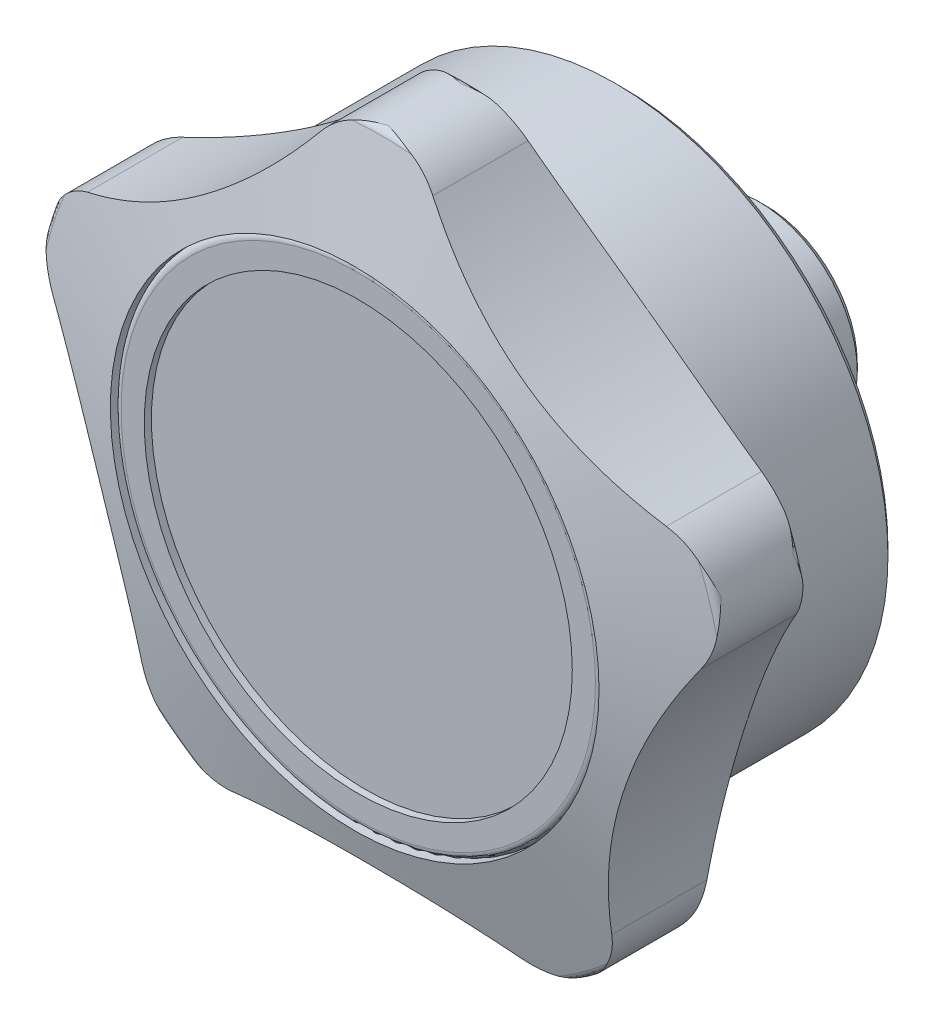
ISO-10303-21;
HEADER;
FILE_DESCRIPTION(('STEP AP214'),'2;1');
FILE_NAME('part.step','',(''),(''),'','','');
FILE_SCHEMA(('AUTOMOTIVE_DESIGN { 1 0 10303 214 1 1 1 1 }'));
ENDSEC;
DATA;
#1=APPLICATION_CONTEXT('core data for automotive mechanical design processes');
#2=APPLICATION_PROTOCOL_DEFINITION('international standard','automotive_design',2000,#1);
#3=PRODUCT_CONTEXT('',#1,'mechanical');
#4=PRODUCT('Part','Part','',(#3));
#5=PRODUCT_RELATED_PRODUCT_CATEGORY('part','',(#4));
#6=PRODUCT_DEFINITION_FORMATION('','',#4);
#7=PRODUCT_DEFINITION_CONTEXT('part definition',#1,'design');
#8=PRODUCT_DEFINITION('design','',#6,#7);
#9=PRODUCT_DEFINITION_SHAPE('','',#8);
#10=(LENGTH_UNIT() NAMED_UNIT(*) SI_UNIT(.MILLI.,.METRE.));
#11=(NAMED_UNIT(*) PLANE_ANGLE_UNIT() SI_UNIT($,.RADIAN.));
#12=(NAMED_UNIT(*) SI_UNIT($,.STERADIAN.) SOLID_ANGLE_UNIT());
#13=UNCERTAINTY_MEASURE_WITH_UNIT(LENGTH_MEASURE(1.E-05),#10,'distance_accuracy_value','');
#14=(GEOMETRIC_REPRESENTATION_CONTEXT(3) GLOBAL_UNCERTAINTY_ASSIGNED_CONTEXT((#13)) GLOBAL_UNIT_ASSIGNED_CONTEXT((#10,
#11,#12)) REPRESENTATION_CONTEXT('',''));
#15=CARTESIAN_POINT('',(0.,0.,0.));
#16=DIRECTION('',(0.,0.,1.));
#17=DIRECTION('',(1.,0.,0.));
#18=AXIS2_PLACEMENT_3D('',#15,#16,#17);
#19=CARTESIAN_POINT('',(0.,0.,56.5000000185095));
#20=DIRECTION('',(0.,0.,1.));
#21=DIRECTION('',(1.,0.,0.));
#22=AXIS2_PLACEMENT_3D('',#19,#20,#21);
#23=TOROIDAL_SURFACE('',#22,33.2501924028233,1.);
#24=CARTESIAN_POINT('',(0.,0.,56.5196155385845));
#25=DIRECTION('',(0.,0.,1.));
#26=DIRECTION('',(1.,0.,0.));
#27=AXIS2_PLACEMENT_3D('',#24,#25,#26);
#28=CIRCLE('',#27,34.25);
#29=CARTESIAN_POINT('',(34.25,0.,56.5196155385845));
#30=VERTEX_POINT('',#29);
#31=EDGE_CURVE('E25',#30,#30,#28,.T.);
#32=ORIENTED_EDGE('',*,*,#31,.T.);
#33=EDGE_LOOP('',(#32));
#34=FACE_BOUND('',#33,.T.);
#35=CARTESIAN_POINT('',(0.,0.,57.5));
#36=DIRECTION('',(0.,0.,1.));
#37=DIRECTION('',(1.,0.,0.));
#38=AXIS2_PLACEMENT_3D('',#35,#36,#37);
#39=CIRCLE('',#38,33.25);
#40=CARTESIAN_POINT('',(33.25,0.,57.5));
#41=VERTEX_POINT('',#40);
#42=EDGE_CURVE('E945',#41,#41,#39,.T.);
#43=ORIENTED_EDGE('',*,*,#42,.F.);
#44=EDGE_LOOP('',(#43));
#45=FACE_BOUND('',#44,.T.);
#46=ADVANCED_FACE('F15',(#34,#45),#23,.T.);
#47=CARTESIAN_POINT('',(0.,-33.25,57.5));
#48=DIRECTION('',(0.,0.,-1.));
#49=DIRECTION('',(-1.,0.,0.));
#50=AXIS2_PLACEMENT_3D('',#47,#48,#49);
#51=PLANE('',#50);
#52=CARTESIAN_POINT('',(0.,0.,57.5));
#53=DIRECTION('',(0.,0.,1.));
#54=DIRECTION('',(1.,0.,0.));
#55=AXIS2_PLACEMENT_3D('',#52,#53,#54);
#56=CIRCLE('',#55,30.);
#57=CARTESIAN_POINT('',(30.,0.,57.5));
#58=VERTEX_POINT('',#57);
#59=EDGE_CURVE('E938',#58,#58,#56,.T.);
#60=ORIENTED_EDGE('',*,*,#59,.F.);
#61=EDGE_LOOP('',(#60));
#62=FACE_BOUND('',#61,.T.);
#63=ORIENTED_EDGE('',*,*,#42,.T.);
#64=EDGE_LOOP('',(#63));
#65=FACE_BOUND('',#64,.T.);
#66=ADVANCED_FACE('F866',(#62,#65),#51,.F.);
#67=CARTESIAN_POINT('',(0.,0.,56.5));
#68=DIRECTION('',(0.,0.,1.));
#69=DIRECTION('',(1.,0.,0.));
#70=AXIS2_PLACEMENT_3D('',#67,#68,#69);
#71=CYLINDRICAL_SURFACE('',#70,30.);
#72=CARTESIAN_POINT('',(0.,0.,56.5));
#73=DIRECTION('',(0.,0.,1.));
#74=DIRECTION('',(1.,0.,0.));
#75=AXIS2_PLACEMENT_3D('',#72,#73,#74);
#76=CIRCLE('',#75,30.);
#77=CARTESIAN_POINT('',(30.,0.,56.5));
#78=VERTEX_POINT('',#77);
#79=EDGE_CURVE('E940',#78,#78,#76,.T.);
#80=ORIENTED_EDGE('',*,*,#79,.F.);
#81=EDGE_LOOP('',(#80));
#82=FACE_BOUND('',#81,.T.);
#83=ORIENTED_EDGE('',*,*,#59,.T.);
#84=EDGE_LOOP('',(#83));
#85=FACE_BOUND('',#84,.T.);
#86=ADVANCED_FACE('F873',(#82,#85),#71,.F.);
#87=CARTESIAN_POINT('',(0.,0.,56.5));
#88=DIRECTION('',(0.,0.,1.));
#89=DIRECTION('',(1.,0.,0.));
#90=AXIS2_PLACEMENT_3D('',#87,#88,#89);
#91=PLANE('',#90);
#92=ORIENTED_EDGE('',*,*,#79,.T.);
#93=EDGE_LOOP('',(#92));
#94=FACE_BOUND('',#93,.T.);
#95=ADVANCED_FACE('F876',(#94),#91,.T.);
#96=CARTESIAN_POINT('',(0.,6.,8.0095));
#97=DIRECTION('',(0.,1.,0.));
#98=DIRECTION('',(-1.,0.,0.));
#99=AXIS2_PLACEMENT_3D('',#96,#97,#98);
#100=PLANE('',#99);
#101=CARTESIAN_POINT('',(0.,6.,6.));
#102=DIRECTION('',(0.,-1.,0.));
#103=DIRECTION('',(1.,0.,0.));
#104=AXIS2_PLACEMENT_3D('',#101,#102,#103);
#105=CIRCLE('',#104,2.0095);
#106=CARTESIAN_POINT('',(2.0095,6.,6.));
#107=VERTEX_POINT('',#106);
#108=EDGE_CURVE('E232',#107,#107,#105,.T.);
#109=ORIENTED_EDGE('',*,*,#108,.T.);
#110=EDGE_LOOP('',(#109));
#111=FACE_BOUND('',#110,.T.);
#112=ADVANCED_FACE('F862',(#111),#100,.F.);
#113=CARTESIAN_POINT('',(0.,6.4905,6.));
#114=DIRECTION('',(0.,1.,0.));
#115=DIRECTION('',(-1.,0.,0.));
#116=AXIS2_PLACEMENT_3D('',#113,#114,#115);
#117=CONICAL_SURFACE('',#116,2.5,0.785398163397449);
#118=ORIENTED_EDGE('',*,*,#108,.F.);
#119=EDGE_LOOP('',(#118));
#120=FACE_BOUND('',#119,.T.);
#121=CARTESIAN_POINT('',(0.,6.4905,6.));
#122=DIRECTION('',(0.,-1.,0.));
#123=DIRECTION('',(1.,0.,0.));
#124=AXIS2_PLACEMENT_3D('',#121,#122,#123);
#125=CIRCLE('',#124,2.5);
#126=CARTESIAN_POINT('',(2.5,6.4905,6.));
#127=VERTEX_POINT('',#126);
#128=EDGE_CURVE('E281',#127,#127,#125,.T.);
#129=ORIENTED_EDGE('',*,*,#128,.T.);
#130=EDGE_LOOP('',(#129));
#131=FACE_BOUND('',#130,.T.);
#132=ADVANCED_FACE('F886',(#120,#131),#117,.T.);
#133=CARTESIAN_POINT('',(0.,0.,22.));
#134=DIRECTION('',(0.,0.,1.));
#135=DIRECTION('',(1.,0.,0.));
#136=AXIS2_PLACEMENT_3D('',#133,#134,#135);
#137=PLANE('',#136);
#138=CARTESIAN_POINT('',(0.,0.,22.));
#139=DIRECTION('',(0.,0.,1.));
#140=DIRECTION('',(1.,0.,0.));
#141=AXIS2_PLACEMENT_3D('',#138,#139,#140);
#142=CIRCLE('',#141,6.);
#143=CARTESIAN_POINT('',(6.,0.,22.));
#144=VERTEX_POINT('',#143);
#145=EDGE_CURVE('E253',#144,#144,#142,.T.);
#146=ORIENTED_EDGE('',*,*,#145,.F.);
#147=EDGE_LOOP('',(#146));
#148=FACE_BOUND('',#147,.T.);
#149=ADVANCED_FACE('F883',(#148),#137,.F.);
#150=CARTESIAN_POINT('',(0.,5.,6.));
#151=DIRECTION('',(0.,-1.,0.));
#152=DIRECTION('',(1.,0.,0.));
#153=AXIS2_PLACEMENT_3D('',#150,#151,#152);
#154=CYLINDRICAL_SURFACE('',#153,2.5);
#155=CARTESIAN_POINT('',(2.5,5.45435605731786,6.));
#156=CARTESIAN_POINT('',(2.49999850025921,5.45435734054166,5.9332918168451));
#157=CARTESIAN_POINT('',(2.49732449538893,5.4555854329,5.86656520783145));
#158=CARTESIAN_POINT('',(2.48666416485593,5.460451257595,5.73361352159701));
#159=CARTESIAN_POINT('',(2.47867468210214,5.46409042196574,5.6673887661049));
#160=CARTESIAN_POINT('',(2.44679265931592,5.47848490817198,5.46994813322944));
#161=CARTESIAN_POINT('',(2.41498683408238,5.49271671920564,5.34016318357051));
#162=CARTESIAN_POINT('',(2.33180001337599,5.52853615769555,5.08884523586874));
#163=CARTESIAN_POINT('',(2.28049881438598,5.55009376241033,4.96728094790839));
#164=CARTESIAN_POINT('',(2.16001268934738,5.59808356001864,4.73448982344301));
#165=CARTESIAN_POINT('',(2.09083199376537,5.62451459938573,4.62326055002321));
#166=CARTESIAN_POINT('',(1.93194778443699,5.6811150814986,4.40734601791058));
#167=CARTESIAN_POINT('',(1.84130648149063,5.71141131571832,4.30338420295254));
#168=CARTESIAN_POINT('',(1.64404334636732,5.77128595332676,4.11160023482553));
#169=CARTESIAN_POINT('',(1.53741538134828,5.80086407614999,4.02378430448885));
#170=CARTESIAN_POINT('',(1.30552678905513,5.8575107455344,3.86310074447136));
#171=CARTESIAN_POINT('',(1.17965858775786,5.88441479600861,3.79104669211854));
#172=CARTESIAN_POINT('',(0.916264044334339,5.93113040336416,3.66944801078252));
#173=CARTESIAN_POINT('',(0.778742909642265,5.95094510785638,3.61989338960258));
#174=CARTESIAN_POINT('',(0.503536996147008,5.98035041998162,3.54732106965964));
#175=CARTESIAN_POINT('',(0.36623315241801,5.99041942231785,3.52305660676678));
#176=CARTESIAN_POINT('',(0.0891583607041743,6.00093657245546,3.49772472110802));
#177=CARTESIAN_POINT('',(-0.0506115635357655,6.00138862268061,3.49664788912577));
#178=CARTESIAN_POINT('',(-0.319585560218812,5.99290258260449,3.51706856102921));
#179=CARTESIAN_POINT('',(-0.448914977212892,5.98453429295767,3.53719620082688));
#180=CARTESIAN_POINT('',(-0.702165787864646,5.96013033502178,3.59710620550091));
#181=CARTESIAN_POINT('',(-0.826086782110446,5.94409410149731,3.63689001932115));
#182=CARTESIAN_POINT('',(-1.06727623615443,5.90559704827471,3.73545608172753));
#183=CARTESIAN_POINT('',(-1.18441435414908,5.88304194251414,3.79451892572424));
#184=CARTESIAN_POINT('',(-1.40742353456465,5.83371427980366,3.9296915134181));
#185=CARTESIAN_POINT('',(-1.51329059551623,5.80694023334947,4.00580728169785));
#186=CARTESIAN_POINT('',(-1.7186818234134,5.74963397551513,4.1791648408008));
#187=CARTESIAN_POINT('',(-1.81723287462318,5.71896988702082,4.27751758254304));
#188=CARTESIAN_POINT('',(-1.99686282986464,5.65875721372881,4.48942288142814));
#189=CARTESIAN_POINT('',(-2.0779349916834,5.62920906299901,4.60298127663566));
#190=CARTESIAN_POINT('',(-2.22280378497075,5.57363224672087,4.84679007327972));
#191=CARTESIAN_POINT('',(-2.28594506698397,5.54775116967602,4.9774664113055));
#192=CARTESIAN_POINT('',(-2.38892864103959,5.50419688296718,5.24896208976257));
#193=CARTESIAN_POINT('',(-2.42878759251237,5.48651780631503,5.38977409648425));
#194=CARTESIAN_POINT('',(-2.48160050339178,5.46282425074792,5.667793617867));
#195=CARTESIAN_POINT('',(-2.49613229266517,5.45612738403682,5.80464224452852));
#196=CARTESIAN_POINT('',(-2.50251261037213,5.45320573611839,6.07895696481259));
#197=CARTESIAN_POINT('',(-2.49436898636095,5.45697733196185,6.21642282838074));
#198=CARTESIAN_POINT('',(-2.45706955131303,5.47386262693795,6.4787967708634));
#199=CARTESIAN_POINT('',(-2.42929237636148,5.48636276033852,6.60394537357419));
#200=CARTESIAN_POINT('',(-2.355341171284,5.51851260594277,6.84770259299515));
#201=CARTESIAN_POINT('',(-2.30916284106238,5.53816398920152,6.96630967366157));
#202=CARTESIAN_POINT('',(-2.19755041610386,5.58341595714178,7.19923062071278));
#203=CARTESIAN_POINT('',(-2.13138366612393,5.60923324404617,7.31314994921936));
#204=CARTESIAN_POINT('',(-1.98240156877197,5.66360007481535,7.52881610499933));
#205=CARTESIAN_POINT('',(-1.89957901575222,5.69215079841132,7.63055763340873));
#206=CARTESIAN_POINT('',(-1.71168891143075,5.75157239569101,7.82760026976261));
#207=CARTESIAN_POINT('',(-1.6053593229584,5.78244293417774,7.92170279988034));
#208=CARTESIAN_POINT('',(-1.37770302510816,5.84086722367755,8.09094458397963));
#209=CARTESIAN_POINT('',(-1.25637521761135,5.86842073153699,8.16608244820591));
#210=CARTESIAN_POINT('',(-1.00130936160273,5.91728503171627,8.29517975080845));
#211=CARTESIAN_POINT('',(-0.867540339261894,5.93857966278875,8.34908448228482));
#212=CARTESIAN_POINT('',(-0.591717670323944,5.9723634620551,8.43323358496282));
#213=CARTESIAN_POINT('',(-0.449669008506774,5.98485787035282,8.46349203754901));
#214=CARTESIAN_POINT('',(-0.172033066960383,5.9990306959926,8.49771625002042));
#215=CARTESIAN_POINT('',(-0.0366881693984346,6.0014040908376,8.50337199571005));
#216=CARTESIAN_POINT('',(0.232973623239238,5.99699046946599,8.49277372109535));
#217=CARTESIAN_POINT('',(0.367290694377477,5.99020505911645,8.47652354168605));
#218=CARTESIAN_POINT('',(0.626172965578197,5.9686013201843,8.4237878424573));
#219=CARTESIAN_POINT('',(0.750915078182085,5.95407648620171,8.38804059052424));
#220=CARTESIAN_POINT('',(0.992584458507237,5.91858999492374,8.29813155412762));
#221=CARTESIAN_POINT('',(1.1095102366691,5.89762711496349,8.24396627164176));
#222=CARTESIAN_POINT('',(1.33804914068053,5.85011651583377,8.11602075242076));
#223=CARTESIAN_POINT('',(1.44918335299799,5.82335921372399,8.04146467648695));
#224=CARTESIAN_POINT('',(1.65783731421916,5.7674312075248,7.87598635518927));
#225=CARTESIAN_POINT('',(1.75535198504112,5.73825960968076,7.78505803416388));
#226=CARTESIAN_POINT('',(1.9408997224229,5.67829702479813,7.58210746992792));
#227=CARTESIAN_POINT('',(2.02783607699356,5.64753091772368,7.46907088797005));
#228=CARTESIAN_POINT('',(2.18166607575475,5.5899105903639,7.22909360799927));
#229=CARTESIAN_POINT('',(2.24854851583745,5.56305856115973,7.10214519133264));
#230=CARTESIAN_POINT('',(2.35965744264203,5.51685287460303,6.83807106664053));
#231=CARTESIAN_POINT('',(2.40400437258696,5.49745949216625,6.70100404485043));
#232=CARTESIAN_POINT('',(2.45239925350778,5.47594959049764,6.49083623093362));
#233=CARTESIAN_POINT('',(2.46550603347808,5.47004503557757,6.42008940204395));
#234=CARTESIAN_POINT('',(2.48558130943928,5.46095373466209,6.27757394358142));
#235=CARTESIAN_POINT('',(2.49255414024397,5.45776506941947,6.20580607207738));
#236=CARTESIAN_POINT('',(2.49880479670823,5.45490391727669,6.08928839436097));
#237=CARTESIAN_POINT('',(2.50000100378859,5.45435519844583,6.0446483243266));
#238=CARTESIAN_POINT('',(2.5,5.45435605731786,6.));
#239=B_SPLINE_CURVE_WITH_KNOTS('',3,(#155,#156,#157,#158,#159,#160,#161,#162,#163,#164,#165,
#166,#167,#168,#169,#170,#171,#172,#173,#174,#175,#176,#177,#178,#179,#180,#181,#182,#183,#184,
#185,#186,#187,#188,#189,#190,#191,#192,#193,#194,#195,#196,#197,#198,#199,#200,#201,#202,#203,
#204,#205,#206,#207,#208,#209,#210,#211,#212,#213,#214,#215,#216,#217,#218,#219,#220,#221,#222,
#223,#224,#225,#226,#227,#228,#229,#230,#231,#232,#233,#234,#235,#236,#237,#238),.UNSPECIFIED.,
.T.,.F.,(4,2,2,2,2,2,2,2,2,2,2,2,2,2,2,2,2,2,2,2,2,2,2,2,2,2,2,2,2,2,2,2,2,2,2,2,2,2,2,2,2,4),
(0.,0.200084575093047,0.400288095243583,0.801278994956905,1.20064597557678,1.59991854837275,
2.02172149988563,2.44368668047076,2.88395420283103,3.32402600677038,3.7411967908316,
4.15819828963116,4.54982147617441,4.94147353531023,5.33910096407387,5.73686909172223,
6.16267530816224,6.58864548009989,7.02861558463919,7.46827048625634,7.87940023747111,
8.29038772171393,8.6750626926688,9.05982760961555,9.46088720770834,9.86212068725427,
10.2960179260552,10.7299469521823,11.1649867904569,11.5997673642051,12.004157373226,
12.4084764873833,12.7984529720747,13.1885035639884,13.5961819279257,14.0040118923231,
14.4395932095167,14.8754174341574,15.3088871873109,15.5252058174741,15.7413714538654,
15.8752896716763),.UNSPECIFIED.);
#240=CARTESIAN_POINT('',(2.5,5.45435605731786,6.));
#241=VERTEX_POINT('',#240);
#242=EDGE_CURVE('E290',#241,#241,#239,.T.);
#243=ORIENTED_EDGE('',*,*,#242,.F.);
#244=EDGE_LOOP('',(#243));
#245=FACE_BOUND('',#244,.T.);
#246=ORIENTED_EDGE('',*,*,#128,.F.);
#247=EDGE_LOOP('',(#246));
#248=FACE_BOUND('',#247,.T.);
#249=ADVANCED_FACE('F311',(#245,#248),#154,.F.);
#250=CARTESIAN_POINT('',(0.,11.75,0.));
#251=DIRECTION('',(0.,1.,0.));
#252=DIRECTION('',(-1.,0.,0.));
#253=AXIS2_PLACEMENT_3D('',#250,#251,#252);
#254=PLANE('',#253);
#255=DIRECTION('',(-1.,0.,0.));
#256=VECTOR('',#255,1.);
#257=CARTESIAN_POINT('',(0.577350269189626,11.75,5.));
#258=LINE('',#257,#256);
#259=CARTESIAN_POINT('',(0.577350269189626,11.75,5.));
#260=VERTEX_POINT('',#259);
#261=CARTESIAN_POINT('',(-0.577350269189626,11.75,5.));
#262=VERTEX_POINT('',#261);
#263=EDGE_CURVE('E226',#260,#262,#258,.T.);
#264=ORIENTED_EDGE('',*,*,#263,.T.);
#265=DIRECTION('',(-0.5,0.,0.866025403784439));
#266=VECTOR('',#265,1.);
#267=CARTESIAN_POINT('',(-0.577350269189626,11.75,5.));
#268=LINE('',#267,#266);
#269=CARTESIAN_POINT('',(-1.15470053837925,11.75,6.));
#270=VERTEX_POINT('',#269);
#271=EDGE_CURVE('E236',#262,#270,#268,.T.);
#272=ORIENTED_EDGE('',*,*,#271,.T.);
#273=DIRECTION('',(0.5,0.,0.866025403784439));
#274=VECTOR('',#273,1.);
#275=CARTESIAN_POINT('',(-1.15470053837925,11.75,6.));
#276=LINE('',#275,#274);
#277=CARTESIAN_POINT('',(-0.577350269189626,11.75,7.));
#278=VERTEX_POINT('',#277);
#279=EDGE_CURVE('E241',#270,#278,#276,.T.);
#280=ORIENTED_EDGE('',*,*,#279,.T.);
#281=DIRECTION('',(1.,0.,0.));
#282=VECTOR('',#281,1.);
#283=CARTESIAN_POINT('',(-0.577350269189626,11.75,7.));
#284=LINE('',#283,#282);
#285=CARTESIAN_POINT('',(0.577350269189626,11.75,7.));
#286=VERTEX_POINT('',#285);
#287=EDGE_CURVE('E256',#278,#286,#284,.T.);
#288=ORIENTED_EDGE('',*,*,#287,.T.);
#289=DIRECTION('',(0.5,0.,-0.866025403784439));
#290=VECTOR('',#289,1.);
#291=CARTESIAN_POINT('',(0.577350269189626,11.75,7.));
#292=LINE('',#291,#290);
#293=CARTESIAN_POINT('',(1.15470053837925,11.75,6.));
#294=VERTEX_POINT('',#293);
#295=EDGE_CURVE('E259',#286,#294,#292,.T.);
#296=ORIENTED_EDGE('',*,*,#295,.T.);
#297=DIRECTION('',(-0.5,0.,-0.866025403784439));
#298=VECTOR('',#297,1.);
#299=CARTESIAN_POINT('',(1.15470053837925,11.75,6.));
#300=LINE('',#299,#298);
#301=EDGE_CURVE('E247',#294,#260,#300,.T.);
#302=ORIENTED_EDGE('',*,*,#301,.T.);
#303=EDGE_LOOP('',(#264,#272,#280,#288,#296,#302));
#304=FACE_BOUND('',#303,.T.);
#305=ADVANCED_FACE('F244',(#304),#254,.T.);
#306=CARTESIAN_POINT('',(0.,0.,58.));
#307=DIRECTION('',(0.,0.,1.));
#308=DIRECTION('',(1.,0.,0.));
#309=AXIS2_PLACEMENT_3D('',#306,#307,#308);
#310=CYLINDRICAL_SURFACE('',#309,6.);
#311=CARTESIAN_POINT('',(0.,0.,0.));
#312=DIRECTION('',(0.,0.,1.));
#313=DIRECTION('',(1.,0.,0.));
#314=AXIS2_PLACEMENT_3D('',#311,#312,#313);
#315=CIRCLE('',#314,6.);
#316=CARTESIAN_POINT('',(6.,0.,0.));
#317=VERTEX_POINT('',#316);
#318=EDGE_CURVE('E662',#317,#317,#315,.T.);
#319=ORIENTED_EDGE('',*,*,#318,.F.);
#320=EDGE_LOOP('',(#319));
#321=FACE_BOUND('',#320,.T.);
#322=ORIENTED_EDGE('',*,*,#242,.T.);
#323=EDGE_LOOP('',(#322));
#324=FACE_BOUND('',#323,.T.);
#325=ORIENTED_EDGE('',*,*,#145,.T.);
#326=EDGE_LOOP('',(#325));
#327=FACE_BOUND('',#326,.T.);
#328=ADVANCED_FACE('F300',(#321,#324,#327),#310,.F.);
#329=CARTESIAN_POINT('',(-0.577350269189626,11.75,7.));
#330=DIRECTION('',(0.,0.,1.));
#331=DIRECTION('',(1.,0.,0.));
#332=AXIS2_PLACEMENT_3D('',#329,#330,#331);
#333=PLANE('',#332);
#334=DIRECTION('',(0.,1.,0.));
#335=VECTOR('',#334,1.);
#336=CARTESIAN_POINT('',(-0.577350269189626,11.75,7.));
#337=LINE('',#336,#335);
#338=CARTESIAN_POINT('',(-0.577350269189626,13.75,7.));
#339=VERTEX_POINT('',#338);
#340=EDGE_CURVE('E275',#278,#339,#337,.T.);
#341=ORIENTED_EDGE('',*,*,#340,.T.);
#342=DIRECTION('',(-1.,0.,0.));
#343=VECTOR('',#342,1.);
#344=CARTESIAN_POINT('',(0.,13.75,7.));
#345=LINE('',#344,#343);
#346=CARTESIAN_POINT('',(0.577350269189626,13.75,7.));
#347=VERTEX_POINT('',#346);
#348=EDGE_CURVE('E19',#347,#339,#345,.T.);
#349=ORIENTED_EDGE('',*,*,#348,.F.);
#350=DIRECTION('',(0.,1.,0.));
#351=VECTOR('',#350,1.);
#352=CARTESIAN_POINT('',(0.577350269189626,11.75,7.));
#353=LINE('',#352,#351);
#354=EDGE_CURVE('E273',#286,#347,#353,.T.);
#355=ORIENTED_EDGE('',*,*,#354,.F.);
#356=ORIENTED_EDGE('',*,*,#287,.F.);
#357=EDGE_LOOP('',(#341,#349,#355,#356));
#358=FACE_BOUND('',#357,.T.);
#359=ADVANCED_FACE('F897',(#358),#333,.F.);
#360=CARTESIAN_POINT('',(0.577350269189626,11.75,7.));
#361=DIRECTION('',(0.866025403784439,0.,0.5));
#362=DIRECTION('',(0.5,0.,-0.866025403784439));
#363=AXIS2_PLACEMENT_3D('',#360,#361,#362);
#364=PLANE('',#363);
#365=DIRECTION('',(0.5,0.,-0.866025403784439));
#366=VECTOR('',#365,1.);
#367=CARTESIAN_POINT('',(0.577350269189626,13.75,7.));
#368=LINE('',#367,#366);
#369=CARTESIAN_POINT('',(1.15470053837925,13.75,6.));
#370=VERTEX_POINT('',#369);
#371=EDGE_CURVE('E33',#347,#370,#368,.T.);
#372=ORIENTED_EDGE('',*,*,#371,.T.);
#373=DIRECTION('',(0.,1.,0.));
#374=VECTOR('',#373,1.);
#375=CARTESIAN_POINT('',(1.15470053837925,11.75,6.));
#376=LINE('',#375,#374);
#377=EDGE_CURVE('E271',#294,#370,#376,.T.);
#378=ORIENTED_EDGE('',*,*,#377,.F.);
#379=ORIENTED_EDGE('',*,*,#295,.F.);
#380=ORIENTED_EDGE('',*,*,#354,.T.);
#381=EDGE_LOOP('',(#372,#378,#379,#380));
#382=FACE_BOUND('',#381,.T.);
#383=ADVANCED_FACE('F893',(#382),#364,.F.);
#384=CARTESIAN_POINT('',(1.15470053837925,11.75,6.));
#385=DIRECTION('',(0.866025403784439,0.,-0.5));
#386=DIRECTION('',(-0.5,0.,-0.866025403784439));
#387=AXIS2_PLACEMENT_3D('',#384,#385,#386);
#388=PLANE('',#387);
#389=DIRECTION('',(-0.5,0.,-0.866025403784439));
#390=VECTOR('',#389,1.);
#391=CARTESIAN_POINT('',(1.15470053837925,13.75,6.));
#392=LINE('',#391,#390);
#393=CARTESIAN_POINT('',(0.577350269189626,13.75,5.));
#394=VERTEX_POINT('',#393);
#395=EDGE_CURVE('E248',#370,#394,#392,.T.);
#396=ORIENTED_EDGE('',*,*,#395,.T.);
#397=DIRECTION('',(0.,1.,0.));
#398=VECTOR('',#397,1.);
#399=CARTESIAN_POINT('',(0.577350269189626,11.75,5.));
#400=LINE('',#399,#398);
#401=EDGE_CURVE('E262',#260,#394,#400,.T.);
#402=ORIENTED_EDGE('',*,*,#401,.F.);
#403=ORIENTED_EDGE('',*,*,#301,.F.);
#404=ORIENTED_EDGE('',*,*,#377,.T.);
#405=EDGE_LOOP('',(#396,#402,#403,#404));
#406=FACE_BOUND('',#405,.T.);
#407=ADVANCED_FACE('F890',(#406),#388,.F.);
#408=CARTESIAN_POINT('',(0.577350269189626,11.75,5.));
#409=DIRECTION('',(0.,0.,-1.));
#410=DIRECTION('',(-1.,0.,0.));
#411=AXIS2_PLACEMENT_3D('',#408,#409,#410);
#412=PLANE('',#411);
#413=DIRECTION('',(-1.,0.,0.));
#414=VECTOR('',#413,1.);
#415=CARTESIAN_POINT('',(0.577350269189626,13.75,5.));
#416=LINE('',#415,#414);
#417=CARTESIAN_POINT('',(-0.577350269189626,13.75,5.));
#418=VERTEX_POINT('',#417);
#419=EDGE_CURVE('E228',#394,#418,#416,.T.);
#420=ORIENTED_EDGE('',*,*,#419,.T.);
#421=DIRECTION('',(0.,1.,0.));
#422=VECTOR('',#421,1.);
#423=CARTESIAN_POINT('',(-0.577350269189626,11.75,5.));
#424=LINE('',#423,#422);
#425=EDGE_CURVE('E222',#262,#418,#424,.T.);
#426=ORIENTED_EDGE('',*,*,#425,.F.);
#427=ORIENTED_EDGE('',*,*,#263,.F.);
#428=ORIENTED_EDGE('',*,*,#401,.T.);
#429=EDGE_LOOP('',(#420,#426,#427,#428));
#430=FACE_BOUND('',#429,.T.);
#431=ADVANCED_FACE('F224',(#430),#412,.F.);
#432=CARTESIAN_POINT('',(-0.577350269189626,11.75,5.));
#433=DIRECTION('',(-0.866025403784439,0.,-0.5));
#434=DIRECTION('',(-0.5,0.,0.866025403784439));
#435=AXIS2_PLACEMENT_3D('',#432,#433,#434);
#436=PLANE('',#435);
#437=DIRECTION('',(-0.5,0.,0.866025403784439));
#438=VECTOR('',#437,1.);
#439=CARTESIAN_POINT('',(-0.577350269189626,13.75,5.));
#440=LINE('',#439,#438);
#441=CARTESIAN_POINT('',(-1.15470053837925,13.75,6.));
#442=VERTEX_POINT('',#441);
#443=EDGE_CURVE('E264',#418,#442,#440,.T.);
#444=ORIENTED_EDGE('',*,*,#443,.T.);
#445=DIRECTION('',(0.,1.,0.));
#446=VECTOR('',#445,1.);
#447=CARTESIAN_POINT('',(-1.15470053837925,11.75,6.));
#448=LINE('',#447,#446);
#449=EDGE_CURVE('E233',#270,#442,#448,.T.);
#450=ORIENTED_EDGE('',*,*,#449,.F.);
#451=ORIENTED_EDGE('',*,*,#271,.F.);
#452=ORIENTED_EDGE('',*,*,#425,.T.);
#453=EDGE_LOOP('',(#444,#450,#451,#452));
#454=FACE_BOUND('',#453,.T.);
#455=ADVANCED_FACE('F237',(#454),#436,.F.);
#456=CARTESIAN_POINT('',(-1.15470053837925,11.75,6.));
#457=DIRECTION('',(-0.866025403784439,0.,0.5));
#458=DIRECTION('',(0.5,0.,0.866025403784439));
#459=AXIS2_PLACEMENT_3D('',#456,#457,#458);
#460=PLANE('',#459);
#461=DIRECTION('',(0.5,0.,0.866025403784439));
#462=VECTOR('',#461,1.);
#463=CARTESIAN_POINT('',(-1.15470053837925,13.75,6.));
#464=LINE('',#463,#462);
#465=EDGE_CURVE('E266',#442,#339,#464,.T.);
#466=ORIENTED_EDGE('',*,*,#465,.T.);
#467=ORIENTED_EDGE('',*,*,#340,.F.);
#468=ORIENTED_EDGE('',*,*,#279,.F.);
#469=ORIENTED_EDGE('',*,*,#449,.T.);
#470=EDGE_LOOP('',(#466,#467,#468,#469));
#471=FACE_BOUND('',#470,.T.);
#472=ADVANCED_FACE('F901',(#471),#460,.F.);
#473=CARTESIAN_POINT('',(0.,11.,0.));
#474=DIRECTION('',(0.,0.,-1.));
#475=DIRECTION('',(-1.,0.,0.));
#476=AXIS2_PLACEMENT_3D('',#473,#474,#475);
#477=PLANE('',#476);
#478=ORIENTED_EDGE('',*,*,#318,.T.);
#479=EDGE_LOOP('',(#478));
#480=FACE_BOUND('',#479,.T.);
#481=CARTESIAN_POINT('',(0.,0.,0.));
#482=DIRECTION('',(0.,0.,1.));
#483=DIRECTION('',(1.,0.,0.));
#484=AXIS2_PLACEMENT_3D('',#481,#482,#483);
#485=CIRCLE('',#484,11.);
#486=CARTESIAN_POINT('',(11.,0.,0.));
#487=VERTEX_POINT('',#486);
#488=EDGE_CURVE('E617',#487,#487,#485,.T.);
#489=ORIENTED_EDGE('',*,*,#488,.F.);
#490=EDGE_LOOP('',(#489));
#491=FACE_BOUND('',#490,.T.);
#492=ADVANCED_FACE('F17',(#480,#491),#477,.T.);
#493=CARTESIAN_POINT('',(0.,13.75,6.));
#494=DIRECTION('',(0.,-1.,0.));
#495=DIRECTION('',(1.,0.,0.));
#496=AXIS2_PLACEMENT_3D('',#493,#494,#495);
#497=PLANE('',#496);
#498=CARTESIAN_POINT('',(0.,13.75,6.));
#499=DIRECTION('',(0.,-1.,0.));
#500=DIRECTION('',(1.,0.,0.));
#501=AXIS2_PLACEMENT_3D('',#498,#499,#500);
#502=CIRCLE('',#501,2.0095);
#503=CARTESIAN_POINT('',(2.0095,13.75,6.));
#504=VERTEX_POINT('',#503);
#505=EDGE_CURVE('E287',#504,#504,#502,.T.);
#506=ORIENTED_EDGE('',*,*,#505,.F.);
#507=EDGE_LOOP('',(#506));
#508=FACE_BOUND('',#507,.T.);
#509=ORIENTED_EDGE('',*,*,#465,.F.);
#510=ORIENTED_EDGE('',*,*,#443,.F.);
#511=ORIENTED_EDGE('',*,*,#419,.F.);
#512=ORIENTED_EDGE('',*,*,#395,.F.);
#513=ORIENTED_EDGE('',*,*,#371,.F.);
#514=ORIENTED_EDGE('',*,*,#348,.T.);
#515=EDGE_LOOP('',(#509,#510,#511,#512,#513,#514));
#516=FACE_BOUND('',#515,.T.);
#517=ADVANCED_FACE('F312',(#508,#516),#497,.F.);
#518=CARTESIAN_POINT('',(0.,0.,58.));
#519=DIRECTION('',(0.,0.,1.));
#520=DIRECTION('',(1.,0.,0.));
#521=AXIS2_PLACEMENT_3D('',#518,#519,#520);
#522=CYLINDRICAL_SURFACE('',#521,11.);
#523=ORIENTED_EDGE('',*,*,#488,.T.);
#524=EDGE_LOOP('',(#523));
#525=FACE_BOUND('',#524,.T.);
#526=CARTESIAN_POINT('',(0.,0.,0.3));
#527=DIRECTION('',(0.,0.,1.));
#528=DIRECTION('',(1.,0.,0.));
#529=AXIS2_PLACEMENT_3D('',#526,#527,#528);
#530=CIRCLE('',#529,11.);
#531=CARTESIAN_POINT('',(11.,0.,0.3));
#532=VERTEX_POINT('',#531);
#533=EDGE_CURVE('E620',#532,#532,#530,.T.);
#534=ORIENTED_EDGE('',*,*,#533,.F.);
#535=EDGE_LOOP('',(#534));
#536=FACE_BOUND('',#535,.T.);
#537=ADVANCED_FACE('F596',(#525,#536),#522,.T.);
#538=CARTESIAN_POINT('',(0.,13.75,6.));
#539=DIRECTION('',(0.,-1.,0.));
#540=DIRECTION('',(1.,0.,0.));
#541=AXIS2_PLACEMENT_3D('',#538,#539,#540);
#542=CONICAL_SURFACE('',#541,2.0095,0.785398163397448);
#543=CARTESIAN_POINT('',(0.,13.2595,6.));
#544=DIRECTION('',(0.,-1.,0.));
#545=DIRECTION('',(1.,0.,0.));
#546=AXIS2_PLACEMENT_3D('',#543,#544,#545);
#547=CIRCLE('',#546,2.5);
#548=CARTESIAN_POINT('',(2.5,13.2595,6.));
#549=VERTEX_POINT('',#548);
#550=EDGE_CURVE('E284',#549,#549,#547,.T.);
#551=ORIENTED_EDGE('',*,*,#550,.F.);
#552=EDGE_LOOP('',(#551));
#553=FACE_BOUND('',#552,.T.);
#554=ORIENTED_EDGE('',*,*,#505,.T.);
#555=EDGE_LOOP('',(#554));
#556=FACE_BOUND('',#555,.T.);
#557=ADVANCED_FACE('F909',(#553,#556),#542,.T.);
#558=CARTESIAN_POINT('',(0.,12.75,0.3));
#559=DIRECTION('',(0.,0.,-1.));
#560=DIRECTION('',(-1.,0.,0.));
#561=AXIS2_PLACEMENT_3D('',#558,#559,#560);
#562=PLANE('',#561);
#563=ORIENTED_EDGE('',*,*,#533,.T.);
#564=EDGE_LOOP('',(#563));
#565=FACE_BOUND('',#564,.T.);
#566=CARTESIAN_POINT('',(0.,0.,0.3));
#567=DIRECTION('',(0.,0.,1.));
#568=DIRECTION('',(1.,0.,0.));
#569=AXIS2_PLACEMENT_3D('',#566,#567,#568);
#570=CIRCLE('',#569,12.75);
#571=CARTESIAN_POINT('',(12.75,0.,0.3));
#572=VERTEX_POINT('',#571);
#573=EDGE_CURVE('E623',#572,#572,#570,.T.);
#574=ORIENTED_EDGE('',*,*,#573,.F.);
#575=EDGE_LOOP('',(#574));
#576=FACE_BOUND('',#575,.T.);
#577=ADVANCED_FACE('F309',(#565,#576),#562,.T.);
#578=ORIENTED_EDGE('',*,*,#550,.T.);
#579=EDGE_LOOP('',(#578));
#580=FACE_BOUND('',#579,.T.);
#581=CARTESIAN_POINT('',(0.,13.75,8.5));
#582=CARTESIAN_POINT('',(-0.139196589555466,13.7499975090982,8.49999460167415));
#583=CARTESIAN_POINT('',(-0.278464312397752,13.7478644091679,8.48833530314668));
#584=CARTESIAN_POINT('',(-0.553080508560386,13.7395605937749,8.44203316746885));
#585=CARTESIAN_POINT('',(-0.688425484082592,13.7333863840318,8.40737043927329));
#586=CARTESIAN_POINT('',(-0.951184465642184,13.7176915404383,8.31615358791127));
#587=CARTESIAN_POINT('',(-1.07860532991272,13.708173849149,8.2596187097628));
#588=CARTESIAN_POINT('',(-1.32214000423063,13.6868333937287,8.12631583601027));
#589=CARTESIAN_POINT('',(-1.43825483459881,13.6750108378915,8.04954966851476));
#590=CARTESIAN_POINT('',(-1.65720555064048,13.6502179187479,7.87704261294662));
#591=CARTESIAN_POINT('',(-1.75989528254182,13.6372371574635,7.78111769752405));
#592=CARTESIAN_POINT('',(-1.94781696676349,13.6116686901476,7.57341205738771));
#593=CARTESIAN_POINT('',(-2.03304770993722,13.5990810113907,7.46163023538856));
#594=CARTESIAN_POINT('',(-2.18423368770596,13.5756230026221,7.22435908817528));
#595=CARTESIAN_POINT('',(-2.25004141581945,13.5647660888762,7.09877433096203));
#596=CARTESIAN_POINT('',(-2.35956933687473,13.5461447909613,6.83810168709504));
#597=CARTESIAN_POINT('',(-2.40329131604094,13.5383801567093,6.70301456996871));
#598=CARTESIAN_POINT('',(-2.46693997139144,13.5269269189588,6.42873168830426));
#599=CARTESIAN_POINT('',(-2.48712083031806,13.5231948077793,6.28959676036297));
#600=CARTESIAN_POINT('',(-2.50390310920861,13.5200978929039,6.00986949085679));
#601=CARTESIAN_POINT('',(-2.50050651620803,13.5207327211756,5.86927727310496));
#602=CARTESIAN_POINT('',(-2.4704366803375,13.5262583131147,5.59246010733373));
#603=CARTESIAN_POINT('',(-2.4440514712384,13.5310964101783,5.45620266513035));
#604=CARTESIAN_POINT('',(-2.36920654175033,13.5444007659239,5.19008122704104));
#605=CARTESIAN_POINT('',(-2.32074593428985,13.552867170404,5.06021748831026));
#606=CARTESIAN_POINT('',(-2.20284122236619,13.5725297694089,4.80972151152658));
#607=CARTESIAN_POINT('',(-2.13327987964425,13.5837411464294,4.68914569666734));
#608=CARTESIAN_POINT('',(-1.97523129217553,13.6076202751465,4.46126907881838));
#609=CARTESIAN_POINT('',(-1.8867422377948,13.6202881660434,4.3539695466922));
#610=CARTESIAN_POINT('',(-1.6917924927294,13.6458830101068,4.15402625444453));
#611=CARTESIAN_POINT('',(-1.58508521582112,13.6588110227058,4.06162288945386));
#612=CARTESIAN_POINT('',(-1.35755567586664,13.6832968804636,3.89599358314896));
#613=CARTESIAN_POINT('',(-1.2367332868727,13.6948547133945,3.82276781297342));
#614=CARTESIAN_POINT('',(-0.984159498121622,13.7153192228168,3.69754076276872));
#615=CARTESIAN_POINT('',(-0.852395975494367,13.7242229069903,3.64556341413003));
#616=CARTESIAN_POINT('',(-0.581810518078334,13.738352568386,3.56454600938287));
#617=CARTESIAN_POINT('',(-0.442989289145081,13.7435789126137,3.53550366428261));
#618=CARTESIAN_POINT('',(-0.164298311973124,13.7497149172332,3.5015127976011));
#619=CARTESIAN_POINT('',(-0.0244700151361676,13.7506836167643,3.4962347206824));
#620=CARTESIAN_POINT('',(0.254071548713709,13.7483578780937,3.50903974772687));
#621=CARTESIAN_POINT('',(0.392784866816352,13.7450636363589,3.52712177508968));
#622=CARTESIAN_POINT('',(0.664121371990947,13.7346188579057,3.58585968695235));
#623=CARTESIAN_POINT('',(0.796781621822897,13.727496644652,3.62634983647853));
#624=CARTESIAN_POINT('',(1.05343089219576,13.7101911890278,3.72857603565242));
#625=CARTESIAN_POINT('',(1.17741935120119,13.7000077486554,3.79031345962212));
#626=CARTESIAN_POINT('',(1.41461905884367,13.6775622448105,3.93401829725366));
#627=CARTESIAN_POINT('',(1.5277055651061,13.6652797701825,4.01618835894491));
#628=CARTESIAN_POINT('',(1.73860267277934,13.6400536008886,4.19815047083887));
#629=CARTESIAN_POINT('',(1.83641193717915,13.6271098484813,4.29794406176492));
#630=CARTESIAN_POINT('',(2.01522172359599,13.6018254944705,4.51380860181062));
#631=CARTESIAN_POINT('',(2.09599795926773,13.5894944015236,4.63006663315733));
#632=CARTESIAN_POINT('',(2.23687483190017,13.5670188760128,4.87469522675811));
#633=CARTESIAN_POINT('',(2.29697620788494,13.5568743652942,5.00306535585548));
#634=CARTESIAN_POINT('',(2.39447431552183,13.5399943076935,5.26768843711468));
#635=CARTESIAN_POINT('',(2.431976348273,13.5332429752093,5.40390153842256));
#636=CARTESIAN_POINT('',(2.48353800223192,13.5238765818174,5.68082873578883));
#637=CARTESIAN_POINT('',(2.49760009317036,13.521261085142,5.82154235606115));
#638=CARTESIAN_POINT('',(2.5018039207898,13.5204836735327,6.10123171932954));
#639=CARTESIAN_POINT('',(2.49229921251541,13.5222559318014,6.24020208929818));
#640=CARTESIAN_POINT('',(2.45041058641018,13.5299088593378,6.51452954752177));
#641=CARTESIAN_POINT('',(2.41802678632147,13.5357895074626,6.64988665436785));
#642=CARTESIAN_POINT('',(2.33144458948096,13.5509696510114,6.91297024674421));
#643=CARTESIAN_POINT('',(2.2772822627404,13.5602634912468,7.04070895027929));
#644=CARTESIAN_POINT('',(2.14871842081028,13.5812272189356,7.28534305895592));
#645=CARTESIAN_POINT('',(2.07431559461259,13.5928972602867,7.40223776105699));
#646=CARTESIAN_POINT('',(1.90614429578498,13.6175040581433,7.62364109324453));
#647=CARTESIAN_POINT('',(1.81211769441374,13.6304563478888,7.72795196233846));
#648=CARTESIAN_POINT('',(1.60790814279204,13.6560499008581,7.91943385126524));
#649=CARTESIAN_POINT('',(1.49772148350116,13.6686910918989,8.00660092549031));
#650=CARTESIAN_POINT('',(1.26321398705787,13.6923621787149,8.16200037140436));
#651=CARTESIAN_POINT('',(1.13878231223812,13.7033776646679,8.23006773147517));
#652=CARTESIAN_POINT('',(0.88009238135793,13.7224157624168,8.34422402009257));
#653=CARTESIAN_POINT('',(0.745843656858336,13.7304412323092,8.39033394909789));
#654=CARTESIAN_POINT('',(0.509302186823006,13.7409258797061,8.44971928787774));
#655=CARTESIAN_POINT('',(0.408406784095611,13.7443097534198,8.46854291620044));
#656=CARTESIAN_POINT('',(0.205020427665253,13.748847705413,8.49368511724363));
#657=CARTESIAN_POINT('',(0.102529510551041,13.75000183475,8.50000397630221));
#658=CARTESIAN_POINT('',(0.,13.75,8.5));
#659=B_SPLINE_CURVE_WITH_KNOTS('',3,(#581,#582,#583,#584,#585,#586,#587,#588,#589,#590,#591,
#592,#593,#594,#595,#596,#597,#598,#599,#600,#601,#602,#603,#604,#605,#606,#607,#608,#609,#610,
#611,#612,#613,#614,#615,#616,#617,#618,#619,#620,#621,#622,#623,#624,#625,#626,#627,#628,#629,
#630,#631,#632,#633,#634,#635,#636,#637,#638,#639,#640,#641,#642,#643,#644,#645,#646,#647,#648,
#649,#650,#651,#652,#653,#654,#655,#656,#657,#658),.UNSPECIFIED.,.T.,.F.,(4,2,2,2,2,2,2,2,2,2,2,
2,2,2,2,2,2,2,2,2,2,2,2,2,2,2,2,2,2,2,2,2,2,2,2,2,2,2,4),(0.,0.417214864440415,
0.834790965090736,1.25200047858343,1.66917230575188,2.09056268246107,2.51198223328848,
2.93652440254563,3.36103223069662,3.78091276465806,4.20075791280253,4.61541709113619,
5.03009293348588,5.44711633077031,5.86417961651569,6.2874151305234,6.71065442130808,
7.13436908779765,7.55804146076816,7.97582001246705,8.39357931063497,8.80828929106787,
9.22302610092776,9.64205283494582,10.0611162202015,10.4853938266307,10.9096562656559,
11.331926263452,11.754151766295,12.1700813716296,12.5860088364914,13.001250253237,
13.4165185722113,13.8376389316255,14.2588560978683,14.6836075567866,15.1079519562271,
15.4152713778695,15.7225837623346),.UNSPECIFIED.);
#660=CARTESIAN_POINT('',(0.,13.75,8.5));
#661=VERTEX_POINT('',#660);
#662=EDGE_CURVE('E318',#661,#661,#659,.T.);
#663=ORIENTED_EDGE('',*,*,#662,.F.);
#664=EDGE_LOOP('',(#663));
#665=FACE_BOUND('',#664,.T.);
#666=ADVANCED_FACE('F303',(#580,#665),#154,.F.);
#667=CARTESIAN_POINT('',(0.,0.,1.3));
#668=DIRECTION('',(0.,0.,1.));
#669=DIRECTION('',(1.,0.,0.));
#670=AXIS2_PLACEMENT_3D('',#667,#668,#669);
#671=CONICAL_SURFACE('',#670,13.75,0.785398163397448);
#672=ORIENTED_EDGE('',*,*,#573,.T.);
#673=EDGE_LOOP('',(#672));
#674=FACE_BOUND('',#673,.T.);
#675=CARTESIAN_POINT('',(0.,0.,1.3));
#676=DIRECTION('',(0.,0.,1.));
#677=DIRECTION('',(1.,0.,0.));
#678=AXIS2_PLACEMENT_3D('',#675,#676,#677);
#679=CIRCLE('',#678,13.75);
#680=CARTESIAN_POINT('',(13.75,0.,1.3));
#681=VERTEX_POINT('',#680);
#682=EDGE_CURVE('E626',#681,#681,#679,.T.);
#683=ORIENTED_EDGE('',*,*,#682,.F.);
#684=EDGE_LOOP('',(#683));
#685=FACE_BOUND('',#684,.T.);
#686=ADVANCED_FACE('F308',(#674,#685),#671,.T.);
#687=CARTESIAN_POINT('',(0.,0.,58.));
#688=DIRECTION('',(0.,0.,1.));
#689=DIRECTION('',(1.,0.,0.));
#690=AXIS2_PLACEMENT_3D('',#687,#688,#689);
#691=CYLINDRICAL_SURFACE('',#690,13.75);
#692=ORIENTED_EDGE('',*,*,#682,.T.);
#693=EDGE_LOOP('',(#692));
#694=FACE_BOUND('',#693,.T.);
#695=ORIENTED_EDGE('',*,*,#662,.T.);
#696=EDGE_LOOP('',(#695));
#697=FACE_BOUND('',#696,.T.);
#698=CARTESIAN_POINT('',(0.,0.,19.5));
#699=DIRECTION('',(0.,0.,1.));
#700=DIRECTION('',(1.,0.,0.));
#701=AXIS2_PLACEMENT_3D('',#698,#699,#700);
#702=CIRCLE('',#701,13.75);
#703=CARTESIAN_POINT('',(13.75,0.,19.5));
#704=VERTEX_POINT('',#703);
#705=EDGE_CURVE('E629',#704,#704,#702,.T.);
#706=ORIENTED_EDGE('',*,*,#705,.F.);
#707=EDGE_LOOP('',(#706));
#708=FACE_BOUND('',#707,.T.);
#709=ADVANCED_FACE('F333',(#694,#697,#708),#691,.T.);
#710=CARTESIAN_POINT('',(0.,0.,19.5));
#711=DIRECTION('',(0.,0.,1.));
#712=DIRECTION('',(1.,0.,0.));
#713=AXIS2_PLACEMENT_3D('',#710,#711,#712);
#714=TOROIDAL_SURFACE('',#713,14.75,1.);
#715=CARTESIAN_POINT('',(0.,0.,20.5));
#716=DIRECTION('',(0.,0.,1.));
#717=DIRECTION('',(1.,0.,0.));
#718=AXIS2_PLACEMENT_3D('',#715,#716,#717);
#719=CIRCLE('',#718,14.75);
#720=CARTESIAN_POINT('',(14.75,0.,20.5));
#721=VERTEX_POINT('',#720);
#722=EDGE_CURVE('E632',#721,#721,#719,.T.);
#723=ORIENTED_EDGE('',*,*,#722,.F.);
#724=EDGE_LOOP('',(#723));
#725=FACE_BOUND('',#724,.T.);
#726=ORIENTED_EDGE('',*,*,#705,.T.);
#727=EDGE_LOOP('',(#726));
#728=FACE_BOUND('',#727,.T.);
#729=ADVANCED_FACE('F338',(#725,#728),#714,.F.);
#730=CARTESIAN_POINT('',(0.,37.25,20.5));
#731=DIRECTION('',(0.,0.,-1.));
#732=DIRECTION('',(-1.,0.,0.));
#733=AXIS2_PLACEMENT_3D('',#730,#731,#732);
#734=PLANE('',#733);
#735=ORIENTED_EDGE('',*,*,#722,.T.);
#736=EDGE_LOOP('',(#735));
#737=FACE_BOUND('',#736,.T.);
#738=CARTESIAN_POINT('',(0.,0.,20.5));
#739=DIRECTION('',(0.,0.,1.));
#740=DIRECTION('',(1.,0.,0.));
#741=AXIS2_PLACEMENT_3D('',#738,#739,#740);
#742=CIRCLE('',#741,37.25);
#743=CARTESIAN_POINT('',(37.25,0.,20.5));
#744=VERTEX_POINT('',#743);
#745=EDGE_CURVE('E635',#744,#744,#742,.T.);
#746=ORIENTED_EDGE('',*,*,#745,.F.);
#747=EDGE_LOOP('',(#746));
#748=FACE_BOUND('',#747,.T.);
#749=ADVANCED_FACE('F344',(#737,#748),#734,.T.);
#750=CARTESIAN_POINT('',(0.,0.,21.5));
#751=DIRECTION('',(0.,0.,1.));
#752=DIRECTION('',(1.,0.,0.));
#753=AXIS2_PLACEMENT_3D('',#750,#751,#752);
#754=CONICAL_SURFACE('',#753,38.25,0.785398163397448);
#755=ORIENTED_EDGE('',*,*,#745,.T.);
#756=EDGE_LOOP('',(#755));
#757=FACE_BOUND('',#756,.T.);
#758=CARTESIAN_POINT('',(0.,0.,21.5));
#759=DIRECTION('',(0.,0.,1.));
#760=DIRECTION('',(1.,0.,0.));
#761=AXIS2_PLACEMENT_3D('',#758,#759,#760);
#762=CIRCLE('',#761,38.25);
#763=CARTESIAN_POINT('',(38.25,0.,21.5));
#764=VERTEX_POINT('',#763);
#765=EDGE_CURVE('E638',#764,#764,#762,.T.);
#766=ORIENTED_EDGE('',*,*,#765,.F.);
#767=EDGE_LOOP('',(#766));
#768=FACE_BOUND('',#767,.T.);
#769=ADVANCED_FACE('F348',(#757,#768),#754,.T.);
#770=CARTESIAN_POINT('',(0.,0.,58.));
#771=DIRECTION('',(0.,0.,1.));
#772=DIRECTION('',(1.,0.,0.));
#773=AXIS2_PLACEMENT_3D('',#770,#771,#772);
#774=CYLINDRICAL_SURFACE('',#773,38.25);
#775=ORIENTED_EDGE('',*,*,#765,.T.);
#776=EDGE_LOOP('',(#775));
#777=FACE_BOUND('',#776,.T.);
#778=CARTESIAN_POINT('',(0.,0.,39.5));
#779=DIRECTION('',(0.,0.,1.));
#780=DIRECTION('',(1.,0.,0.));
#781=AXIS2_PLACEMENT_3D('',#778,#779,#780);
#782=CIRCLE('',#781,38.25);
#783=CARTESIAN_POINT('',(38.25,0.,39.5));
#784=VERTEX_POINT('',#783);
#785=EDGE_CURVE('E641',#784,#784,#782,.T.);
#786=ORIENTED_EDGE('',*,*,#785,.F.);
#787=EDGE_LOOP('',(#786));
#788=FACE_BOUND('',#787,.T.);
#789=ADVANCED_FACE('F352',(#777,#788),#774,.T.);
#790=CARTESIAN_POINT('',(0.,0.,43.1477808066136));
#791=DIRECTION('',(0.,0.,1.));
#792=DIRECTION('',(1.,0.,0.));
#793=AXIS2_PLACEMENT_3D('',#790,#791,#792);
#794=TOROIDAL_SURFACE('',#793,48.,1.);
#795=CARTESIAN_POINT('',(42.2411049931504,20.6236241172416,43.2647063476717));
#796=CARTESIAN_POINT('',(42.2375453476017,20.6257620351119,43.2455476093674));
#797=CARTESIAN_POINT('',(42.2348488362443,20.6273797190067,43.2261755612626));
#798=CARTESIAN_POINT('',(42.2312321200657,20.629548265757,43.1871994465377));
#799=CARTESIAN_POINT('',(42.2303126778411,20.6300986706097,43.1675952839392));
#800=CARTESIAN_POINT('',(42.2303002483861,20.630106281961,43.1157111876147));
#801=CARTESIAN_POINT('',(42.2327684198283,20.6286290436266,43.083413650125));
#802=CARTESIAN_POINT('',(42.2424377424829,20.6228250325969,43.0198054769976));
#803=CARTESIAN_POINT('',(42.2496427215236,20.6184959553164,42.9884956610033));
#804=CARTESIAN_POINT('',(42.2681281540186,20.6073375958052,42.9278240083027));
#805=CARTESIAN_POINT('',(42.2793821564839,20.6005245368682,42.8984509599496));
#806=CARTESIAN_POINT('',(42.3052415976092,20.5847772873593,42.8418470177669));
#807=CARTESIAN_POINT('',(42.3198487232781,20.575842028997,42.814617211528));
#808=CARTESIAN_POINT('',(42.3618688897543,20.5499580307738,42.7458099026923));
#809=CARTESIAN_POINT('',(42.3915097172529,20.5315317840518,42.7061505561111));
#810=CARTESIAN_POINT('',(42.4554058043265,20.4912584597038,42.6327045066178));
#811=CARTESIAN_POINT('',(42.4896745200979,20.4694013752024,42.5989356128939));
#812=CARTESIAN_POINT('',(42.5552369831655,20.4269605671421,42.5417777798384));
#813=CARTESIAN_POINT('',(42.5860968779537,20.40675592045,42.5175947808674));
#814=CARTESIAN_POINT('',(42.6492039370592,20.3649098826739,42.4724806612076));
#815=CARTESIAN_POINT('',(42.6814520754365,20.3432674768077,42.4515518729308));
#816=CARTESIAN_POINT('',(42.7796136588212,20.276517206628,42.3930251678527));
#817=CARTESIAN_POINT('',(42.8468900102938,20.2296211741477,42.3597312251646));
#818=CARTESIAN_POINT('',(42.9599776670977,20.1486141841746,42.3118119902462));
#819=CARTESIAN_POINT('',(43.0054687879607,20.1154522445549,42.2946631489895));
#820=CARTESIAN_POINT('',(43.0966462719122,20.0477796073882,42.26383473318));
#821=CARTESIAN_POINT('',(43.1423326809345,20.0132685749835,42.2501560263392));
#822=CARTESIAN_POINT('',(43.2791591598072,19.9080252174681,42.2136518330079));
#823=CARTESIAN_POINT('',(43.3701432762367,19.8355277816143,42.1953278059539));
#824=CARTESIAN_POINT('',(43.569443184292,19.6708828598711,42.1650721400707));
#825=CARTESIAN_POINT('',(43.6773263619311,19.5778371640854,42.1553310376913));
#826=CARTESIAN_POINT('',(43.8893025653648,19.3869364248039,42.1462848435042));
#827=CARTESIAN_POINT('',(43.9933917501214,19.2890767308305,42.1469900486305));
#828=CARTESIAN_POINT('',(44.1974400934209,19.0888440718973,42.1566388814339));
#829=CARTESIAN_POINT('',(44.2973827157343,18.9864558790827,42.1656126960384));
#830=CARTESIAN_POINT('',(44.4924218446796,18.7779082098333,42.1901932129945));
#831=CARTESIAN_POINT('',(44.5875167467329,18.6717475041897,42.2058020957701));
#832=CARTESIAN_POINT('',(44.8387142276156,18.3790153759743,42.2554205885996));
#833=CARTESIAN_POINT('',(44.9899382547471,18.1891120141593,42.294613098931));
#834=CARTESIAN_POINT('',(45.277123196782,17.8005053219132,42.3840500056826));
#835=CARTESIAN_POINT('',(45.4130737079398,17.601796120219,42.4343018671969));
#836=CARTESIAN_POINT('',(45.6693017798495,17.19690733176,42.5424590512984));
#837=CARTESIAN_POINT('',(45.7895994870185,16.9907377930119,42.6003543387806));
#838=CARTESIAN_POINT('',(46.0145721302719,16.5716287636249,42.7212136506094));
#839=CARTESIAN_POINT('',(46.1192511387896,16.3586910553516,42.7841763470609));
#840=CARTESIAN_POINT('',(46.3597384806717,15.8222652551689,42.9441552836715));
#841=CARTESIAN_POINT('',(46.4861960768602,15.4950107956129,43.0429439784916));
#842=CARTESIAN_POINT('',(46.5973171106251,15.1555100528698,43.1437228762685));
#843=CARTESIAN_POINT('',(46.5995469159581,15.1486725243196,43.145751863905));
#844=CARTESIAN_POINT('',(46.6017692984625,15.1418327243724,43.1477808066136));
#845=B_SPLINE_CURVE_WITH_KNOTS('',3,(#795,#796,#797,#798,#799,#800,#801,#802,#803,#804,#805,
#806,#807,#808,#809,#810,#811,#812,#813,#814,#815,#816,#817,#818,#819,#820,#821,#822,#823,#824,
#825,#826,#827,#828,#829,#830,#831,#832,#833,#834,#835,#836,#837,#838,#839,#840,#841,#842,#843,
#844),.UNSPECIFIED.,.F.,.F.,(4,2,2,2,2,2,2,2,2,2,2,2,2,2,2,2,2,2,2,2,2,2,2,2,4),(0.,
0.0587720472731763,0.117569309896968,0.214302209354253,0.311113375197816,0.407303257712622,
0.503541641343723,0.661124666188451,0.819176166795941,0.951306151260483,1.08353040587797,
1.34821119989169,1.52466450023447,1.70116187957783,2.05386097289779,2.48162571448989,
2.90981213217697,3.33956798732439,3.76946517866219,4.50607330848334,5.24318018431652,
5.97932875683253,6.71528504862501,7.80634771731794,7.8287656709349),.UNSPECIFIED.);
#846=CARTESIAN_POINT('',(44.4253300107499,18.8495004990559,42.1818549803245));
#847=VERTEX_POINT('',#846);
#848=CARTESIAN_POINT('',(46.6017692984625,15.1418327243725,43.1477808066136));
#849=VERTEX_POINT('',#848);
#850=EDGE_CURVE('E722',#847,#849,#845,.T.);
#851=ORIENTED_EDGE('',*,*,#850,.T.);
#852=CARTESIAN_POINT('',(46.6017692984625,15.1418327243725,43.1477808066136));
#853=CARTESIAN_POINT('',(46.6039916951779,15.1349928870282,43.1457518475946));
#854=CARTESIAN_POINT('',(46.60620674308,15.1281505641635,43.1437228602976));
#855=CARTESIAN_POINT('',(46.7074056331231,14.8143907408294,43.0507157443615));
#856=CARTESIAN_POINT('',(46.7916129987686,14.502500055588,42.9597363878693));
#857=CARTESIAN_POINT('',(46.9297349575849,13.8704667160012,42.7826969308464));
#858=CARTESIAN_POINT('',(46.9836266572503,13.550318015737,42.6966405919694));
#859=CARTESIAN_POINT('',(47.0448054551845,13.0334100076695,42.5675611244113));
#860=CARTESIAN_POINT('',(47.0621153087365,12.8386576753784,42.521120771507));
#861=CARTESIAN_POINT('',(47.0852967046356,12.4473028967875,42.4335544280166));
#862=CARTESIAN_POINT('',(47.0911705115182,12.2507008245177,42.392427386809));
#863=CARTESIAN_POINT('',(47.0912375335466,11.8556523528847,42.3171995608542));
#864=CARTESIAN_POINT('',(47.0854047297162,11.6572028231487,42.2831146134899));
#865=CARTESIAN_POINT('',(47.0676795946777,11.3589325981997,42.2391248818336));
#866=CARTESIAN_POINT('',(47.0602688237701,11.2593561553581,42.2256459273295));
#867=CARTESIAN_POINT('',(47.0424271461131,11.0601145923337,42.201466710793));
#868=CARTESIAN_POINT('',(47.0319955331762,10.9604494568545,42.1907670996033));
#869=CARTESIAN_POINT('',(47.0200433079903,10.8608006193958,42.1816549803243));
#870=B_SPLINE_CURVE_WITH_KNOTS('',3,(#852,#853,#854,#855,#856,#857,#858,#859,#860,#861,#862,
#863,#864,#865,#866,#867,#868,#869),.UNSPECIFIED.,.F.,.F.,(4,2,2,2,2,2,2,2,4),(0.,
0.0224179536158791,1.0276203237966,2.03358077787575,2.63610666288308,3.23851322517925,
3.84226017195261,4.14445886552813,4.44672826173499),.UNSPECIFIED.);
#871=CARTESIAN_POINT('',(47.0203053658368,10.8629875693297,42.1818549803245));
#872=VERTEX_POINT('',#871);
#873=EDGE_CURVE('E732',#849,#872,#870,.T.);
#874=ORIENTED_EDGE('',*,*,#873,.T.);
#875=CARTESIAN_POINT('',(0.,0.,42.1818549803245));
#876=DIRECTION('',(0.,0.,1.));
#877=DIRECTION('',(1.,0.,0.));
#878=AXIS2_PLACEMENT_3D('',#875,#876,#877);
#879=CIRCLE('',#878,48.2588190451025);
#880=EDGE_CURVE('E644',#872,#847,#879,.T.);
#881=ORIENTED_EDGE('',*,*,#880,.T.);
#882=EDGE_LOOP('',(#851,#874,#881));
#883=FACE_BOUND('',#882,.T.);
#884=ADVANCED_FACE('F355',(#883),#794,.T.);
#885=CARTESIAN_POINT('',(32.6640085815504,-33.8154924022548,43.3212286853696));
#886=CARTESIAN_POINT('',(32.6660689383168,-33.8066140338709,43.2932936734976));
#887=CARTESIAN_POINT('',(32.6676353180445,-33.7998320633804,43.2646356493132));
#888=CARTESIAN_POINT('',(32.6697360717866,-33.7907148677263,43.206647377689));
#889=CARTESIAN_POINT('',(32.6702725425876,-33.7883706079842,43.1773186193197));
#890=CARTESIAN_POINT('',(32.6702784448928,-33.788343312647,43.1156887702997));
#891=CARTESIAN_POINT('',(32.6696349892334,-33.7911534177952,43.0833857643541));
#892=CARTESIAN_POINT('',(32.6671015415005,-33.8021501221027,43.0197836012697));
#893=CARTESIAN_POINT('',(32.6652115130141,-33.8103368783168,42.9884844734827));
#894=CARTESIAN_POINT('',(32.6603130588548,-33.8313592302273,42.9278278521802));
#895=CARTESIAN_POINT('',(32.6573116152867,-33.8441657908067,42.8984595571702));
#896=CARTESIAN_POINT('',(32.6503263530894,-33.8736248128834,42.8418553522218));
#897=CARTESIAN_POINT('',(32.6463417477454,-33.8902803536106,42.8146211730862));
#898=CARTESIAN_POINT('',(32.6347084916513,-33.9382468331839,42.7458073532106));
#899=CARTESIAN_POINT('',(32.6263430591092,-33.9721331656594,42.7061459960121));
#900=CARTESIAN_POINT('',(32.6077856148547,-34.0453477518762,42.6327006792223));
#901=CARTESIAN_POINT('',(32.5975884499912,-34.0846912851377,42.5989338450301));
#902=CARTESIAN_POINT('',(32.5774855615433,-34.1601568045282,42.5417782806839));
#903=CARTESIAN_POINT('',(32.567806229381,-34.1957491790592,42.5175957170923));
#904=CARTESIAN_POINT('',(32.5475098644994,-34.2686972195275,42.4724823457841));
#905=CARTESIAN_POINT('',(32.5368921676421,-34.3060541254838,42.4515538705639));
#906=CARTESIAN_POINT('',(32.5037423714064,-34.4200388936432,42.3930264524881));
#907=CARTESIAN_POINT('',(32.4799306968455,-34.4985156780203,42.3597317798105));
#908=CARTESIAN_POINT('',(32.4378338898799,-34.6311028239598,42.3118118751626));
#909=CARTESIAN_POINT('',(32.4203524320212,-34.6846153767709,42.2946629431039));
#910=CARTESIAN_POINT('',(32.3841670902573,-34.7922429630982,42.2638343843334));
#911=CARTESIAN_POINT('',(32.3654629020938,-34.8463581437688,42.2501556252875));
#912=CARTESIAN_POINT('',(32.3076523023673,-35.0090095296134,42.2136516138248));
#913=CARTESIAN_POINT('',(32.266819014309,-35.1179428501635,42.1953277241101));
#914=CARTESIAN_POINT('',(32.1718198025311,-35.3583655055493,42.1650721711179));
#915=CARTESIAN_POINT('',(32.1166659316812,-35.4897209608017,42.1553310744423));
#916=CARTESIAN_POINT('',(32.0006130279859,-35.7503134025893,42.1462848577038));
#917=CARTESIAN_POINT('',(31.9397083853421,-35.879548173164,42.1469900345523));
#918=CARTESIAN_POINT('',(31.8123302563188,-36.1354849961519,42.1566388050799));
#919=CARTESIAN_POINT('',(31.7458371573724,-36.2621760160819,42.1656126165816));
#920=CARTESIAN_POINT('',(31.6077667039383,-36.5121145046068,42.1901931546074));
#921=CARTESIAN_POINT('',(31.536187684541,-36.6353608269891,42.2058020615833));
#922=CARTESIAN_POINT('',(31.3354069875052,-36.9647233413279,42.2554206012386));
#923=CARTESIAN_POINT('',(31.2015288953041,-37.1672293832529,42.2946131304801));
#924=CARTESIAN_POINT('',(30.920686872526,-37.5604447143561,42.3840500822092));
#925=CARTESIAN_POINT('',(30.7737141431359,-37.7511459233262,42.4343019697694));
#926=CARTESIAN_POINT('',(30.4678208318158,-38.1199507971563,42.5424591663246));
#927=CARTESIAN_POINT('',(30.3089160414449,-38.2980705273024,42.6003544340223));
#928=CARTESIAN_POINT('',(29.979840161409,-38.6415438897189,42.7212137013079));
#929=CARTESIAN_POINT('',(29.8096720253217,-38.8069008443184,42.7841763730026));
#930=CARTESIAN_POINT('',(29.3738155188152,-39.2013825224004,42.9441552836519));
#931=CARTESIAN_POINT('',(29.1016555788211,-39.4227780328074,43.0429439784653));
#932=CARTESIAN_POINT('',(28.8131094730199,-39.6333719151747,43.1437228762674));
#933=CARTESIAN_POINT('',(28.8072956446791,-39.6376054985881,43.1457518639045));
#934=CARTESIAN_POINT('',(28.8014773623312,-39.6418327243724,43.1477808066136));
#935=B_SPLINE_CURVE_WITH_KNOTS('',3,(#885,#886,#887,#888,#889,#890,#891,#892,#893,#894,#895,
#896,#897,#898,#899,#900,#901,#902,#903,#904,#905,#906,#907,#908,#909,#910,#911,#912,#913,#914,
#915,#916,#917,#918,#919,#920,#921,#922,#923,#924,#925,#926,#927,#928,#929,#930,#931,#932,#933,
#934),.UNSPECIFIED.,.F.,.F.,(4,2,2,2,2,2,2,2,2,2,2,2,2,2,2,2,2,2,2,2,2,2,2,2,4),(0.,
0.0880971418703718,0.176014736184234,0.272785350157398,0.369558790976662,0.46573432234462,
0.561987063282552,0.719579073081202,0.877621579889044,1.00974900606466,1.14197070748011,
1.40665660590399,1.58311096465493,1.75960939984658,2.11230638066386,2.54007031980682,
2.96825593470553,3.39801259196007,3.82791058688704,4.56451901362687,5.30162618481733,
6.03777446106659,6.77373045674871,7.86479312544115,7.88721107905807),.UNSPECIFIED.);
#936=CARTESIAN_POINT('',(31.655122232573,-36.426183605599,42.1818549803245));
#937=VERTEX_POINT('',#936);
#938=CARTESIAN_POINT('',(28.8014773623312,-39.6418327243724,43.1477808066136));
#939=VERTEX_POINT('',#938);
#940=EDGE_CURVE('E777',#937,#939,#935,.T.);
#941=ORIENTED_EDGE('',*,*,#940,.T.);
#942=CARTESIAN_POINT('',(28.8014773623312,-39.6418327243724,43.1477808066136));
#943=CARTESIAN_POINT('',(28.795659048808,-39.6460599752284,43.1457518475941));
#944=CARTESIAN_POINT('',(28.7898361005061,-39.6502810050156,43.1437228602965));
#945=CARTESIAN_POINT('',(28.5227049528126,-39.8434839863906,43.0507157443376));
#946=CARTESIAN_POINT('',(28.2521007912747,-40.019949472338,42.959736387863));
#947=CARTESIAN_POINT('',(27.6936833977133,-40.3466203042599,42.7826969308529));
#948=CARTESIAN_POINT('',(27.4058573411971,-40.4968057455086,42.6966405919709));
#949=CARTESIAN_POINT('',(26.9331539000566,-40.7147235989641,42.5675611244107));
#950=CARTESIAN_POINT('',(26.7532824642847,-40.7913680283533,42.5211207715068));
#951=CARTESIAN_POINT('',(26.3882453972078,-40.9343501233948,42.4335544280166));
#952=CARTESIAN_POINT('',(26.2030808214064,-41.0006898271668,42.3924273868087));
#953=CARTESIAN_POINT('',(25.8273881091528,-41.1228302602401,42.3171995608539));
#954=CARTESIAN_POINT('',(25.6368489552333,-41.1786072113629,42.2831146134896));
#955=CARTESIAN_POINT('',(25.3476997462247,-41.2539201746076,42.2391248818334));
#956=CARTESIAN_POINT('',(25.2507068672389,-41.2776429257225,42.2256459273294));
#957=CARTESIAN_POINT('',(25.0557034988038,-41.3222435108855,42.201466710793));
#958=CARTESIAN_POINT('',(24.9576927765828,-41.3431206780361,42.1907670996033));
#959=CARTESIAN_POINT('',(24.8592276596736,-41.3625466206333,42.1816549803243));
#960=B_SPLINE_CURVE_WITH_KNOTS('',3,(#942,#943,#944,#945,#946,#947,#948,#949,#950,#951,#952,
#953,#954,#955,#956,#957,#958,#959),.UNSPECIFIED.,.F.,.F.,(4,2,2,2,2,2,2,2,4),(0.,
0.0224179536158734,1.02762032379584,2.03358077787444,2.63610666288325,3.238513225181,
3.84226017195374,4.14445886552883,4.44672826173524),.UNSPECIFIED.);
#961=CARTESIAN_POINT('',(24.861388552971,-41.3621200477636,42.181854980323));
#962=VERTEX_POINT('',#961);
#963=EDGE_CURVE('E783',#939,#962,#960,.T.);
#964=ORIENTED_EDGE('',*,*,#963,.T.);
#965=EDGE_CURVE('E1399',#962,#937,#879,.T.);
#966=ORIENTED_EDGE('',*,*,#965,.T.);
#967=EDGE_LOOP('',(#941,#964,#966));
#968=FACE_BOUND('',#967,.T.);
#969=ADVANCED_FACE('F1134',(#968),#794,.T.);
#970=CARTESIAN_POINT('',(-24.8592276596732,-41.3625466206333,42.1816549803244));
#971=CARTESIAN_POINT('',(-24.9416055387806,-41.3462943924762,42.1892747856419));
#972=CARTESIAN_POINT('',(-25.0236680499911,-41.3290259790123,42.1980104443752));
#973=CARTESIAN_POINT('',(-25.1870963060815,-41.2924895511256,42.2174744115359));
#974=CARTESIAN_POINT('',(-25.2684621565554,-41.2732218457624,42.2282024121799));
#975=CARTESIAN_POINT('',(-25.5113148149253,-41.2124956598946,42.2630006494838));
#976=CARTESIAN_POINT('',(-25.6716981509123,-41.168086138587,42.2896990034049));
#977=CARTESIAN_POINT('',(-25.9889668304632,-41.0717020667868,42.3485735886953));
#978=CARTESIAN_POINT('',(-26.1458550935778,-41.0197341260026,42.3807450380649));
#979=CARTESIAN_POINT('',(-26.4560497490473,-40.9084323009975,42.4494183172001));
#980=CARTESIAN_POINT('',(-26.6093552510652,-40.8490966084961,42.4859212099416));
#981=CARTESIAN_POINT('',(-27.1212099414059,-40.6364098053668,42.6149452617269));
#982=CARTESIAN_POINT('',(-27.4709843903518,-40.4663342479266,42.7152440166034));
#983=CARTESIAN_POINT('',(-28.1462660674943,-40.0882687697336,42.9242691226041));
#984=CARTESIAN_POINT('',(-28.4717913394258,-39.8803074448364,43.0329890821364));
#985=CARTESIAN_POINT('',(-28.7898361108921,-39.6502809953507,43.1437228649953));
#986=CARTESIAN_POINT('',(-28.7956590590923,-39.6460599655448,43.1457518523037));
#987=CARTESIAN_POINT('',(-28.8014773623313,-39.6418327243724,43.1477808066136));
#988=B_SPLINE_CURVE_WITH_KNOTS('',3,(#970,#971,#972,#973,#974,#975,#976,#977,#978,#979,#980,
#981,#982,#983,#984,#985,#986,#987),.UNSPECIFIED.,.F.,.F.,(4,2,2,2,2,2,2,2,4),(0.,
0.252899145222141,0.505759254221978,1.01104586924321,1.51589324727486,2.02086477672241,
3.22282684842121,4.42388542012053,4.44630337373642),.UNSPECIFIED.);
#989=CARTESIAN_POINT('',(-24.8613885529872,-41.3621200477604,42.1818549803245));
#990=VERTEX_POINT('',#989);
#991=CARTESIAN_POINT('',(-28.8014773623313,-39.6418327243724,43.1477808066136));
#992=VERTEX_POINT('',#991);
#993=EDGE_CURVE('E820',#990,#992,#988,.T.);
#994=ORIENTED_EDGE('',*,*,#993,.T.);
#995=CARTESIAN_POINT('',(-28.8014773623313,-39.6418327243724,43.1477808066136));
#996=CARTESIAN_POINT('',(-28.8072956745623,-39.6376054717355,43.145751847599));
#997=CARTESIAN_POINT('',(-28.8131095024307,-39.6333718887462,43.1437228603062));
#998=CARTESIAN_POINT('',(-29.0794045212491,-39.4390180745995,43.050715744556));
#999=CARTESIAN_POINT('',(-29.3308544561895,-39.2361890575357,42.9597363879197));
#1000=CARTESIAN_POINT('',(-29.8140973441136,-38.8060493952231,42.7826969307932));
#1001=CARTESIAN_POINT('',(-30.0458753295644,-38.5787204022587,42.6966405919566));
#1002=CARTESIAN_POINT('',(-30.3992009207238,-38.1964930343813,42.5675611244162));
#1003=CARTESIAN_POINT('',(-30.5276774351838,-38.0491095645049,42.5211207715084));
#1004=CARTESIAN_POINT('',(-30.776464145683,-37.7461225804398,42.4335544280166));
#1005=CARTESIAN_POINT('',(-30.8967759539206,-37.5905206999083,42.3924273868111));
#1006=CARTESIAN_POINT('',(-31.1290338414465,-37.2709591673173,42.3171995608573));
#1007=CARTESIAN_POINT('',(-31.2409607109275,-37.1069816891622,42.2831146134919));
#1008=CARTESIAN_POINT('',(-31.4019396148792,-36.8552574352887,42.2391248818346));
#1009=CARTESIAN_POINT('',(-31.4544737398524,-36.7703424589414,42.2256459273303));
#1010=CARTESIAN_POINT('',(-31.557150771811,-36.5986655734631,42.2014667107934));
#1011=CARTESIAN_POINT('',(-31.6072931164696,-36.5119032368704,42.1907670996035));
#1012=CARTESIAN_POINT('',(-31.6561956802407,-36.4242602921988,42.1816549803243));
#1013=B_SPLINE_CURVE_WITH_KNOTS('',3,(#995,#996,#997,#998,#999,#1000,#1001,#1002,#1003,#1004,
#1005,#1006,#1007,#1008,#1009,#1010,#1011,#1012),.UNSPECIFIED.,.F.,.F.,(4,2,2,2,2,2,2,2,4),(0.,
0.0224179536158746,1.02762032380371,2.03358077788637,2.63610666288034,3.23851322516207,
3.84226017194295,4.14445886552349,4.44672826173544),.UNSPECIFIED.);
#1014=CARTESIAN_POINT('',(-31.6551222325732,-36.4261836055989,42.1818549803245));
#1015=VERTEX_POINT('',#1014);
#1016=EDGE_CURVE('E829',#992,#1015,#1013,.T.);
#1017=ORIENTED_EDGE('',*,*,#1016,.T.);
#1018=EDGE_CURVE('E1373',#1015,#990,#879,.T.);
#1019=ORIENTED_EDGE('',*,*,#1018,.T.);
#1020=EDGE_LOOP('',(#994,#1017,#1019));
#1021=FACE_BOUND('',#1020,.T.);
#1022=ADVANCED_FACE('F364',(#1021),#794,.T.);
#1023=CARTESIAN_POINT('',(-47.0200433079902,10.8608006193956,42.1816549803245));
#1024=CARTESIAN_POINT('',(-47.0300426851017,10.9441688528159,42.1892747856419));
#1025=CARTESIAN_POINT('',(-47.0389781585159,11.0275511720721,42.1980104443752));
#1026=CARTESIAN_POINT('',(-47.054732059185,11.1942710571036,42.2174744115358));
#1027=CARTESIAN_POINT('',(-47.0615508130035,11.2776086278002,42.2282024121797));
#1028=CARTESIAN_POINT('',(-47.0788423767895,11.5273406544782,42.2630006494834));
#1029=CARTESIAN_POINT('',(-47.0861675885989,11.6935975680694,42.2896990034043));
#1030=CARTESIAN_POINT('',(-47.0925423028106,12.025122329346,42.3485735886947));
#1031=CARTESIAN_POINT('',(-47.0915989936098,12.1903909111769,42.3807450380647));
#1032=CARTESIAN_POINT('',(-47.0816000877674,12.5197977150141,42.4494183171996));
#1033=CARTESIAN_POINT('',(-47.0725424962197,12.6839356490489,42.4859212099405));
#1034=CARTESIAN_POINT('',(-47.0284371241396,13.2364622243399,42.6149452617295));
#1035=CARTESIAN_POINT('',(-46.9747719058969,13.621673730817,42.7152440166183));
#1036=CARTESIAN_POINT('',(-46.8238837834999,14.3807334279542,42.9242691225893));
#1037=CARTESIAN_POINT('',(-46.7266936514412,14.7545899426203,43.0329890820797));
#1038=CARTESIAN_POINT('',(-46.6062067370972,15.1281505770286,43.1437228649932));
#1039=CARTESIAN_POINT('',(-46.6039916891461,15.134992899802,43.1457518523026));
#1040=CARTESIAN_POINT('',(-46.6017692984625,15.1418327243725,43.1477808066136));
#1041=B_SPLINE_CURVE_WITH_KNOTS('',3,(#1023,#1024,#1025,#1026,#1027,#1028,#1029,#1030,#1031,
#1032,#1033,#1034,#1035,#1036,#1037,#1038,#1039,#1040),.UNSPECIFIED.,.F.,.F.,(4,2,2,2,2,2,2,2,
4),(0.,0.252899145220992,0.505759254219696,1.01104586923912,1.51589324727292,2.02086477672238,
3.22282684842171,4.42388542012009,4.44630337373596),.UNSPECIFIED.);
#1042=CARTESIAN_POINT('',(-47.0203053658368,10.8629875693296,42.1818549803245));
#1043=VERTEX_POINT('',#1042);
#1044=CARTESIAN_POINT('',(-46.6017692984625,15.1418327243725,43.1477808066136));
#1045=VERTEX_POINT('',#1044);
#1046=EDGE_CURVE('E603',#1043,#1045,#1041,.T.);
#1047=ORIENTED_EDGE('',*,*,#1046,.T.);
#1048=CARTESIAN_POINT('',(-46.6017692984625,15.1418327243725,43.1477808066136));
#1049=CARTESIAN_POINT('',(-46.5995468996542,15.1486725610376,43.1457518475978));
#1050=CARTESIAN_POINT('',(-46.5973170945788,15.1555100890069,43.1437228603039));
#1051=CARTESIAN_POINT('',(-46.4947653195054,15.4688303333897,43.0507157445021));
#1052=CARTESIAN_POINT('',(-46.3795657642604,15.7706510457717,42.9597363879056));
#1053=CARTESIAN_POINT('',(-46.1198089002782,16.3631628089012,42.7826969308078));
#1054=CARTESIAN_POINT('',(-45.9752295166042,16.653845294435,42.6966405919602));
#1055=CARTESIAN_POINT('',(-45.7208932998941,17.1079926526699,42.5675611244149));
#1056=CARTESIAN_POINT('',(-45.6204247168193,17.2757250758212,42.521120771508));
#1057=CARTESIAN_POINT('',(-45.4091462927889,17.605963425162,42.4335544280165));
#1058=CARTESIAN_POINT('',(-45.2983385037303,17.7684703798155,42.3924273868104));
#1059=CARTESIAN_POINT('',(-45.0661890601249,18.0881107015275,42.3171995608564));
#1060=CARTESIAN_POINT('',(-44.9448245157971,18.24523130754,42.2831146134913));
#1061=CARTESIAN_POINT('',(-44.7551657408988,18.4761184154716,42.2391248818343));
#1062=CARTESIAN_POINT('',(-44.6906407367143,18.5523215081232,42.2256459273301));
#1063=CARTESIAN_POINT('',(-44.5590952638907,18.7030242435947,42.2014667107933));
#1064=CARTESIAN_POINT('',(-44.4920742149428,18.777523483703,42.1907670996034));
#1065=CARTESIAN_POINT('',(-44.4238325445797,18.8511157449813,42.1816549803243));
#1066=B_SPLINE_CURVE_WITH_KNOTS('',3,(#1048,#1049,#1050,#1051,#1052,#1053,#1054,#1055,#1056,
#1057,#1058,#1059,#1060,#1061,#1062,#1063,#1064,#1065),.UNSPECIFIED.,.F.,.F.,(4,2,2,2,2,2,2,2,
4),(0.,0.0224179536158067,1.02762032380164,2.03358077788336,2.63610666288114,3.238513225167,
3.84226017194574,4.14445886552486,4.44672826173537),.UNSPECIFIED.);
#1067=CARTESIAN_POINT('',(-44.4253300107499,18.8495004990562,42.1818549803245));
#1068=VERTEX_POINT('',#1067);
#1069=EDGE_CURVE('E582',#1045,#1068,#1066,.T.);
#1070=ORIENTED_EDGE('',*,*,#1069,.T.);
#1071=EDGE_CURVE('E649',#1068,#1043,#879,.T.);
#1072=ORIENTED_EDGE('',*,*,#1071,.T.);
#1073=EDGE_LOOP('',(#1047,#1070,#1072));
#1074=FACE_BOUND('',#1073,.T.);
#1075=ADVANCED_FACE('F365',(#1074),#794,.T.);
#1076=CARTESIAN_POINT('',(4.19875832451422,48.0758155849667,42.181854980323));
#1077=VERTEX_POINT('',#1076);
#1078=CARTESIAN_POINT('',(-4.19875832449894,48.0758155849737,42.1818549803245));
#1079=VERTEX_POINT('',#1078);
#1080=EDGE_CURVE('E645',#1077,#1079,#879,.T.);
#1081=ORIENTED_EDGE('',*,*,#1080,.T.);
#1082=CARTESIAN_POINT('',(-4.20075725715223,48.0748905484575,42.1816549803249));
#1083=CARTESIAN_POINT('',(-4.12455933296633,48.1101627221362,42.1892747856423));
#1084=CARTESIAN_POINT('',(-4.04801924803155,48.1444274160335,42.1980104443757));
#1085=CARTESIAN_POINT('',(-3.89432743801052,48.2109295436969,42.2174744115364));
#1086=CARTESIAN_POINT('',(-3.81717580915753,48.2431672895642,42.2282024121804));
#1087=CARTESIAN_POINT('',(-3.58500992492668,48.3367839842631,42.2630006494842));
#1088=CARTESIAN_POINT('',(-3.42915381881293,48.3951268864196,42.2896990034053));
#1089=CARTESIAN_POINT('',(-3.11582492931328,48.5036363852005,42.3485735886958));
#1090=CARTESIAN_POINT('',(-2.95835366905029,48.55381004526,42.3807450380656));
#1091=CARTESIAN_POINT('',(-2.64197934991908,48.646092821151,42.4494183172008));
#1092=CARTESIAN_POINT('',(-2.48307594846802,48.6881999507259,42.4859212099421));
#1093=CARTESIAN_POINT('',(-1.94396263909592,48.8169933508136,42.6149452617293));
#1094=CARTESIAN_POINT('',(-1.56102126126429,48.8849915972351,42.7152440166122));
#1095=CARTESIAN_POINT('',(-0.79248559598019,48.9760508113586,42.9242691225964));
#1096=CARTESIAN_POINT('',(-0.406893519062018,48.9991455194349,43.0329890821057));
#1097=CARTESIAN_POINT('',(-0.014383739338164,48.9999922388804,43.1437228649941));
#1098=CARTESIAN_POINT('',(-0.00719181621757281,48.9999999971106,43.1457518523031));
#1099=CARTESIAN_POINT('',(0.,49.,43.1477808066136));
#1100=B_SPLINE_CURVE_WITH_KNOTS('',3,(#1082,#1083,#1084,#1085,#1086,#1087,#1088,#1089,#1090,
#1091,#1092,#1093,#1094,#1095,#1096,#1097,#1098,#1099),.UNSPECIFIED.,.F.,.F.,(4,2,2,2,2,2,2,2,
4),(0.,0.252899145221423,0.50575925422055,1.01104586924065,1.51589324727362,2.02086477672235,
3.2228268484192,4.42388542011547,4.44630337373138),.UNSPECIFIED.);
#1101=CARTESIAN_POINT('',(0.,49.,43.1477808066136));
#1102=VERTEX_POINT('',#1101);
#1103=EDGE_CURVE('E469',#1079,#1102,#1100,.T.);
#1104=ORIENTED_EDGE('',*,*,#1103,.T.);
#1105=CARTESIAN_POINT('',(0.,49.,43.1477808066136));
#1106=CARTESIAN_POINT('',(0.00719183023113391,48.9999999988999,43.1457518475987));
#1107=CARTESIAN_POINT('',(0.0143837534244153,48.9999922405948,43.1437228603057));
#1108=CARTESIAN_POINT('',(0.344059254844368,48.9992809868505,43.0507157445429));
#1109=CARTESIAN_POINT('',(0.666706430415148,48.9829874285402,42.9597363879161));
#1110=CARTESIAN_POINT('',(1.31048788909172,48.9190401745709,42.7826969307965));
#1111=CARTESIAN_POINT('',(1.63162084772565,48.871362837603,42.6966405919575));
#1112=CARTESIAN_POINT('',(2.14213486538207,48.7698139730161,42.5675611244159));
#1113=CARTESIAN_POINT('',(2.33270437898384,48.7260948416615,42.5211207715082));
#1114=CARTESIAN_POINT('',(2.7120683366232,48.6272063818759,42.4335544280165));
#1115=CARTESIAN_POINT('',(2.90086312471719,48.5720393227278,42.3924273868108));
#1116=CARTESIAN_POINT('',(3.2765972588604,48.4500263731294,42.3171995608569));
#1117=CARTESIAN_POINT('',(3.4635315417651,48.3831547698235,42.2831146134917));
#1118=CARTESIAN_POINT('',(3.74172601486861,48.2741265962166,42.2391248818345));
#1119=CARTESIAN_POINT('',(3.83413878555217,48.2363077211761,42.2256459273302));
#1120=CARTESIAN_POINT('',(4.01811539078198,48.1577702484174,42.2014667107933));
#1121=CARTESIAN_POINT('',(4.10967902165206,48.1170509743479,42.1907670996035));
#1122=CARTESIAN_POINT('',(4.20075725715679,48.0748905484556,42.1816549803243));
#1123=B_SPLINE_CURVE_WITH_KNOTS('',3,(#1105,#1106,#1107,#1108,#1109,#1110,#1111,#1112,#1113,
#1114,#1115,#1116,#1117,#1118,#1119,#1120,#1121,#1122),.UNSPECIFIED.,.F.,.F.,(4,2,2,2,2,2,2,2,
4),(0.,0.0224179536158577,1.02762032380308,2.03358077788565,2.63610666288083,3.23851322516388,
3.84226017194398,4.14445886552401,4.44672826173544),.UNSPECIFIED.);
#1124=EDGE_CURVE('E477',#1102,#1077,#1123,.T.);
#1125=ORIENTED_EDGE('',*,*,#1124,.T.);
#1126=EDGE_LOOP('',(#1081,#1104,#1125));
#1127=FACE_BOUND('',#1126,.T.);
#1128=ADVANCED_FACE('F362',(#1127),#794,.T.);
#1129=CARTESIAN_POINT('',(0.,0.,42.1818549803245));
#1130=DIRECTION('',(0.,0.,1.));
#1131=DIRECTION('',(1.,0.,0.));
#1132=AXIS2_PLACEMENT_3D('',#1129,#1130,#1131);
#1133=CONICAL_SURFACE('',#1132,48.2588190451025,1.30899693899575);
#1134=ORIENTED_EDGE('',*,*,#785,.T.);
#1135=EDGE_LOOP('',(#1134));
#1136=FACE_BOUND('',#1135,.T.);
#1137=ORIENTED_EDGE('',*,*,#1071,.F.);
#1138=CARTESIAN_POINT('',(-43.3598928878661,4.26041504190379,40.925140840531));
#1139=CARTESIAN_POINT('',(-43.557459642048,4.41934880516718,40.9819893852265));
#1140=CARTESIAN_POINT('',(-43.7491684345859,4.58599585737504,41.0376556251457));
#1141=CARTESIAN_POINT('',(-44.119744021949,4.93379092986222,41.1464110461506));
#1142=CARTESIAN_POINT('',(-44.2986103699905,5.11493945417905,41.1995001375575));
#1143=CARTESIAN_POINT('',(-44.6428085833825,5.49128996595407,41.303019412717));
#1144=CARTESIAN_POINT('',(-44.8081039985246,5.68652731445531,41.3534423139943));
#1145=CARTESIAN_POINT('',(-45.1235704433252,6.08956761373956,41.4512773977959));
#1146=CARTESIAN_POINT('',(-45.2737414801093,6.29737055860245,41.4986895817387));
#1147=CARTESIAN_POINT('',(-45.5697080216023,6.74204284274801,41.5940996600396));
#1148=CARTESIAN_POINT('',(-45.7141182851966,6.97989541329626,41.6418226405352));
#1149=CARTESIAN_POINT('',(-45.9828878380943,7.46740290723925,41.7332918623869));
#1150=CARTESIAN_POINT('',(-46.1072469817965,7.7170579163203,41.7770380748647));
#1151=CARTESIAN_POINT('',(-46.334618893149,8.22586272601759,41.8602472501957));
#1152=CARTESIAN_POINT('',(-46.4376819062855,8.48498843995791,41.89972018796));
#1153=CARTESIAN_POINT('',(-46.6219193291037,9.01140244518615,41.974299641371));
#1154=CARTESIAN_POINT('',(-46.7031036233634,9.27868698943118,42.0094081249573));
#1155=CARTESIAN_POINT('',(-46.8288216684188,9.76505819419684,42.0684820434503));
#1156=CARTESIAN_POINT('',(-46.8774446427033,9.9829982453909,42.0932670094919));
#1157=CARTESIAN_POINT('',(-46.9600490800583,10.4220012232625,42.1398900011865));
#1158=CARTESIAN_POINT('',(-46.9940271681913,10.6430648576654,42.1617273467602));
#1159=CARTESIAN_POINT('',(-47.0531149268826,11.1375666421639,42.2069849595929));
#1160=CARTESIAN_POINT('',(-47.0744749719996,11.411530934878,42.229644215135));
#1161=CARTESIAN_POINT('',(-47.0945676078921,11.9607344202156,42.2703177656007));
#1162=CARTESIAN_POINT('',(-47.0932908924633,12.2359740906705,42.2883301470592));
#1163=CARTESIAN_POINT('',(-47.0680037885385,12.7860995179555,42.319638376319));
#1164=CARTESIAN_POINT('',(-47.0439590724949,13.060984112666,42.3329270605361));
#1165=CARTESIAN_POINT('',(-46.9731998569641,13.6080121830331,42.3546865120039));
#1166=CARTESIAN_POINT('',(-46.9264854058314,13.8801556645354,42.363157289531));
#1167=CARTESIAN_POINT('',(-46.8107125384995,14.4196208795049,42.3752379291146));
#1168=CARTESIAN_POINT('',(-46.7416649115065,14.6869448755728,42.3788501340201));
#1169=CARTESIAN_POINT('',(-46.5816958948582,15.2149956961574,42.3812040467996));
#1170=CARTESIAN_POINT('',(-46.4907739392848,15.4757223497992,42.3799456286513));
#1171=CARTESIAN_POINT('',(-46.2877498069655,15.9886146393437,42.3725653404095));
#1172=CARTESIAN_POINT('',(-46.1756552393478,16.2407833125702,42.3664452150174));
#1173=CARTESIAN_POINT('',(-45.9310909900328,16.7348648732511,42.3493728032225));
#1174=CARTESIAN_POINT('',(-45.7986214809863,16.9767778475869,42.338420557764));
#1175=CARTESIAN_POINT('',(-45.5146530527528,17.4480505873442,42.3117696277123));
#1176=CARTESIAN_POINT('',(-45.3632031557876,17.6774405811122,42.296083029));
#1177=CARTESIAN_POINT('',(-45.0421374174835,18.1227421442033,42.2600273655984));
#1178=CARTESIAN_POINT('',(-44.8725215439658,18.3386536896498,42.2396582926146));
#1179=CARTESIAN_POINT('',(-44.5163717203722,18.7555461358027,42.1943312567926));
#1180=CARTESIAN_POINT('',(-44.3298366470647,18.9565260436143,42.1693729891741));
#1181=CARTESIAN_POINT('',(-43.9412387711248,19.3422022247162,42.1149846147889));
#1182=CARTESIAN_POINT('',(-43.7391760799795,19.5268986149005,42.0855545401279));
#1183=CARTESIAN_POINT('',(-43.3193182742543,19.8802307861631,42.0221033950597));
#1184=CARTESIAN_POINT('',(-43.1014097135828,20.0487254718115,41.9880473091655));
#1185=CARTESIAN_POINT('',(-42.6529202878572,20.3668846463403,41.9156866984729));
#1186=CARTESIAN_POINT('',(-42.4223391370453,20.516548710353,41.8773820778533));
#1187=CARTESIAN_POINT('',(-41.9502094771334,20.7961068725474,41.7967055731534));
#1188=CARTESIAN_POINT('',(-41.7086627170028,20.9260041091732,41.7543343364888));
#1189=CARTESIAN_POINT('',(-41.2163968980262,21.1652631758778,41.6657328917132));
#1190=CARTESIAN_POINT('',(-40.965679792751,21.274629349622,41.6195035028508));
#1191=CARTESIAN_POINT('',(-40.3666150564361,21.5072496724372,41.5063544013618));
#1192=CARTESIAN_POINT('',(-40.0150907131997,21.6217421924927,41.4378984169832));
#1193=CARTESIAN_POINT('',(-39.4813438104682,21.7635695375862,41.3307079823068));
#1194=CARTESIAN_POINT('',(-39.3024800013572,21.8058407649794,41.2942540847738));
#1195=CARTESIAN_POINT('',(-38.9430062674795,21.8804211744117,41.2198956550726));
#1196=CARTESIAN_POINT('',(-38.7623965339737,21.9127314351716,41.1819912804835));
#1197=CARTESIAN_POINT('',(-38.581136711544,21.9400448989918,41.1433897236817));
#1198=B_SPLINE_CURVE_WITH_KNOTS('',3,(#1138,#1139,#1140,#1141,#1142,#1143,#1144,#1145,#1146,
#1147,#1148,#1149,#1150,#1151,#1152,#1153,#1154,#1155,#1156,#1157,#1158,#1159,#1160,#1161,#1162,
#1163,#1164,#1165,#1166,#1167,#1168,#1169,#1170,#1171,#1172,#1173,#1174,#1175,#1176,#1177,#1178,
#1179,#1180,#1181,#1182,#1183,#1184,#1185,#1186,#1187,#1188,#1189,#1190,#1191,#1192,#1193,#1194,
#1195,#1196,#1197),.UNSPECIFIED.,.F.,.F.,(4,2,2,2,2,2,2,2,2,2,2,2,2,2,2,2,2,2,2,2,2,2,2,2,2,2,2,
2,2,4),(0.,0.779389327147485,1.55880575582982,2.34025143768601,3.12169675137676,
3.96766912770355,4.81364764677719,5.65760680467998,6.50118402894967,7.17469361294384,
7.84835832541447,8.67454634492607,9.50107402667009,10.3288498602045,11.156623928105,
11.9839986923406,12.8113948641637,13.6384942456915,14.4655866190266,15.2905851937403,
16.1155852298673,16.9406400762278,17.7656889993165,18.5973725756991,19.4290749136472,
20.2606450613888,21.0920390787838,22.2173883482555,22.7792701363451,23.3410910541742),.UNSPECIFIED.);
#1199=CARTESIAN_POINT('',(-40.5694319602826,21.4272657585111,41.5445461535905));
#1200=VERTEX_POINT('',#1199);
#1201=EDGE_CURVE('E325',#1068,#1200,#1198,.T.);
#1202=ORIENTED_EDGE('',*,*,#1201,.T.);
#1203=CARTESIAN_POINT('',(-7.84173970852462,45.2054104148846,41.5445913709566));
#1204=CARTESIAN_POINT('',(-8.42085756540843,44.4735265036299,41.3779127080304));
#1205=CARTESIAN_POINT('',(-9.014507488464,43.751377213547,41.2186648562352));
#1206=CARTESIAN_POINT('',(-10.2303671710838,42.3275993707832,40.9174273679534));
#1207=CARTESIAN_POINT('',(-10.852582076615,41.6259745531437,40.7754408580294));
#1208=CARTESIAN_POINT('',(-12.1256219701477,40.2437327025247,40.5110259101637));
#1209=CARTESIAN_POINT('',(-12.7764804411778,39.5631419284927,40.388621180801));
#1210=CARTESIAN_POINT('',(-14.1052590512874,38.2251851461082,40.1660730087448));
#1211=CARTESIAN_POINT('',(-14.7831775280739,37.5678177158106,40.0659282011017));
#1212=CARTESIAN_POINT('',(-16.1445755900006,36.2968020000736,39.8928294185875));
#1213=CARTESIAN_POINT('',(-16.8272924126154,35.6824351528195,39.8191563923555));
#1214=CARTESIAN_POINT('',(-18.2161489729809,34.4781324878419,39.6967609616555));
#1215=CARTESIAN_POINT('',(-18.9222890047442,33.8881969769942,39.6480388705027));
#1216=CARTESIAN_POINT('',(-20.3561039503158,32.7345158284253,39.5768694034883));
#1217=CARTESIAN_POINT('',(-21.0837630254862,32.1707516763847,39.554403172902));
#1218=CARTESIAN_POINT('',(-22.5595455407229,31.0702579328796,39.5363126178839));
#1219=CARTESIAN_POINT('',(-23.30766821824,30.5335273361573,39.5406872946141));
#1220=CARTESIAN_POINT('',(-24.7008252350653,29.5723621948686,39.5732890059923));
#1221=CARTESIAN_POINT('',(-25.3430810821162,29.1437533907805,39.5975654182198));
#1222=CARTESIAN_POINT('',(-26.6398244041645,28.306994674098,39.664437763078));
#1223=CARTESIAN_POINT('',(-27.2943115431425,27.8988442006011,39.7070331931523));
#1224=CARTESIAN_POINT('',(-28.614800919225,27.1033485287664,39.8097759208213));
#1225=CARTESIAN_POINT('',(-29.2808074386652,26.7160112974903,39.8699298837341));
#1226=CARTESIAN_POINT('',(-30.6230901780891,25.9627400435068,40.0067256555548));
#1227=CARTESIAN_POINT('',(-31.2993664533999,25.5968061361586,40.0833675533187));
#1228=CARTESIAN_POINT('',(-33.3774079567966,24.5132916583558,40.3405727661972));
#1229=CARTESIAN_POINT('',(-34.7945405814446,23.8304050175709,40.5456900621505));
#1230=CARTESIAN_POINT('',(-36.9437456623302,22.8763834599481,40.8928356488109));
#1231=CARTESIAN_POINT('',(-37.6638275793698,22.570182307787,41.0150830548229));
#1232=CARTESIAN_POINT('',(-39.1113408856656,21.9811595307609,41.2713489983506));
#1233=CARTESIAN_POINT('',(-39.8387715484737,21.6983356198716,41.4053663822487));
#1234=CARTESIAN_POINT('',(-40.5696319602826,21.427191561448,41.5445842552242));
#1235=B_SPLINE_CURVE_WITH_KNOTS('',3,(#1203,#1204,#1205,#1206,#1207,#1208,#1209,#1210,#1211,
#1212,#1213,#1214,#1215,#1216,#1217,#1218,#1219,#1220,#1221,#1222,#1223,#1224,#1225,#1226,#1227,
#1228,#1229,#1230,#1231,#1232,#1233,#1234),.UNSPECIFIED.,.F.,.F.,(4,2,2,2,2,2,2,2,2,2,2,2,2,2,2,
4),(0.,2.84406583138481,5.68864604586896,8.53664467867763,11.3844686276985,14.1477362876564,
16.9110386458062,19.6723554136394,22.4335694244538,24.7505562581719,27.0674795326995,
29.3852834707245,31.7030999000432,36.4572944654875,38.8328505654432,41.2081740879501),.UNSPECIFIED.);
#1236=CARTESIAN_POINT('',(-7.84189796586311,45.2052104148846,41.5445458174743));
#1237=VERTEX_POINT('',#1236);
#1238=EDGE_CURVE('E326',#1237,#1200,#1235,.T.);
#1239=ORIENTED_EDGE('',*,*,#1238,.F.);
#1240=CARTESIAN_POINT('',(-7.96224178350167,45.0500170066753,41.5091469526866));
#1241=CARTESIAN_POINT('',(-7.92270376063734,45.102053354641,41.5210333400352));
#1242=CARTESIAN_POINT('',(-7.88263929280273,45.1537214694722,41.5328183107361));
#1243=CARTESIAN_POINT('',(-7.67013182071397,45.4222887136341,41.5939891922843));
#1244=CARTESIAN_POINT('',(-7.48890844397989,45.6327511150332,41.6416267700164));
#1245=CARTESIAN_POINT('',(-7.10900674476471,46.0384182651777,41.7329639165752));
#1246=CARTESIAN_POINT('',(-6.9103168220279,46.2336127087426,41.7766608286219));
#1247=CARTESIAN_POINT('',(-6.49670797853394,46.6072661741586,41.8599129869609));
#1248=CARTESIAN_POINT('',(-6.28177818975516,46.7857138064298,41.8994654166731));
#1249=CARTESIAN_POINT('',(-5.83736569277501,47.1242312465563,41.9741842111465));
#1250=CARTESIAN_POINT('',(-5.60789129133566,47.2843114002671,42.00935304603));
#1251=CARTESIAN_POINT('',(-5.18373496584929,47.5544536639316,42.068488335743));
#1252=CARTESIAN_POINT('',(-4.99142563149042,47.6680780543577,42.093280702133));
#1253=CARTESIAN_POINT('',(-4.59942596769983,47.8822941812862,42.1399025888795));
#1254=CARTESIAN_POINT('',(-4.39973839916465,47.9828907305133,42.1617332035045));
#1255=CARTESIAN_POINT('',(-3.94769988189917,48.1918952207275,42.2069906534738));
#1256=CARTESIAN_POINT('',(-3.69368564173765,48.2968911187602,42.2296545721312));
#1257=CARTESIAN_POINT('',(-3.17743015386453,48.4857542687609,42.2703368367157));
#1258=CARTESIAN_POINT('',(-2.91518496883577,48.5696112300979,42.2883529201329));
#1259=CARTESIAN_POINT('',(-2.38405232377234,48.7155666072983,42.3196625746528));
#1260=CARTESIAN_POINT('',(-2.11515655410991,48.7776361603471,42.3329498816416));
#1261=CARTESIAN_POINT('',(-1.57308666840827,48.8793438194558,42.3547011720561));
#1262=CARTESIAN_POINT('',(-1.29991441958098,48.9189914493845,42.3631672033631));
#1263=CARTESIAN_POINT('',(-0.732227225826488,48.9775095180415,42.3756583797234));
#1264=CARTESIAN_POINT('',(-0.437536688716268,48.9947632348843,42.3793380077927));
#1265=CARTESIAN_POINT('',(0.151365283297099,49.0031892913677,42.3811329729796));
#1266=CARTESIAN_POINT('',(0.445575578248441,48.9944381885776,42.3792646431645));
#1267=CARTESIAN_POINT('',(0.738774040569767,48.9726733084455,42.3746246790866));
#1268=B_SPLINE_CURVE_WITH_KNOTS('',3,(#1240,#1241,#1242,#1243,#1244,#1245,#1246,#1247,#1248,
#1249,#1250,#1251,#1252,#1253,#1254,#1255,#1256,#1257,#1258,#1259,#1260,#1261,#1262,#1263,#1264,
#1265,#1266,#1267),.UNSPECIFIED.,.F.,.F.,(4,2,2,2,2,2,2,2,2,2,2,2,2,4),(0.,0.199291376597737,
1.04357386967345,1.88842138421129,2.73383938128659,3.5787788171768,4.25249918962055,
4.9259699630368,5.75234687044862,6.57912529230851,7.40699488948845,8.23451257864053,
9.11895028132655,10.000786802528),.UNSPECIFIED.);
#1269=EDGE_CURVE('E448',#1237,#1079,#1268,.T.);
#1270=ORIENTED_EDGE('',*,*,#1269,.T.);
#1271=ORIENTED_EDGE('',*,*,#1080,.F.);
#1272=CARTESIAN_POINT('',(4.19676130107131,48.0767392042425,42.1820549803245));
#1273=CARTESIAN_POINT('',(4.45388260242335,47.9578941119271,42.156318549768));
#1274=CARTESIAN_POINT('',(4.70571350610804,47.8281603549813,42.1281514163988));
#1275=CARTESIAN_POINT('',(5.1971405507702,47.5480728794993,42.0671043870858));
#1276=CARTESIAN_POINT('',(5.43673294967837,47.3977129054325,42.0342230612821));
#1277=CARTESIAN_POINT('',(5.89737309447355,47.0806992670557,41.9645919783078));
#1278=CARTESIAN_POINT('',(6.11868986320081,46.9144169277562,41.9279293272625));
#1279=CARTESIAN_POINT('',(6.54625857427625,46.5645714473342,41.8504189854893));
#1280=CARTESIAN_POINT('',(6.75251797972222,46.3810169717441,41.809573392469));
#1281=CARTESIAN_POINT('',(7.1095479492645,46.0358513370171,41.7323517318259));
#1282=CARTESIAN_POINT('',(7.26322749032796,45.8770752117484,41.6966882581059));
#1283=CARTESIAN_POINT('',(7.5606611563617,45.548733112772,41.6225973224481));
#1284=CARTESIAN_POINT('',(7.70432715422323,45.3790917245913,41.584150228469));
#1285=CARTESIAN_POINT('',(7.8420567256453,45.2050097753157,41.5445001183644));
#1286=B_SPLINE_CURVE_WITH_KNOTS('',3,(#1272,#1273,#1274,#1275,#1276,#1277,#1278,#1279,#1280,
#1281,#1282,#1283,#1284,#1285),.UNSPECIFIED.,.F.,.F.,(4,2,2,2,2,2,4),(0.,0.852995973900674,
1.70625121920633,2.54300585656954,3.37934290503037,4.05035350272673,4.72667188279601),.UNSPECIFIED.);
#1287=CARTESIAN_POINT('',(7.84189847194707,45.2052097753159,41.5445456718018));
#1288=VERTEX_POINT('',#1287);
#1289=EDGE_CURVE('E443',#1077,#1288,#1286,.T.);
#1290=ORIENTED_EDGE('',*,*,#1289,.T.);
#1291=CARTESIAN_POINT('',(40.56962997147,21.4271922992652,41.544583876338));
#1292=CARTESIAN_POINT('',(39.6946102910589,21.7518019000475,41.3779055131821));
#1293=CARTESIAN_POINT('',(38.8243581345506,22.0932404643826,41.2186579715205));
#1294=CARTESIAN_POINT('',(37.0945447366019,22.8096208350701,40.917421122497));
#1295=CARTESIAN_POINT('',(36.2349854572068,23.1845686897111,40.7754349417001));
#1296=CARTESIAN_POINT('',(34.5270055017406,23.9681659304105,40.5110206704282));
#1297=CARTESIAN_POINT('',(33.6785994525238,24.3768552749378,40.3886162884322));
#1298=CARTESIAN_POINT('',(31.9955129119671,25.2271479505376,40.1660688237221));
#1299=CARTESIAN_POINT('',(31.1608315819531,25.6687492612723,40.0659243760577));
#1300=CARTESIAN_POINT('',(29.5313297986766,26.5707507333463,39.892826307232));
#1301=CARTESIAN_POINT('',(28.7360616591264,27.0302034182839,39.8191536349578));
#1302=CARTESIAN_POINT('',(27.161522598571,27.9789348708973,39.696758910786));
#1303=CARTESIAN_POINT('',(26.3822518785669,28.4682140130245,39.648037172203));
#1304=CARTESIAN_POINT('',(24.8419638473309,29.4753462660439,39.5768683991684));
#1305=CARTESIAN_POINT('',(24.0809338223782,29.9931785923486,39.5544025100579));
#1306=CARTESIAN_POINT('',(22.5782613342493,31.0566601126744,39.5363126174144));
#1307=CARTESIAN_POINT('',(21.8366181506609,31.6023082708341,39.54068761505));
#1308=CARTESIAN_POINT('',(20.4919871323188,32.6302634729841,39.5732899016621));
#1309=CARTESIAN_POINT('',(19.8858879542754,33.1086381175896,39.5975665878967));
#1310=CARTESIAN_POINT('',(18.6893674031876,34.0833425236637,39.6644394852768));
#1311=CARTESIAN_POINT('',(18.0989456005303,34.5796717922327,39.707035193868));
#1312=CARTESIAN_POINT('',(16.934330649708,35.5897110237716,39.8097784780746));
#1313=CARTESIAN_POINT('',(16.3601437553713,36.103427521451,39.8699327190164));
#1314=CARTESIAN_POINT('',(15.2289521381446,37.1472415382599,40.0067290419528));
#1315=CARTESIAN_POINT('',(14.6719475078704,37.6773391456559,40.0833712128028));
#1316=CARTESIAN_POINT('',(12.9993140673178,39.318851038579,40.3405772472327));
#1317=CARTESIAN_POINT('',(11.9119323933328,40.4556016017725,40.5456950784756));
#1318=CARTESIAN_POINT('',(10.3404634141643,42.2048096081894,40.8928414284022));
#1319=CARTESIAN_POINT('',(9.82673138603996,42.7950273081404,41.0150890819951));
#1320=CARTESIAN_POINT('',(8.81923149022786,43.9896771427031,41.2713555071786));
#1321=CARTESIAN_POINT('',(8.32546167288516,44.5941078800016,41.4053731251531));
#1322=CARTESIAN_POINT('',(7.84174021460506,45.2054097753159,41.5445912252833));
#1323=B_SPLINE_CURVE_WITH_KNOTS('',3,(#1291,#1292,#1293,#1294,#1295,#1296,#1297,#1298,#1299,
#1300,#1301,#1302,#1303,#1304,#1305,#1306,#1307,#1308,#1309,#1310,#1311,#1312,#1313,#1314,#1315,
#1316,#1317,#1318,#1319,#1320,#1321,#1322),.UNSPECIFIED.,.F.,.F.,(4,2,2,2,2,2,2,2,2,2,2,2,2,2,2,
4),(0.,2.8440645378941,5.68864345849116,8.53664077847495,11.3844634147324,14.1477298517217,
16.9110309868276,19.6723465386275,22.4335593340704,24.7505470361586,27.067471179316,
29.3852759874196,31.7030932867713,36.4572896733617,38.8328466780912,41.2081711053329),.UNSPECIFIED.);
#1324=CARTESIAN_POINT('',(40.56942997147,21.4272664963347,41.5445457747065));
#1325=VERTEX_POINT('',#1324);
#1326=EDGE_CURVE('E436',#1325,#1288,#1323,.T.);
#1327=ORIENTED_EDGE('',*,*,#1326,.F.);
#1328=CARTESIAN_POINT('',(38.5811362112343,21.9400449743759,41.1433896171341));
#1329=CARTESIAN_POINT('',(38.7498552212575,21.9146218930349,41.1793204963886));
#1330=CARTESIAN_POINT('',(38.9180147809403,21.8848682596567,41.2146480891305));
#1331=CARTESIAN_POINT('',(39.2528528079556,21.8167274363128,41.2840509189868));
#1332=CARTESIAN_POINT('',(39.4195311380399,21.7783394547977,41.3181260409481));
#1333=CARTESIAN_POINT('',(39.9177013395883,21.6500296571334,41.4185852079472));
#1334=CARTESIAN_POINT('',(40.2463602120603,21.5471074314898,41.4829972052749));
#1335=CARTESIAN_POINT('',(40.8294061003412,21.3308298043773,41.5940742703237));
#1336=CARTESIAN_POINT('',(41.085823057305,21.223380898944,41.6417567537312));
#1337=CARTESIAN_POINT('',(41.5895137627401,20.9871301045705,41.7331747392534));
#1338=CARTESIAN_POINT('',(41.8367841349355,20.8583204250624,41.7769087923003));
#1339=CARTESIAN_POINT('',(42.3198817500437,20.5803501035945,41.860137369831));
#1340=CARTESIAN_POINT('',(42.5557242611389,20.431217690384,41.8996376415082));
#1341=CARTESIAN_POINT('',(43.014473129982,20.1134660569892,41.9742647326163));
#1342=CARTESIAN_POINT('',(43.2373862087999,19.9448571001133,42.0093938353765));
#1343=CARTESIAN_POINT('',(43.6251894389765,19.6250942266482,42.0685002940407));
#1344=CARTESIAN_POINT('',(43.7927185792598,19.4772719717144,42.0932982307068));
#1345=CARTESIAN_POINT('',(44.1175864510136,19.1706350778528,42.1399190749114));
#1346=CARTESIAN_POINT('',(44.2749352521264,19.0118316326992,42.1617449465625));
#1347=CARTESIAN_POINT('',(44.4327777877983,18.8414619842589,42.182850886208));
#1348=CARTESIAN_POINT('',(44.4387216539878,18.8350294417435,42.1836444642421));
#1349=CARTESIAN_POINT('',(44.6226844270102,18.6354160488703,42.2081682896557));
#1350=CARTESIAN_POINT('',(44.7933005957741,18.4349939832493,42.2298249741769));
#1351=CARTESIAN_POINT('',(45.1184497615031,18.0209749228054,42.2688792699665));
#1352=CARTESIAN_POINT('',(45.2729720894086,17.8073693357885,42.2862740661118));
#1353=CARTESIAN_POINT('',(45.5651424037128,17.3678779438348,42.3167539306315));
#1354=CARTESIAN_POINT('',(45.7027502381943,17.1419646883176,42.32982886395));
#1355=CARTESIAN_POINT('',(45.9597152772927,16.6797763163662,42.3515548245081));
#1356=CARTESIAN_POINT('',(46.0790716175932,16.4435007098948,42.3602056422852));
#1357=CARTESIAN_POINT('',(46.3033061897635,15.9520640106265,42.3733134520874));
#1358=CARTESIAN_POINT('',(46.4073714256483,15.6965263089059,42.3775801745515));
#1359=CARTESIAN_POINT('',(46.5940480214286,15.1776794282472,42.3812502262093));
#1360=CARTESIAN_POINT('',(46.6766578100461,14.9143696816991,42.3806531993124));
#1361=CARTESIAN_POINT('',(46.8197931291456,14.3820046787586,42.3745994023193));
#1362=CARTESIAN_POINT('',(46.8803292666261,14.1129522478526,42.3691449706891));
#1363=CARTESIAN_POINT('',(46.9789628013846,13.5709101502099,42.3534055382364));
#1364=CARTESIAN_POINT('',(47.0170605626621,13.2979205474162,42.34312061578));
#1365=CARTESIAN_POINT('',(47.0705924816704,12.7499436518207,42.3177686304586));
#1366=CARTESIAN_POINT('',(47.0860261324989,12.4749563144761,42.3027014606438));
#1367=CARTESIAN_POINT('',(47.0941831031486,11.9249439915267,42.2678560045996));
#1368=CARTESIAN_POINT('',(47.0869063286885,11.6499190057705,42.2480776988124));
#1369=CARTESIAN_POINT('',(47.0497784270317,11.1017964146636,42.2039046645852));
#1370=CARTESIAN_POINT('',(47.019929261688,10.8286986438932,42.1795103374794));
#1371=CARTESIAN_POINT('',(46.9379682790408,10.2863123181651,42.12621783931));
#1372=CARTESIAN_POINT('',(46.8858564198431,10.0170237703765,42.097319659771));
#1373=CARTESIAN_POINT('',(46.7594977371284,9.48263588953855,42.0349810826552));
#1374=CARTESIAN_POINT('',(46.6851300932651,9.21756796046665,42.0015164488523));
#1375=CARTESIAN_POINT('',(46.515012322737,8.69497509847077,41.9303237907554));
#1376=CARTESIAN_POINT('',(46.419262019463,8.43745022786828,41.8925957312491));
#1377=CARTESIAN_POINT('',(46.2071290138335,7.93156864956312,41.8130329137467));
#1378=CARTESIAN_POINT('',(46.0907373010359,7.68321600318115,41.7711963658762));
#1379=CARTESIAN_POINT('',(45.8382837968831,7.19743461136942,41.6836216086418));
#1380=CARTESIAN_POINT('',(45.7022215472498,6.96000612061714,41.6378833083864));
#1381=CARTESIAN_POINT('',(45.4088842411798,6.4934732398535,41.5418618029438));
#1382=CARTESIAN_POINT('',(45.2512731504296,6.26459384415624,41.4915119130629));
#1383=CARTESIAN_POINT('',(44.9179977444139,5.82123516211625,41.3872206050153));
#1384=CARTESIAN_POINT('',(44.7423323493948,5.60675673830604,41.3332789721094));
#1385=CARTESIAN_POINT('',(44.3743102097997,5.19361252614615,41.2220651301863));
#1386=CARTESIAN_POINT('',(44.1819551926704,4.99494510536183,41.1647932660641));
#1387=CARTESIAN_POINT('',(43.7819999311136,4.61462434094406,41.0471925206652));
#1388=CARTESIAN_POINT('',(43.5744010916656,4.43296943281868,40.9868639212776));
#1389=CARTESIAN_POINT('',(43.3598932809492,4.26041535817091,40.9251409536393));
#1390=B_SPLINE_CURVE_WITH_KNOTS('',3,(#1328,#1329,#1330,#1331,#1332,#1333,#1334,#1335,#1336,
#1337,#1338,#1339,#1340,#1341,#1342,#1343,#1344,#1345,#1346,#1347,#1348,#1349,#1350,#1351,#1352,
#1353,#1354,#1355,#1356,#1357,#1358,#1359,#1360,#1361,#1362,#1363,#1364,#1365,#1366,#1367,#1368,
#1369,#1370,#1371,#1372,#1373,#1374,#1375,#1376,#1377,#1378,#1379,#1380,#1381,#1382,#1383,#1384,
#1385,#1386,#1387,#1388,#1389),.UNSPECIFIED.,.F.,.F.,(4,2,2,2,2,2,2,2,2,2,2,2,2,2,2,2,2,2,2,2,2,
2,2,2,2,2,2,2,2,2,4),(0.,0.52297250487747,1.04599297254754,2.09502156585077,2.94035374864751,
3.7859949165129,4.63047321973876,5.47450853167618,6.14842143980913,6.82165723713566,
6.84803987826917,7.63933379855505,8.43114899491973,9.22480893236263,10.0185064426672,
10.8453567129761,11.6722675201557,12.4987804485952,13.3252799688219,14.1517979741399,
14.9783194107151,15.8047690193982,16.6312201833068,17.4622419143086,18.2932705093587,
19.1246627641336,19.9560743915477,20.8023642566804,21.6487047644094,22.4949577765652,
23.3411328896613),.UNSPECIFIED.);
#1391=EDGE_CURVE('E692',#1325,#847,#1390,.T.);
#1392=ORIENTED_EDGE('',*,*,#1391,.T.);
#1393=ORIENTED_EDGE('',*,*,#880,.F.);
#1394=CARTESIAN_POINT('',(45.4159899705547,6.51109053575,41.5445459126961));
#1395=VERTEX_POINT('',#1394);
#1396=EDGE_CURVE('E428',#872,#1395,#1390,.T.);
#1397=ORIENTED_EDGE('',*,*,#1396,.T.);
#1398=CARTESIAN_POINT('',(32.9151764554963,-31.9626327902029,41.5445818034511));
#1399=CARTESIAN_POINT('',(32.9535027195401,-31.0301298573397,41.3779035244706));
#1400=CARTESIAN_POINT('',(33.0093075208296,-30.0969606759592,41.2186560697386));
#1401=CARTESIAN_POINT('',(33.1560842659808,-28.2304369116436,40.917419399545));
#1402=CARTESIAN_POINT('',(33.2470625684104,-27.2970823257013,40.7754333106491));
#1403=CARTESIAN_POINT('',(33.4645132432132,-25.4305522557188,40.5110192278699));
#1404=CARTESIAN_POINT('',(33.5910281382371,-24.4973783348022,40.3886149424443));
#1405=CARTESIAN_POINT('',(33.8796024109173,-22.6339132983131,40.1660676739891));
#1406=CARTESIAN_POINT('',(34.0416596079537,-21.7036220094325,40.0659233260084));
#1407=CARTESIAN_POINT('',(34.3959704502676,-19.8751401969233,39.8928254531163));
#1408=CARTESIAN_POINT('',(34.5871846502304,-18.9768166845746,39.8191528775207));
#1409=CARTESIAN_POINT('',(35.0029227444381,-17.1861671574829,39.6967583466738));
#1410=CARTESIAN_POINT('',(35.2274470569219,-16.293841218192,39.6480367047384));
#1411=CARTESIAN_POINT('',(35.7093117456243,-14.5177195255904,39.5768681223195));
#1412=CARTESIAN_POINT('',(35.9666284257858,-13.6339181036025,39.5544023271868));
#1413=CARTESIAN_POINT('',(36.5137082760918,-11.8761580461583,39.5363126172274));
#1414=CARTESIAN_POINT('',(36.8034702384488,-11.0021990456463,39.5406877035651));
#1415=CARTESIAN_POINT('',(37.3655997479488,-9.40572435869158,39.5732901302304));
#1416=CARTESIAN_POINT('',(37.6332658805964,-8.68146477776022,39.5975668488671));
#1417=CARTESIAN_POINT('',(38.1905191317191,-7.24230763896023,39.6644397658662));
#1418=CARTESIAN_POINT('',(38.4801056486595,-6.52740982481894,39.707035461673));
#1419=CARTESIAN_POINT('',(39.0808235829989,-5.10767761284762,39.8097786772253));
#1420=CARTESIAN_POINT('',(39.3919631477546,-4.40284714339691,39.8699328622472));
#1421=CARTESIAN_POINT('',(40.0351310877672,-3.00446538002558,40.0067290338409));
#1422=CARTESIAN_POINT('',(40.3671595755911,-2.31091414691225,40.0833711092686));
#1423=CARTESIAN_POINT('',(41.4114566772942,-0.212892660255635,40.3405767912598));
#1424=CARTESIAN_POINT('',(42.1565502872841,1.17254235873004,40.5456943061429));
#1425=CARTESIAN_POINT('',(43.3345336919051,3.20763081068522,40.8928400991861));
#1426=CARTESIAN_POINT('',(43.7371115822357,3.87860553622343,41.015087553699));
#1427=CARTESIAN_POINT('',(44.5619553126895,5.20596048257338,41.2713535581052));
#1428=CARTESIAN_POINT('',(44.9842192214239,5.86234212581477,41.4053709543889));
#1429=CARTESIAN_POINT('',(45.4161230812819,6.51129053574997,41.544588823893));
#1430=B_SPLINE_CURVE_WITH_KNOTS('',3,(#1398,#1399,#1400,#1401,#1402,#1403,#1404,#1405,#1406,
#1407,#1408,#1409,#1410,#1411,#1412,#1413,#1414,#1415,#1416,#1417,#1418,#1419,#1420,#1421,#1422,
#1423,#1424,#1425,#1426,#1427,#1428,#1429),.UNSPECIFIED.,.F.,.F.,(4,2,2,2,2,2,2,2,2,2,2,2,2,2,2,
4),(0.,2.84406415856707,5.68864269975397,8.53663963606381,11.3844618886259,14.1477280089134,
16.9110288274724,19.6723440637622,22.4335565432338,24.7505415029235,27.0674629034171,
29.3852649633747,31.7030795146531,36.4572700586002,38.8328241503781,41.2081456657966),.UNSPECIFIED.);
#1431=CARTESIAN_POINT('',(32.9151846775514,-31.9624327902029,41.5445460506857));
#1432=VERTEX_POINT('',#1431);
#1433=EDGE_CURVE('E420',#1432,#1395,#1430,.T.);
#1434=ORIENTED_EDGE('',*,*,#1433,.F.);
#1435=CARTESIAN_POINT('',(32.5694068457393,-28.9136920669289,40.9206393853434));
#1436=CARTESIAN_POINT('',(32.6367544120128,-29.1598747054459,40.9779277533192));
#1437=CARTESIAN_POINT('',(32.6947117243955,-29.4089100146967,41.0340210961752));
#1438=CARTESIAN_POINT('',(32.791469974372,-29.9112490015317,41.1436010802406));
#1439=CARTESIAN_POINT('',(32.8302701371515,-30.1645528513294,41.1970876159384));
#1440=CARTESIAN_POINT('',(32.8884059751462,-30.6746145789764,41.3013640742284));
#1441=CARTESIAN_POINT('',(32.9076922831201,-30.9313795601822,41.3521468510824));
#1442=CARTESIAN_POINT('',(32.9263857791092,-31.4462110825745,41.4506631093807));
#1443=CARTESIAN_POINT('',(32.9257930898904,-31.7042776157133,41.4983966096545));
#1444=CARTESIAN_POINT('',(32.9037921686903,-32.2396689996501,41.5941065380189));
#1445=CARTESIAN_POINT('',(32.8808153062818,-32.5169763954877,41.6418290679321));
#1446=CARTESIAN_POINT('',(32.8117030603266,-33.0693535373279,41.7332973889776));
#1447=CARTESIAN_POINT('',(32.7655675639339,-33.3444232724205,41.7770431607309));
#1448=CARTESIAN_POINT('',(32.6504457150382,-33.8897002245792,41.8602519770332));
#1449=CARTESIAN_POINT('',(32.5815138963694,-34.1599174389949,41.8997249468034));
#1450=CARTESIAN_POINT('',(32.421143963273,-34.6940895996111,41.9743044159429));
#1451=CARTESIAN_POINT('',(32.3297160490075,-34.9580473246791,42.0094128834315));
#1452=CARTESIAN_POINT('',(32.1455420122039,-35.425420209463,42.0684858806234));
#1453=CARTESIAN_POINT('',(32.0567785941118,-35.6303115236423,42.0932700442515));
#1454=CARTESIAN_POINT('',(31.8655724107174,-36.0340135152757,42.1398914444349));
#1455=CARTESIAN_POINT('',(31.76312658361,-36.232822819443,42.1617280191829));
#1456=CARTESIAN_POINT('',(31.5202753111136,-36.6676019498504,42.2069843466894));
#1457=CARTESIAN_POINT('',(31.3765270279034,-36.9017935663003,42.2296430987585));
#1458=CARTESIAN_POINT('',(31.0699703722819,-37.3579191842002,42.2703169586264));
#1459=CARTESIAN_POINT('',(30.9071531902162,-37.5798474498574,42.288329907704));
#1460=CARTESIAN_POINT('',(30.5633381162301,-38.0100437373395,42.3196377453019));
#1461=CARTESIAN_POINT('',(30.3823145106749,-38.2182917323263,42.3329258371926));
#1462=CARTESIAN_POINT('',(30.003637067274,-38.6191572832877,42.3546811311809));
#1463=CARTESIAN_POINT('',(29.8059888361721,-38.8117800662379,42.3631499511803));
#1464=CARTESIAN_POINT('',(29.3278440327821,-39.2406196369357,42.3772150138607));
#1465=CARTESIAN_POINT('',(29.0414432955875,-39.47040098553,42.3809568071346));
#1466=CARTESIAN_POINT('',(28.5948199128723,-39.7900507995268,42.380121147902));
#1467=CARTESIAN_POINT('',(28.4432955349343,-39.8923253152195,42.3787731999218));
#1468=CARTESIAN_POINT('',(28.134867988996,-40.0884256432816,42.3739430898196));
#1469=CARTESIAN_POINT('',(27.9779638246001,-40.1822498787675,42.3704605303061));
#1470=CARTESIAN_POINT('',(27.8185901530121,-40.2717152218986,42.3659136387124));
#1471=B_SPLINE_CURVE_WITH_KNOTS('',3,(#1435,#1436,#1437,#1438,#1439,#1440,#1441,#1442,#1443,
#1444,#1445,#1446,#1447,#1448,#1449,#1450,#1451,#1452,#1453,#1454,#1455,#1456,#1457,#1458,#1459,
#1460,#1461,#1462,#1463,#1464,#1465,#1466,#1467,#1468,#1469,#1470),.UNSPECIFIED.,.F.,.F.,(4,2,2,
2,2,2,2,2,2,2,2,2,2,2,2,2,2,4),(0.,0.78455960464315,1.56915093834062,2.35572224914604,
3.14228870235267,3.98825744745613,4.83423031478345,5.67819389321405,6.5217755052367,
7.19526700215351,7.86890946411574,8.69507721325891,9.52162816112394,10.3493633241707,
11.1768204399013,12.2757948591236,12.8240012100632,13.3723096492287),.UNSPECIFIED.);
#1472=EDGE_CURVE('E413',#1432,#937,#1471,.T.);
#1473=ORIENTED_EDGE('',*,*,#1472,.T.);
#1474=ORIENTED_EDGE('',*,*,#965,.F.);
#1475=CARTESIAN_POINT('',(24.8635470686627,-41.361693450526,42.1820549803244));
#1476=CARTESIAN_POINT('',(24.5856762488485,-41.416677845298,42.1563185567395));
#1477=CARTESIAN_POINT('',(24.3056852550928,-41.459743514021,42.1281514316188));
#1478=CARTESIAN_POINT('',(23.7434812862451,-41.5220015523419,42.0671044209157));
#1479=CARTESIAN_POINT('',(23.461267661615,-41.5411866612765,42.0342231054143));
#1480=CARTESIAN_POINT('',(22.902266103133,-41.5554747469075,41.9645920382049));
#1481=CARTESIAN_POINT('',(22.6254787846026,-41.5510362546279,41.9279293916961));
#1482=CARTESIAN_POINT('',(22.0739344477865,-41.5193239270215,41.8504190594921));
#1483=CARTESIAN_POINT('',(21.7991764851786,-41.4920614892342,41.8095734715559));
#1484=CARTESIAN_POINT('',(21.3074578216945,-41.4226747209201,41.7323530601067));
#1485=CARTESIAN_POINT('',(21.0898100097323,-41.3845543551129,41.6966909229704));
#1486=CARTESIAN_POINT('',(20.6562019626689,-41.2937514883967,41.6226028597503));
#1487=CARTESIAN_POINT('',(20.4402686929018,-41.2409561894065,41.5841573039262));
#1488=CARTESIAN_POINT('',(20.2265277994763,-41.1810795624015,41.5445088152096));
#1489=B_SPLINE_CURVE_WITH_KNOTS('',3,(#1475,#1476,#1477,#1478,#1479,#1480,#1481,#1482,#1483,
#1484,#1485,#1486,#1487,#1488),.UNSPECIFIED.,.F.,.F.,(4,2,2,2,2,2,4),(0.,0.852995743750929,
1.70625076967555,2.54300536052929,3.37934235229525,4.05032872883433,4.72662244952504),.UNSPECIFIED.);
#1490=CARTESIAN_POINT('',(20.2267277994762,-41.1811355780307,41.5445459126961));
#1491=VERTEX_POINT('',#1490);
#1492=EDGE_CURVE('E405',#962,#1491,#1489,.T.);
#1493=ORIENTED_EDGE('',*,*,#1492,.T.);
#1494=CARTESIAN_POINT('',(-20.2269284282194,-41.1811917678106,41.5445831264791));
#1495=CARTESIAN_POINT('',(-19.3282219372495,-40.929482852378,41.3779047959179));
#1496=CARTESIAN_POINT('',(-18.4234806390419,-40.6941911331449,41.218657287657));
#1497=CARTESIAN_POINT('',(-16.6029544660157,-40.2569963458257,40.9174205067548));
#1498=CARTESIAN_POINT('',(-15.6871676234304,-40.0550993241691,40.775434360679));
#1499=CARTESIAN_POINT('',(-13.8447959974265,-39.6851174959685,40.5110201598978));
#1500=CARTESIAN_POINT('',(-12.9181995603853,-39.517073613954,40.388615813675));
#1501=CARTESIAN_POINT('',(-11.0567645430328,-39.2156815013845,40.1660684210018));
#1502=CARTESIAN_POINT('',(-10.1219264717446,-39.0823311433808,40.0659240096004));
#1503=CARTESIAN_POINT('',(-8.27344874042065,-38.8542686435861,39.8928260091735));
#1504=CARTESIAN_POINT('',(-7.36000380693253,-38.7585268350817,39.8191533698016));
#1505=CARTESIAN_POINT('',(-5.52852463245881,-38.6005759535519,39.6967587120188));
#1506=CARTESIAN_POINT('',(-4.61049033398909,-38.5383673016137,39.6480370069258));
#1507=CARTESIAN_POINT('',(-2.77239370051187,-38.4477959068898,39.5768683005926));
#1508=CARTESIAN_POINT('',(-1.85233329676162,-38.4194088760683,39.5544024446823));
#1509=CARTESIAN_POINT('',(-0.0115470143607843,-38.3965348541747,39.5363126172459));
#1510=CARTESIAN_POINT('',(0.909178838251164,-38.4020466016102,39.5406876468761));
#1511=CARTESIAN_POINT('',(2.60122304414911,-38.4433255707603,39.5732899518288));
#1512=CARTESIAN_POINT('',(3.37274712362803,-38.4740825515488,39.5975665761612));
#1513=CARTESIAN_POINT('',(4.9136654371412,-38.5593375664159,39.664439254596));
#1514=CARTESIAN_POINT('',(5.68305972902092,-38.6138349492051,39.7070348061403));
#1515=CARTESIAN_POINT('',(7.21893518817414,-38.7464298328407,39.8097776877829));
#1516=CARTESIAN_POINT('',(7.98541513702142,-38.8245362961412,39.8699316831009));
#1517=CARTESIAN_POINT('',(9.51410291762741,-39.0041010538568,40.0067274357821));
#1518=CARTESIAN_POINT('',(10.27631072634,-39.1055594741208,40.083369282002));
#1519=CARTESIAN_POINT('',(12.5943500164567,-39.4504196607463,40.3405742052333));
#1520=CARTESIAN_POINT('',(14.1422214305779,-39.7309219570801,40.5456911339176));
#1521=CARTESIAN_POINT('',(16.4417192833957,-40.2223723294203,40.8928359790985));
#1522=CARTESIAN_POINT('',(17.2042565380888,-40.3979035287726,41.0150831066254));
#1523=CARTESIAN_POINT('',(18.7215347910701,-40.7722001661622,41.2713484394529));
#1524=CARTESIAN_POINT('',(19.4762765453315,-40.9709633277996,41.4053654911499));
#1525=CARTESIAN_POINT('',(20.2269277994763,-41.1811915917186,41.5445830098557));
#1526=B_SPLINE_CURVE_WITH_KNOTS('',3,(#1494,#1495,#1496,#1497,#1498,#1499,#1500,#1501,#1502,
#1503,#1504,#1505,#1506,#1507,#1508,#1509,#1510,#1511,#1512,#1513,#1514,#1515,#1516,#1517,#1518,
#1519,#1520,#1521,#1522,#1523,#1524,#1525),.UNSPECIFIED.,.F.,.F.,(4,2,2,2,2,2,2,2,2,2,2,2,2,2,2,
4),(0.,2.84406436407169,5.68864311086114,8.53664025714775,11.384462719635,14.1477290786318,
16.9110301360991,19.6723456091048,22.4335583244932,24.7505399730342,27.0674580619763,
29.3852568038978,31.7030680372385,36.4572515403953,38.8328021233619,41.2081201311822),.UNSPECIFIED.);
#1527=CARTESIAN_POINT('',(-20.2267284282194,-41.1811357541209,41.5445460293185));
#1528=VERTEX_POINT('',#1527);
#1529=EDGE_CURVE('E397',#1528,#1491,#1526,.T.);
#1530=ORIENTED_EDGE('',*,*,#1529,.F.);
#1531=CARTESIAN_POINT('',(-19.1284327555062,-40.8035013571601,41.3259799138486));
#1532=CARTESIAN_POINT('',(-19.3070511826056,-40.8767769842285,41.3640725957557));
#1533=CARTESIAN_POINT('',(-19.487931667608,-40.9449276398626,41.4013317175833));
#1534=CARTESIAN_POINT('',(-19.854142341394,-41.070898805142,41.4742048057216));
#1535=CARTESIAN_POINT('',(-20.039483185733,-41.1286910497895,41.509814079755));
#1536=CARTESIAN_POINT('',(-20.4935422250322,-41.2558664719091,41.5940370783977));
#1537=CARTESIAN_POINT('',(-20.7640293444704,-41.3196415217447,41.6417017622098));
#1538=CARTESIAN_POINT('',(-21.3101535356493,-41.4245589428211,41.7330868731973));
#1539=CARTESIAN_POINT('',(-21.5857933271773,-41.4656889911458,41.7768051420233));
#1540=CARTESIAN_POINT('',(-22.1400306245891,-41.5248071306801,41.8600443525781));
#1541=CARTESIAN_POINT('',(-22.4186265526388,-41.5428069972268,41.8995674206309));
#1542=CARTESIAN_POINT('',(-22.9767939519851,-41.5554141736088,41.9742337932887));
#1543=CARTESIAN_POINT('',(-23.2563647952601,-41.5500344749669,42.0093795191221));
#1544=CARTESIAN_POINT('',(-23.7582019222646,-41.5192757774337,42.0685029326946));
#1545=CARTESIAN_POINT('',(-23.9806432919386,-41.4981532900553,42.0933028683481));
#1546=CARTESIAN_POINT('',(-24.4236853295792,-41.4410324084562,42.1399215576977));
#1547=CARTESIAN_POINT('',(-24.6442878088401,-41.4050510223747,42.1617436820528));
#1548=CARTESIAN_POINT('',(-25.0094399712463,-41.3328437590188,42.1955699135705));
#1549=CARTESIAN_POINT('',(-25.154738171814,-41.3007283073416,42.2084159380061));
#1550=CARTESIAN_POINT('',(-25.4439536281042,-41.2299953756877,42.2327628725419));
#1551=CARTESIAN_POINT('',(-25.5878699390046,-41.1913737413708,42.2442629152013));
#1552=CARTESIAN_POINT('',(-25.9840663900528,-41.0754874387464,42.2742195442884));
#1553=CARTESIAN_POINT('',(-26.2344872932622,-40.9913611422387,42.2912170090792));
#1554=CARTESIAN_POINT('',(-26.7282025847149,-40.8034199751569,42.320847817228));
#1555=CARTESIAN_POINT('',(-26.9714935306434,-40.6995957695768,42.3334790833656));
#1556=CARTESIAN_POINT('',(-27.449658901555,-40.4727140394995,42.3543321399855));
#1557=CARTESIAN_POINT('',(-27.6845180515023,-40.3496235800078,42.3625462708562));
#1558=CARTESIAN_POINT('',(-28.1438090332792,-40.0851212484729,42.3744952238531));
#1559=CARTESIAN_POINT('',(-28.3682404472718,-39.9437086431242,42.3782298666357));
#1560=CARTESIAN_POINT('',(-28.8143667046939,-39.6371711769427,42.3812653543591));
#1561=CARTESIAN_POINT('',(-29.0355504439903,-39.4712997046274,42.3803733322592));
#1562=CARTESIAN_POINT('',(-29.4633952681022,-39.1218479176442,42.3737109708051));
#1563=CARTESIAN_POINT('',(-29.6700554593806,-38.9382665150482,42.3679403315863));
#1564=CARTESIAN_POINT('',(-30.0672656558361,-38.5548441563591,42.3515525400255));
#1565=CARTESIAN_POINT('',(-30.2578246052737,-38.3550123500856,42.3409380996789));
#1566=CARTESIAN_POINT('',(-30.6216333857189,-37.9404591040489,42.3149138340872));
#1567=CARTESIAN_POINT('',(-30.7948831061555,-37.7257375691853,42.2995039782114));
#1568=CARTESIAN_POINT('',(-31.1228298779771,-37.28305770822,42.263968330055));
#1569=CARTESIAN_POINT('',(-31.2775337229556,-37.0551042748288,42.2438442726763));
#1570=CARTESIAN_POINT('',(-31.5674387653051,-36.5875485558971,42.1989715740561));
#1571=CARTESIAN_POINT('',(-31.7026397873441,-36.3479461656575,42.1742228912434));
#1572=CARTESIAN_POINT('',(-31.9527367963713,-35.858709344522,42.1202032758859));
#1573=CARTESIAN_POINT('',(-32.0676226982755,-35.6090700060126,42.0909301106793));
#1574=CARTESIAN_POINT('',(-32.2763099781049,-35.1016676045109,42.0280066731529));
#1575=CARTESIAN_POINT('',(-32.3701114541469,-34.8439045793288,41.9943564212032));
#1576=CARTESIAN_POINT('',(-32.5367392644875,-34.3200820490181,41.9225590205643));
#1577=CARTESIAN_POINT('',(-32.6093991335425,-34.0539740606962,41.8843793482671));
#1578=CARTESIAN_POINT('',(-32.7324106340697,-33.5172511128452,41.8039085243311));
#1579=CARTESIAN_POINT('',(-32.7827611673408,-33.2466359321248,41.7616171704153));
#1580=CARTESIAN_POINT('',(-32.8609416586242,-32.7028173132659,41.6731199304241));
#1581=CARTESIAN_POINT('',(-32.8887721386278,-32.4296139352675,41.6269141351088));
#1582=CARTESIAN_POINT('',(-32.9219141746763,-31.8825117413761,41.5308063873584));
#1583=CARTESIAN_POINT('',(-32.9272273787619,-31.6086129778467,41.4809047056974));
#1584=CARTESIAN_POINT('',(-32.9212838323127,-31.3352958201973,41.4292612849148));
#1585=B_SPLINE_CURVE_WITH_KNOTS('',3,(#1531,#1532,#1533,#1534,#1535,#1536,#1537,#1538,#1539,
#1540,#1541,#1542,#1543,#1544,#1545,#1546,#1547,#1548,#1549,#1550,#1551,#1552,#1553,#1554,#1555,
#1556,#1557,#1558,#1559,#1560,#1561,#1562,#1563,#1564,#1565,#1566,#1567,#1568,#1569,#1570,#1571,
#1572,#1573,#1574,#1575,#1576,#1577,#1578,#1579,#1580,#1581,#1582,#1583,#1584),.UNSPECIFIED.,
.F.,.F.,(4,2,2,2,2,2,2,2,2,2,2,2,2,2,2,2,2,2,2,2,2,2,2,2,2,2,4),(0.,0.590244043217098,
1.18207494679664,2.02693480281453,2.87225395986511,3.71714260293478,4.5615618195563,
5.23551729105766,5.90870345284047,6.35663474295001,6.8048531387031,7.5980865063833,
8.39169673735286,9.18667874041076,9.98169257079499,10.8101069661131,11.6385722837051,
12.4665743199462,13.294581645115,14.1222847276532,14.9499952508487,15.7781155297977,
16.606231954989,17.4407025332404,18.275214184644,19.1097064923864,19.9441377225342),.UNSPECIFIED.);
#1586=EDGE_CURVE('E671',#1528,#990,#1585,.T.);
#1587=ORIENTED_EDGE('',*,*,#1586,.T.);
#1588=ORIENTED_EDGE('',*,*,#1018,.F.);
#1589=CARTESIAN_POINT('',(-32.9151846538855,-31.9624333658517,41.5445461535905));
#1590=VERTEX_POINT('',#1589);
#1591=EDGE_CURVE('E381',#1015,#1590,#1585,.T.);
#1592=ORIENTED_EDGE('',*,*,#1591,.T.);
#1593=CARTESIAN_POINT('',(-45.4161234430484,6.51129107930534,41.5445889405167));
#1594=CARTESIAN_POINT('',(-44.899017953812,5.73435271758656,41.3779103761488));
#1595=CARTESIAN_POINT('',(-44.3956612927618,4.94660170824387,41.2186626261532));
#1596=CARTESIAN_POINT('',(-43.4172898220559,3.3502789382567,40.9174253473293));
#1597=CARTESIAN_POINT('',(-42.9422801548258,2.54170343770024,40.7754389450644));
#1598=CARTESIAN_POINT('',(-42.0210814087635,0.903834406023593,40.5110242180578));
#1599=CARTESIAN_POINT('',(-41.5749276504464,0.074517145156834,40.3886196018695));
#1600=CARTESIAN_POINT('',(-40.7130707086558,-1.60267769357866,40.1660716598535));
#1601=CARTESIAN_POINT('',(-40.2973656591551,-2.45055412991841,40.0659269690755));
#1602=CARTESIAN_POINT('',(-39.5092533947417,-4.13808598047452,39.8928284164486));
#1603=CARTESIAN_POINT('',(-39.1359270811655,-4.97723801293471,39.8191555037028));
#1604=CARTESIAN_POINT('',(-38.4197478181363,-6.67026897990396,39.6967602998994));
#1605=CARTESIAN_POINT('',(-38.0768952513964,-7.52414809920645,39.6480383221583));
#1606=CARTESIAN_POINT('',(-37.4227528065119,-9.24429410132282,39.5768690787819));
#1607=CARTESIAN_POINT('',(-37.1114404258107,-10.1105516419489,39.554402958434));
#1608=CARTESIAN_POINT('',(-36.5208508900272,-11.85417534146,39.5363126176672));
#1609=CARTESIAN_POINT('',(-36.2415725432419,-12.7315410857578,39.5406873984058));
#1610=CARTESIAN_POINT('',(-35.7579599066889,-14.3535275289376,39.5732892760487));
#1611=CARTESIAN_POINT('',(-35.5487970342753,-15.0967956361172,39.5975657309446));
#1612=CARTESIAN_POINT('',(-35.1537085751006,-16.5886426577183,39.6644381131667));
#1613=CARTESIAN_POINT('',(-34.9677823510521,-17.3372214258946,39.7070335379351));
#1614=CARTESIAN_POINT('',(-34.6192751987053,-18.8389012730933,39.8097762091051));
#1615=CARTESIAN_POINT('',(-34.456703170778,-19.592003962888,39.8699301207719));
#1616=CARTESIAN_POINT('',(-34.1550882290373,-21.1013624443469,40.0067257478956));
#1617=CARTESIAN_POINT('',(-34.0160454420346,-21.8576182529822,40.0833675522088));
#1618=CARTESIAN_POINT('',(-33.627712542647,-24.1687745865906,40.3405724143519));
#1619=CARTESIAN_POINT('',(-33.4161670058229,-25.7275693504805,40.5456893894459));
#1620=CARTESIAN_POINT('',(-33.1729795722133,-28.0663906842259,40.8928344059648));
#1621=CARTESIAN_POINT('',(-33.1042825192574,-28.8458496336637,41.0150816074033));
#1622=CARTESIAN_POINT('',(-32.9913947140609,-30.4045326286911,41.2713471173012));
#1623=CARTESIAN_POINT('',(-32.9472015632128,-31.1837566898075,41.40536427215));
#1624=CARTESIAN_POINT('',(-32.915176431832,-31.9626333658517,41.5445819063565));
#1625=B_SPLINE_CURVE_WITH_KNOTS('',3,(#1593,#1594,#1595,#1596,#1597,#1598,#1599,#1600,#1601,
#1602,#1603,#1604,#1605,#1606,#1607,#1608,#1609,#1610,#1611,#1612,#1613,#1614,#1615,#1616,#1617,
#1618,#1619,#1620,#1621,#1622,#1623,#1624),.UNSPECIFIED.,.F.,.F.,(4,2,2,2,2,2,2,2,2,2,2,2,2,2,2,
4),(0.,2.84406538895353,5.68864516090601,8.53664334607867,11.3844668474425,14.1477341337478,
16.9110361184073,19.6723525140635,22.4335661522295,24.750550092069,27.0674704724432,
29.3852715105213,31.703085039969,36.457273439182,38.8328264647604,41.2081469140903),.UNSPECIFIED.);
#1626=CARTESIAN_POINT('',(-45.4159903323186,6.51109107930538,41.5445460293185));
#1627=VERTEX_POINT('',#1626);
#1628=EDGE_CURVE('E371',#1627,#1590,#1625,.T.);
#1629=ORIENTED_EDGE('',*,*,#1628,.F.);
#1630=EDGE_CURVE('E389',#1627,#1043,#1198,.T.);
#1631=ORIENTED_EDGE('',*,*,#1630,.T.);
#1632=EDGE_LOOP('',(#1137,#1202,#1239,#1270,#1271,#1290,#1327,#1392,#1393,#1397,#1434,#1473,
#1474,#1493,#1530,#1587,#1588,#1592,#1629,#1631));
#1633=FACE_BOUND('',#1632,.T.);
#1634=ADVANCED_FACE('F357',(#1136,#1633),#1133,.T.);
#1635=CARTESIAN_POINT('',(66.6561298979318,91.7442920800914,0.));
#1636=DIRECTION('',(0.,0.,1.));
#1637=DIRECTION('',(1.,0.,0.));
#1638=AXIS2_PLACEMENT_3D('',#1635,#1636,#1637);
#1639=CYLINDRICAL_SURFACE('',#1638,75.);
#1640=CARTESIAN_POINT('',(7.84174021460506,45.2054097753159,54.8836120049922));
#1641=CARTESIAN_POINT('',(8.42085807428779,44.4735258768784,55.0502906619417));
#1642=CARTESIAN_POINT('',(9.01450799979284,43.7513765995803,55.209538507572));
#1643=CARTESIAN_POINT('',(10.2303676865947,42.327598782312,55.5107759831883));
#1644=CARTESIAN_POINT('',(10.8525825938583,41.6259739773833,55.6527624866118));
#1645=CARTESIAN_POINT('',(12.1256224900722,40.2437321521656,55.9171774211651));
#1646=CARTESIAN_POINT('',(12.7764809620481,39.5631413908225,56.0395821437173));
#1647=CARTESIAN_POINT('',(14.1052595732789,38.225184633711,56.2621303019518));
#1648=CARTESIAN_POINT('',(14.7831780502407,37.5678172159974,56.3622751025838));
#1649=CARTESIAN_POINT('',(16.1445761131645,36.2968015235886,56.5353738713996));
#1650=CARTESIAN_POINT('',(16.827292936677,35.6824346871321,56.6090468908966));
#1651=CARTESIAN_POINT('',(18.2161494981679,34.4781320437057,56.731442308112));
#1652=CARTESIAN_POINT('',(18.9222895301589,33.888196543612,56.7801643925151));
#1653=CARTESIAN_POINT('',(20.3561044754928,32.7345154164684,56.8513338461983));
#1654=CARTESIAN_POINT('',(21.0837635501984,32.1707512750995,56.873800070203));
#1655=CARTESIAN_POINT('',(22.5595460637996,31.070257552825,56.8918906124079));
#1656=CARTESIAN_POINT('',(23.3076687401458,30.5335269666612,56.8875159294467));
#1657=CARTESIAN_POINT('',(24.7008256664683,29.5723619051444,56.8549142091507));
#1658=CARTESIAN_POINT('',(25.3430814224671,29.1437531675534,56.8306377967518));
#1659=CARTESIAN_POINT('',(26.6398245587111,28.3069945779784,56.7637654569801));
#1660=CARTESIAN_POINT('',(27.2943116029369,27.8988441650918,56.7211700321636));
#1661=CARTESIAN_POINT('',(28.614800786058,27.1033486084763,56.6184273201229));
#1662=CARTESIAN_POINT('',(29.2808072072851,26.716011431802,56.5582733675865));
#1663=CARTESIAN_POINT('',(30.6230897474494,25.9627402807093,56.4214776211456));
#1664=CARTESIAN_POINT('',(31.2993659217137,25.5968064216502,56.3448357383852));
#1665=CARTESIAN_POINT('',(33.3774071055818,24.5132920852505,56.0876305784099));
#1666=CARTESIAN_POINT('',(34.7945395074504,23.8304055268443,55.8825133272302));
#1667=CARTESIAN_POINT('',(36.9437442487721,22.8763840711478,55.5353678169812));
#1668=CARTESIAN_POINT('',(37.6638260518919,22.5701829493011,55.4131204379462));
#1669=CARTESIAN_POINT('',(39.1113391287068,21.981160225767,55.1568545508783));
#1670=CARTESIAN_POINT('',(39.8387696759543,21.6983363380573,55.0228371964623));
#1671=CARTESIAN_POINT('',(40.56962997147,21.4271922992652,54.8836193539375));
#1672=B_SPLINE_CURVE_WITH_KNOTS('',3,(#1640,#1641,#1642,#1643,#1644,#1645,#1646,#1647,#1648,
#1649,#1650,#1651,#1652,#1653,#1654,#1655,#1656,#1657,#1658,#1659,#1660,#1661,#1662,#1663,#1664,
#1665,#1666,#1667,#1668,#1669,#1670,#1671),.UNSPECIFIED.,.F.,.F.,(4,2,2,2,2,2,2,2,2,2,2,2,2,2,2,
4),(0.,2.84406580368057,5.6886459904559,8.53664459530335,11.3844685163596,14.1477361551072,
16.9110384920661,19.6723552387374,22.4335692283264,24.7505557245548,27.0674786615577,
29.3852822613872,31.7030983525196,36.4572921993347,38.8328479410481,41.2081711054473),.UNSPECIFIED.);
#1673=CARTESIAN_POINT('',(7.84189847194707,45.2052097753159,54.8836575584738));
#1674=VERTEX_POINT('',#1673);
#1675=CARTESIAN_POINT('',(40.56942997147,21.4272664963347,54.883657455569));
#1676=VERTEX_POINT('',#1675);
#1677=EDGE_CURVE('E709',#1674,#1676,#1672,.T.);
#1678=ORIENTED_EDGE('',*,*,#1677,.T.);
#1679=DIRECTION('',(0.,0.,1.));
#1680=VECTOR('',#1679,1.);
#1681=CARTESIAN_POINT('',(40.56942997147,21.4272664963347,0.));
#1682=LINE('',#1681,#1680);
#1683=EDGE_CURVE('E1385',#1325,#1676,#1682,.T.);
#1684=ORIENTED_EDGE('',*,*,#1683,.F.);
#1685=ORIENTED_EDGE('',*,*,#1326,.T.);
#1686=DIRECTION('',(0.,0.,1.));
#1687=VECTOR('',#1686,1.);
#1688=CARTESIAN_POINT('',(7.84189847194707,45.2052097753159,0.));
#1689=LINE('',#1688,#1687);
#1690=EDGE_CURVE('E706',#1288,#1674,#1689,.T.);
#1691=ORIENTED_EDGE('',*,*,#1690,.T.);
#1692=EDGE_LOOP('',(#1678,#1684,#1685,#1691));
#1693=FACE_BOUND('',#1692,.T.);
#1694=ADVANCED_FACE('F361',(#1693),#1639,.F.);
#1695=CARTESIAN_POINT('',(0.,0.,53.280422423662));
#1696=DIRECTION('',(0.,0.,1.));
#1697=DIRECTION('',(1.,0.,0.));
#1698=AXIS2_PLACEMENT_3D('',#1695,#1696,#1697);
#1699=TOROIDAL_SURFACE('',#1698,48.,0.999999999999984);
#1700=CARTESIAN_POINT('',(47.0200433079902,10.8608006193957,54.246548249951));
#1701=CARTESIAN_POINT('',(47.0300426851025,10.9441688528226,54.2389284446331));
#1702=CARTESIAN_POINT('',(47.0389781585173,11.0275511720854,54.230192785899));
#1703=CARTESIAN_POINT('',(47.0547320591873,11.19427105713,54.2107288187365));
#1704=CARTESIAN_POINT('',(47.0615508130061,11.2776086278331,54.2000008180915));
#1705=CARTESIAN_POINT('',(47.0788423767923,11.5273406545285,54.1652025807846));
#1706=CARTESIAN_POINT('',(47.0861675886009,11.6935975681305,54.1385042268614));
#1707=CARTESIAN_POINT('',(47.0925423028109,12.025122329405,54.0796296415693));
#1708=CARTESIAN_POINT('',(47.0915989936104,12.1903909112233,54.0474581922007));
#1709=CARTESIAN_POINT('',(47.0816000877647,12.5197977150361,53.9787849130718));
#1710=CARTESIAN_POINT('',(47.0725424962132,12.6839356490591,53.9422820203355));
#1711=CARTESIAN_POINT('',(47.028437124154,13.2364622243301,53.8132579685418));
#1712=CARTESIAN_POINT('',(46.9747719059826,13.6216737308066,53.7129592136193));
#1713=CARTESIAN_POINT('',(46.8238837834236,14.3807334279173,53.5039341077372));
#1714=CARTESIAN_POINT('',(46.7266936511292,14.7545899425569,53.3952141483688));
#1715=CARTESIAN_POINT('',(46.6062067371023,15.128150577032,53.2844803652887));
#1716=CARTESIAN_POINT('',(46.6039916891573,15.1349928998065,53.2824513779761));
#1717=CARTESIAN_POINT('',(46.6017692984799,15.1418327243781,53.280422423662));
#1718=B_SPLINE_CURVE_WITH_KNOTS('',3,(#1700,#1701,#1702,#1703,#1704,#1705,#1706,#1707,#1708,
#1709,#1710,#1711,#1712,#1713,#1714,#1715,#1716,#1717),.UNSPECIFIED.,.F.,.F.,(4,2,2,2,2,2,2,2,
4),(0.,0.252899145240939,0.505759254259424,1.01104586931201,1.51589324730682,2.02086477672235,
3.22282684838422,4.4238854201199,4.44630337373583),.UNSPECIFIED.);
#1719=CARTESIAN_POINT('',(47.0203053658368,10.8629875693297,54.2463482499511));
#1720=VERTEX_POINT('',#1719);
#1721=CARTESIAN_POINT('',(46.6017692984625,15.1418327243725,53.280422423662));
#1722=VERTEX_POINT('',#1721);
#1723=EDGE_CURVE('E556',#1720,#1722,#1718,.T.);
#1724=ORIENTED_EDGE('',*,*,#1723,.T.);
#1725=CARTESIAN_POINT('',(46.6017692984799,15.1418327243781,53.280422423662));
#1726=CARTESIAN_POINT('',(46.5995468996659,15.1486725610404,53.2824513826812));
#1727=CARTESIAN_POINT('',(46.5973170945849,15.1555100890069,53.2844803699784));
#1728=CARTESIAN_POINT('',(46.4947653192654,15.4688303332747,53.3774874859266));
#1729=CARTESIAN_POINT('',(46.3795657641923,15.7706510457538,53.468466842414));
#1730=CARTESIAN_POINT('',(46.119808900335,16.3631628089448,53.6455062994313));
#1731=CARTESIAN_POINT('',(45.9752295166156,16.6538452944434,53.7315626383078));
#1732=CARTESIAN_POINT('',(45.7208932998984,17.1079926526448,53.8606421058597));
#1733=CARTESIAN_POINT('',(45.6204247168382,17.2757250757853,53.9070824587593));
#1734=CARTESIAN_POINT('',(45.4091462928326,17.6059634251,53.9946488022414));
#1735=CARTESIAN_POINT('',(45.2983385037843,17.7684703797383,54.0357758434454));
#1736=CARTESIAN_POINT('',(45.0661890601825,18.0881107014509,54.1110036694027));
#1737=CARTESIAN_POINT('',(44.944824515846,18.2452313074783,54.1450886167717));
#1738=CARTESIAN_POINT('',(44.7551657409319,18.4761184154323,54.1890783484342));
#1739=CARTESIAN_POINT('',(44.6906407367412,18.5523215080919,54.2025573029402));
#1740=CARTESIAN_POINT('',(44.5590952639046,18.7030242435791,54.2267365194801));
#1741=CARTESIAN_POINT('',(44.4920742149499,18.7775234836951,54.2374361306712));
#1742=CARTESIAN_POINT('',(44.4238325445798,18.8511157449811,54.2465482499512));
#1743=B_SPLINE_CURVE_WITH_KNOTS('',3,(#1725,#1726,#1727,#1728,#1729,#1730,#1731,#1732,#1733,
#1734,#1735,#1736,#1737,#1738,#1739,#1740,#1741,#1742),.UNSPECIFIED.,.F.,.F.,(4,2,2,2,2,2,2,2,
4),(0.,0.0224179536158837,1.02762032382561,2.03358077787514,2.63610666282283,3.23851322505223,
3.84226017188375,4.14445886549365,4.44672826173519),.UNSPECIFIED.);
#1744=CARTESIAN_POINT('',(44.4253300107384,18.8495004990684,54.2463482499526));
#1745=VERTEX_POINT('',#1744);
#1746=EDGE_CURVE('E565',#1722,#1745,#1743,.T.);
#1747=ORIENTED_EDGE('',*,*,#1746,.T.);
#1748=CARTESIAN_POINT('',(0.,0.,54.2463482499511));
#1749=DIRECTION('',(0.,0.,1.));
#1750=DIRECTION('',(1.,0.,0.));
#1751=AXIS2_PLACEMENT_3D('',#1748,#1749,#1750);
#1752=CIRCLE('',#1751,48.2588190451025);
#1753=EDGE_CURVE('E648',#1720,#1745,#1752,.T.);
#1754=ORIENTED_EDGE('',*,*,#1753,.F.);
#1755=EDGE_LOOP('',(#1724,#1747,#1754));
#1756=FACE_BOUND('',#1755,.T.);
#1757=ADVANCED_FACE('F749',(#1756),#1699,.T.);
#1758=CARTESIAN_POINT('',(37.091204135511,12.0516627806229,0.));
#1759=DIRECTION('',(0.,0.,1.));
#1760=DIRECTION('',(1.,0.,0.));
#1761=AXIS2_PLACEMENT_3D('',#1758,#1759,#1760);
#1762=CYLINDRICAL_SURFACE('',#1761,10.);
#1763=ORIENTED_EDGE('',*,*,#1746,.F.);
#1764=ORIENTED_EDGE('',*,*,#1723,.F.);
#1765=CARTESIAN_POINT('',(43.3702146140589,4.26873098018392,55.5000918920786));
#1766=CARTESIAN_POINT('',(43.5667173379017,4.42723858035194,55.4435320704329));
#1767=CARTESIAN_POINT('',(43.7574028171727,4.59338506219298,55.3881462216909));
#1768=CARTESIAN_POINT('',(44.1260279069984,4.94004057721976,55.2799321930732));
#1769=CARTESIAN_POINT('',(44.3039671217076,5.12055005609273,55.2271040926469));
#1770=CARTESIAN_POINT('',(44.6464246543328,5.49549765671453,55.1240838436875));
#1771=CARTESIAN_POINT('',(44.8109065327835,5.68997108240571,55.0738989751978));
#1772=CARTESIAN_POINT('',(45.124873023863,6.0913703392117,54.9765145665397));
#1773=CARTESIAN_POINT('',(45.2743575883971,6.29829621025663,54.929315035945));
#1774=CARTESIAN_POINT('',(45.5697066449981,6.74204079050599,54.8341040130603));
#1775=CARTESIAN_POINT('',(45.7141163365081,6.97989220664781,54.7863812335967));
#1776=CARTESIAN_POINT('',(45.9828849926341,7.46739741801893,54.6949123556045));
#1777=CARTESIAN_POINT('',(46.1072437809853,7.71705131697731,54.6511662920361));
#1778=CARTESIAN_POINT('',(46.3346162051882,8.22585614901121,54.5679569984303));
#1779=CARTESIAN_POINT('',(46.4376799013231,8.48498308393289,54.528483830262));
#1780=CARTESIAN_POINT('',(46.621918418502,9.01139947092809,54.4539039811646));
#1781=CARTESIAN_POINT('',(46.703103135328,9.27868517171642,54.4187953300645));
#1782=CARTESIAN_POINT('',(46.8288215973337,9.76505786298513,54.3597212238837));
#1783=CARTESIAN_POINT('',(46.8774446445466,9.98299822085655,54.3349362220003));
#1784=CARTESIAN_POINT('',(46.9600491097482,10.4220014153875,54.2883132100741));
#1785=CARTESIAN_POINT('',(46.9940271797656,10.6430649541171,54.2664758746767));
#1786=CARTESIAN_POINT('',(47.0531149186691,11.137566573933,54.221218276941));
#1787=CARTESIAN_POINT('',(47.0744749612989,11.4115307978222,54.1985590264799));
#1788=CARTESIAN_POINT('',(47.0945676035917,11.960734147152,54.1578854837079));
#1789=CARTESIAN_POINT('',(47.0932908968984,12.2359737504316,54.1398731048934));
#1790=CARTESIAN_POINT('',(47.0680038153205,12.7860991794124,54.1085648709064));
#1791=CARTESIAN_POINT('',(47.0439591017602,13.0609838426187,54.0952761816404));
#1792=CARTESIAN_POINT('',(46.9731998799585,13.6080120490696,54.0735167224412));
#1793=CARTESIAN_POINT('',(46.926485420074,13.8801555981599,54.0650459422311));
#1794=CARTESIAN_POINT('',(46.8107125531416,14.4196208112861,54.0529653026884));
#1795=CARTESIAN_POINT('',(46.7416649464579,14.6869447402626,54.0493530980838));
#1796=CARTESIAN_POINT('',(46.5816959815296,15.2149954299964,54.0469991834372));
#1797=CARTESIAN_POINT('',(46.4907740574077,15.4757220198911,54.0482575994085));
#1798=CARTESIAN_POINT('',(46.2877499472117,15.9886143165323,54.0556378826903));
#1799=CARTESIAN_POINT('',(46.1756553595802,16.2407830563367,54.0617580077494));
#1800=CARTESIAN_POINT('',(45.9310910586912,16.7348647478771,54.0788304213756));
#1801=CARTESIAN_POINT('',(45.7986215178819,16.9767777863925,54.0897826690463));
#1802=CARTESIAN_POINT('',(45.5146528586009,17.4480509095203,54.1164336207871));
#1803=CARTESIAN_POINT('',(45.3632027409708,17.6774412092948,54.1321202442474));
#1804=CARTESIAN_POINT('',(45.0421365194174,18.1227433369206,54.1681759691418));
#1805=CARTESIAN_POINT('',(44.8725203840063,18.3386551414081,54.1885450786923));
#1806=CARTESIAN_POINT('',(44.516370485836,18.7555474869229,54.2338721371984));
#1807=CARTESIAN_POINT('',(44.3298356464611,18.9565270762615,54.2588303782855));
#1808=CARTESIAN_POINT('',(43.9412382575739,19.3422026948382,54.3132186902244));
#1809=CARTESIAN_POINT('',(43.7391758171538,19.5268988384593,54.3426487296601));
#1810=CARTESIAN_POINT('',(43.3193197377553,19.8802295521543,54.4060996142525));
#1811=CARTESIAN_POINT('',(43.1014127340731,20.0487231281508,54.4401554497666));
#1812=CARTESIAN_POINT('',(42.6529257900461,20.3668809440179,54.5125156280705));
#1813=CARTESIAN_POINT('',(42.4223455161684,20.5165446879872,54.5508200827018));
#1814=CARTESIAN_POINT('',(41.9502158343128,20.7961033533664,54.6314965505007));
#1815=CARTESIAN_POINT('',(41.7086680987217,20.9260012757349,54.6738679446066));
#1816=CARTESIAN_POINT('',(41.2164002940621,21.1652617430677,54.7624697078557));
#1817=CARTESIAN_POINT('',(40.9656821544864,21.2746285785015,54.808699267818));
#1818=CARTESIAN_POINT('',(40.3645373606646,21.5080562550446,54.9222412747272));
#1819=CARTESIAN_POINT('',(40.0108483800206,21.6231225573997,54.9911310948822));
#1820=CARTESIAN_POINT('',(39.4738193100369,21.7654389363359,55.0990195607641));
#1821=CARTESIAN_POINT('',(39.2938674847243,21.8078096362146,55.1357114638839));
#1822=CARTESIAN_POINT('',(38.9321578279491,21.8824799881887,55.2105718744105));
#1823=CARTESIAN_POINT('',(38.7503997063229,21.9147779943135,55.248740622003));
#1824=CARTESIAN_POINT('',(38.5679897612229,21.9420168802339,55.2876143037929));
#1825=B_SPLINE_CURVE_WITH_KNOTS('',3,(#1765,#1766,#1767,#1768,#1769,#1770,#1771,#1772,#1773,
#1774,#1775,#1776,#1777,#1778,#1779,#1780,#1781,#1782,#1783,#1784,#1785,#1786,#1787,#1788,#1789,
#1790,#1791,#1792,#1793,#1794,#1795,#1796,#1797,#1798,#1799,#1800,#1801,#1802,#1803,#1804,#1805,
#1806,#1807,#1808,#1809,#1810,#1811,#1812,#1813,#1814,#1815,#1816,#1817,#1818,#1819,#1820,#1821,
#1822,#1823,#1824),.UNSPECIFIED.,.F.,.F.,(4,2,2,2,2,2,2,2,2,2,2,2,2,2,2,2,2,2,2,2,2,2,2,2,2,2,2,
2,2,4),(0.,0.775993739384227,1.55201156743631,2.33006555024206,3.10812202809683,
3.95408982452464,4.8000650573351,5.64402836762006,6.48760931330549,7.16111984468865,
7.83478426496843,8.66097207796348,9.4874995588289,10.3152755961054,11.1430498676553,
11.9704244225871,12.7978203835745,13.6249199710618,14.4520125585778,15.2770122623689,
16.1020133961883,16.9270670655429,17.75211493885,18.5837927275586,19.4154924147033,
20.2470657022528,21.0784650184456,22.2105974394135,22.7757975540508,23.3410899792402),.UNSPECIFIED.);
#1826=CARTESIAN_POINT('',(45.4159899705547,6.51109053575,54.8836573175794));
#1827=VERTEX_POINT('',#1826);
#1828=EDGE_CURVE('E714',#1827,#1720,#1825,.T.);
#1829=ORIENTED_EDGE('',*,*,#1828,.F.);
#1830=DIRECTION('',(0.,0.,1.));
#1831=VECTOR('',#1830,1.);
#1832=CARTESIAN_POINT('',(45.4159899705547,6.51109053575,0.));
#1833=LINE('',#1832,#1831);
#1834=EDGE_CURVE('E1386',#1395,#1827,#1833,.T.);
#1835=ORIENTED_EDGE('',*,*,#1834,.F.);
#1836=ORIENTED_EDGE('',*,*,#1396,.F.);
#1837=ORIENTED_EDGE('',*,*,#873,.F.);
#1838=ORIENTED_EDGE('',*,*,#850,.F.);
#1839=ORIENTED_EDGE('',*,*,#1391,.F.);
#1840=ORIENTED_EDGE('',*,*,#1683,.T.);
#1841=EDGE_CURVE('E710',#1745,#1676,#1825,.T.);
#1842=ORIENTED_EDGE('',*,*,#1841,.F.);
#1843=EDGE_LOOP('',(#1763,#1764,#1829,#1835,#1836,#1837,#1838,#1839,#1840,#1842));
#1844=FACE_BOUND('',#1843,.T.);
#1845=ADVANCED_FACE('F460',(#1844),#1762,.T.);
#1846=CARTESIAN_POINT('',(107.851883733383,-35.0432013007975,0.));
#1847=DIRECTION('',(0.,0.,1.));
#1848=DIRECTION('',(1.,0.,0.));
#1849=AXIS2_PLACEMENT_3D('',#1846,#1847,#1848);
#1850=CYLINDRICAL_SURFACE('',#1849,75.);
#1851=CARTESIAN_POINT('',(45.4161230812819,6.51129053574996,54.8836144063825));
#1852=CARTESIAN_POINT('',(44.8990176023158,5.73435217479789,55.0502929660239));
#1853=CARTESIAN_POINT('',(44.3956609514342,4.94660116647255,55.2095407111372));
#1854=CARTESIAN_POINT('',(43.4172895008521,3.35027839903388,55.5107779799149));
#1855=CARTESIAN_POINT('',(42.942279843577,2.54170290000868,55.6527643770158));
#1856=CARTESIAN_POINT('',(42.0210811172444,0.903833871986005,55.9171790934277));
#1857=CARTESIAN_POINT('',(41.5749273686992,0.074516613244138,56.0395837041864));
#1858=CARTESIAN_POINT('',(40.7130704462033,-1.60267822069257,56.2621316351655));
#1859=CARTESIAN_POINT('',(40.2973654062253,-2.45055465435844,56.362276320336));
#1860=CARTESIAN_POINT('',(39.5092531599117,-4.13808649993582,56.5353748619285));
#1861=CARTESIAN_POINT('',(39.1359268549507,-4.97723853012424,56.6090477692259));
#1862=CARTESIAN_POINT('',(38.4197476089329,-6.67026949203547,56.7314429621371));
#1863=CARTESIAN_POINT('',(38.0768950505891,-7.52414860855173,56.7801649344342));
#1864=CARTESIAN_POINT('',(37.4227526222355,-9.24429460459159,56.8513341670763));
#1865=CARTESIAN_POINT('',(37.1114402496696,-10.110552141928,56.8738002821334));
#1866=CARTESIAN_POINT('',(36.5208507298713,-11.8541758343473,56.8918906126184));
#1867=CARTESIAN_POINT('',(36.2415723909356,-12.7315415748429,56.8875158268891));
#1868=CARTESIAN_POINT('',(35.7579597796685,-14.3535279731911,56.8549139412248));
#1869=CARTESIAN_POINT('',(35.5487969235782,-15.0967960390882,56.8306374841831));
#1870=CARTESIAN_POINT('',(35.1537084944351,-16.5886429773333,56.7637650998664));
#1871=CARTESIAN_POINT('',(34.9677822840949,-17.337221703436,56.7211696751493));
#1872=CARTESIAN_POINT('',(34.6192751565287,-18.8389014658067,56.6184270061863));
#1873=CARTESIAN_POINT('',(34.4567031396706,-19.5920041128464,56.5582730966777));
#1874=CARTESIAN_POINT('',(34.1550882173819,-21.1013625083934,56.4214774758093));
#1875=CARTESIAN_POINT('',(34.016045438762,-21.8576182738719,56.3448356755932));
#1876=CARTESIAN_POINT('',(33.6277125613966,-24.1687744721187,56.0876308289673));
#1877=CARTESIAN_POINT('',(33.4161670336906,-25.7275691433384,55.8825138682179));
#1878=CARTESIAN_POINT('',(33.1729796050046,-28.066390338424,55.5353688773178));
#1879=CARTESIAN_POINT('',(33.1042825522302,-28.8458492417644,55.4131216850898));
#1880=CARTESIAN_POINT('',(32.9913947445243,-30.4045321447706,55.1568561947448));
#1881=CARTESIAN_POINT('',(32.9472015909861,-31.1837561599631,55.0228390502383));
#1882=CARTESIAN_POINT('',(32.9151764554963,-31.9626327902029,54.8836214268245));
#1883=B_SPLINE_CURVE_WITH_KNOTS('',3,(#1851,#1852,#1853,#1854,#1855,#1856,#1857,#1858,#1859,
#1860,#1861,#1862,#1863,#1864,#1865,#1866,#1867,#1868,#1869,#1870,#1871,#1872,#1873,#1874,#1875,
#1876,#1877,#1878,#1879,#1880,#1881,#1882),.UNSPECIFIED.,.F.,.F.,(4,2,2,2,2,2,2,2,2,2,2,2,2,2,2,
4),(0.,2.84406536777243,5.68864511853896,8.53664328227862,11.3844667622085,14.1477340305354,
16.911035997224,19.6723523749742,22.4335659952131,24.7505498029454,27.0674700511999,
29.3852709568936,31.7030843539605,36.4572724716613,38.8328253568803,41.2081456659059),.UNSPECIFIED.);
#1884=CARTESIAN_POINT('',(32.9151846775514,-31.9624327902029,54.8836571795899));
#1885=VERTEX_POINT('',#1884);
#1886=EDGE_CURVE('E735',#1827,#1885,#1883,.T.);
#1887=ORIENTED_EDGE('',*,*,#1886,.T.);
#1888=DIRECTION('',(0.,0.,1.));
#1889=VECTOR('',#1888,1.);
#1890=CARTESIAN_POINT('',(32.9151846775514,-31.9624327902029,0.));
#1891=LINE('',#1890,#1889);
#1892=EDGE_CURVE('E804',#1432,#1885,#1891,.T.);
#1893=ORIENTED_EDGE('',*,*,#1892,.F.);
#1894=ORIENTED_EDGE('',*,*,#1433,.T.);
#1895=ORIENTED_EDGE('',*,*,#1834,.T.);
#1896=EDGE_LOOP('',(#1887,#1893,#1894,#1895));
#1897=FACE_BOUND('',#1896,.T.);
#1898=ADVANCED_FACE('F748',(#1897),#1850,.F.);
#1899=CARTESIAN_POINT('',(24.8592276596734,-41.3625466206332,54.246548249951));
#1900=CARTESIAN_POINT('',(24.9416055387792,-41.3462943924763,54.2389284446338));
#1901=CARTESIAN_POINT('',(25.0236680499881,-41.3290259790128,54.2301927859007));
#1902=CARTESIAN_POINT('',(25.1870963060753,-41.2924895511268,54.2107288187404));
#1903=CARTESIAN_POINT('',(25.2684621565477,-41.2732218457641,54.2000008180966));
#1904=CARTESIAN_POINT('',(25.5113148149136,-41.2124956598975,54.1652025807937));
#1905=CARTESIAN_POINT('',(25.6716981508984,-41.1680861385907,54.1385042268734));
#1906=CARTESIAN_POINT('',(25.9889668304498,-41.0717020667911,54.0796296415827));
#1907=CARTESIAN_POINT('',(26.1458550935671,-41.0197341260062,54.0474581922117));
#1908=CARTESIAN_POINT('',(26.4560497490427,-40.9084323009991,53.9787849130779));
#1909=CARTESIAN_POINT('',(26.6093552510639,-40.8490966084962,53.9422820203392));
#1910=CARTESIAN_POINT('',(27.1212099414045,-40.6364098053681,53.8132579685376));
#1911=CARTESIAN_POINT('',(27.4709843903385,-40.4663342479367,53.7129592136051));
#1912=CARTESIAN_POINT('',(28.1462660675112,-40.0882687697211,53.5039341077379));
#1913=CARTESIAN_POINT('',(28.4717913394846,-39.8803074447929,53.3952141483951));
#1914=CARTESIAN_POINT('',(28.7898361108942,-39.6502809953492,53.2844803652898));
#1915=CARTESIAN_POINT('',(28.7956590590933,-39.646059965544,53.2824513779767));
#1916=CARTESIAN_POINT('',(28.8014773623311,-39.6418327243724,53.280422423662));
#1917=B_SPLINE_CURVE_WITH_KNOTS('',3,(#1899,#1900,#1901,#1902,#1903,#1904,#1905,#1906,#1907,
#1908,#1909,#1910,#1911,#1912,#1913,#1914,#1915,#1916),.UNSPECIFIED.,.F.,.F.,(4,2,2,2,2,2,2,2,
4),(0.,0.252899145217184,0.50575925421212,1.0110458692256,1.51589324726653,2.02086477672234,
3.222826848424,4.42388542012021,4.44630337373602),.UNSPECIFIED.);
#1918=CARTESIAN_POINT('',(24.8613885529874,-41.3621200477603,54.2463482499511));
#1919=VERTEX_POINT('',#1918);
#1920=CARTESIAN_POINT('',(28.8014773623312,-39.6418327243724,53.280422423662));
#1921=VERTEX_POINT('',#1920);
#1922=EDGE_CURVE('E539',#1919,#1921,#1917,.T.);
#1923=ORIENTED_EDGE('',*,*,#1922,.T.);
#1924=CARTESIAN_POINT('',(28.8014773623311,-39.6418327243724,53.280422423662));
#1925=CARTESIAN_POINT('',(28.807295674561,-39.6376054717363,53.2824513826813));
#1926=CARTESIAN_POINT('',(28.8131095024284,-39.6333718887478,53.2844803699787));
#1927=CARTESIAN_POINT('',(29.0794045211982,-39.4390180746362,53.3774874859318));
#1928=CARTESIAN_POINT('',(29.3308544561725,-39.2361890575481,53.4684668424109));
#1929=CARTESIAN_POINT('',(29.8140973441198,-38.8060493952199,53.6455062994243));
#1930=CARTESIAN_POINT('',(30.0458753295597,-38.578720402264,53.731562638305));
#1931=CARTESIAN_POINT('',(30.3992009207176,-38.1964930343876,53.8606421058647));
#1932=CARTESIAN_POINT('',(30.527677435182,-38.0491095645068,53.9070824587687));
#1933=CARTESIAN_POINT('',(30.7764641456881,-37.7461225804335,53.9946488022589));
#1934=CARTESIAN_POINT('',(30.8967759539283,-37.590520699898,54.0357758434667));
#1935=CARTESIAN_POINT('',(31.129033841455,-37.2709591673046,54.1110036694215));
#1936=CARTESIAN_POINT('',(31.2409607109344,-37.1069816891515,54.1450886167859));
#1937=CARTESIAN_POINT('',(31.4019396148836,-36.8552574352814,54.1890783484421));
#1938=CARTESIAN_POINT('',(31.4544737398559,-36.7703424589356,54.2025573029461));
#1939=CARTESIAN_POINT('',(31.5571507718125,-36.5986655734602,54.2267365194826));
#1940=CARTESIAN_POINT('',(31.6072931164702,-36.511903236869,54.2374361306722));
#1941=CARTESIAN_POINT('',(31.6561956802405,-36.4242602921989,54.2465482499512));
#1942=B_SPLINE_CURVE_WITH_KNOTS('',3,(#1924,#1925,#1926,#1927,#1928,#1929,#1930,#1931,#1932,
#1933,#1934,#1935,#1936,#1937,#1938,#1939,#1940,#1941),.UNSPECIFIED.,.F.,.F.,(4,2,2,2,2,2,2,2,
4),(0.,0.0224179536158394,1.02762032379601,2.0335807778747,2.63610666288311,3.23851322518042,
3.84226017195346,4.14445886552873,4.44672826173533),.UNSPECIFIED.);
#1943=CARTESIAN_POINT('',(31.6551222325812,-36.4261836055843,54.2463482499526));
#1944=VERTEX_POINT('',#1943);
#1945=EDGE_CURVE('E548',#1921,#1944,#1942,.T.);
#1946=ORIENTED_EDGE('',*,*,#1945,.T.);
#1947=EDGE_CURVE('E802',#1919,#1944,#1752,.T.);
#1948=ORIENTED_EDGE('',*,*,#1947,.F.);
#1949=EDGE_LOOP('',(#1923,#1946,#1948));
#1950=FACE_BOUND('',#1949,.T.);
#1951=ADVANCED_FACE('F763',(#1950),#1699,.T.);
#1952=CARTESIAN_POINT('',(22.9236248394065,-31.5516627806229,0.));
#1953=DIRECTION('',(0.,0.,1.));
#1954=DIRECTION('',(1.,0.,0.));
#1955=AXIS2_PLACEMENT_3D('',#1952,#1953,#1954);
#1956=CYLINDRICAL_SURFACE('',#1955,10.);
#1957=ORIENTED_EDGE('',*,*,#1945,.F.);
#1958=ORIENTED_EDGE('',*,*,#1922,.F.);
#1959=CARTESIAN_POINT('',(19.1256079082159,-40.8023420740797,55.1028258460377));
#1960=CARTESIAN_POINT('',(19.3046719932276,-40.875864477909,55.0646242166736));
#1961=CARTESIAN_POINT('',(19.4860117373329,-40.944235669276,55.027260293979));
#1962=CARTESIAN_POINT('',(19.8531653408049,-41.0705940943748,54.9541861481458));
#1963=CARTESIAN_POINT('',(20.0389899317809,-41.1285528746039,54.9184806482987));
#1964=CARTESIAN_POINT('',(20.4935422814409,-41.2558665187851,54.8341661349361));
#1965=CARTESIAN_POINT('',(20.7640298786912,-41.3196416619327,54.7865013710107));
#1966=CARTESIAN_POINT('',(21.3101549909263,-41.4245591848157,54.6951161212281));
#1967=CARTESIAN_POINT('',(21.585795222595,-41.4656892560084,54.6513977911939));
#1968=CARTESIAN_POINT('',(22.1400324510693,-41.5248072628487,54.5681586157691));
#1969=CARTESIAN_POINT('',(22.4186278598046,-41.5428070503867,54.5286356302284));
#1970=CARTESIAN_POINT('',(22.9767942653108,-41.5554141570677,54.4539693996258));
#1971=CARTESIAN_POINT('',(23.2563646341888,-41.550034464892,54.4188237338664));
#1972=CARTESIAN_POINT('',(23.758201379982,-41.5192758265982,54.3597003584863));
#1973=CARTESIAN_POINT('',(23.9806428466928,-41.4981533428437,54.3349004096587));
#1974=CARTESIAN_POINT('',(24.4236851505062,-41.4410324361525,54.2882816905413));
#1975=CARTESIAN_POINT('',(24.6442877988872,-41.4050510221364,54.2664595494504));
#1976=CARTESIAN_POINT('',(25.0089569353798,-41.3329392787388,54.2326780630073));
#1977=CARTESIAN_POINT('',(25.1537759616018,-41.300940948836,54.2198723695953));
#1978=CARTESIAN_POINT('',(25.4420432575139,-41.2304850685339,54.1955971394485));
#1979=CARTESIAN_POINT('',(25.5854905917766,-41.1920234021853,54.1841284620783));
#1980=CARTESIAN_POINT('',(25.9812427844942,-41.0763942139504,54.1541827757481));
#1981=CARTESIAN_POINT('',(26.2316849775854,-40.9923434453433,54.1371692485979));
#1982=CARTESIAN_POINT('',(26.7254491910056,-40.8045516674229,54.1075059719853));
#1983=CARTESIAN_POINT('',(26.9687677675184,-40.7008013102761,54.094858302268));
#1984=CARTESIAN_POINT('',(27.4469952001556,-40.4740648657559,54.0739721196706));
#1985=CARTESIAN_POINT('',(27.6818887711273,-40.3510457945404,54.0657412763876));
#1986=CARTESIAN_POINT('',(28.1412545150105,-40.0866833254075,54.0537587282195));
#1987=CARTESIAN_POINT('',(28.3657262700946,-39.9453391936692,54.0500072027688));
#1988=CARTESIAN_POINT('',(28.8119408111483,-39.6389379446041,54.0469371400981));
#1989=CARTESIAN_POINT('',(29.0331727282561,-39.4731340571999,54.0478114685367));
#1990=CARTESIAN_POINT('',(29.4611196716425,-39.1238131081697,54.0544384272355));
#1991=CARTESIAN_POINT('',(29.6678338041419,-38.9402949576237,54.0601913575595));
#1992=CARTESIAN_POINT('',(30.0651570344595,-38.5569943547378,54.0765438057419));
#1993=CARTESIAN_POINT('',(30.2557750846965,-38.3572210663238,54.0871406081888));
#1994=CARTESIAN_POINT('',(30.6197069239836,-37.9427795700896,54.1131297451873));
#1995=CARTESIAN_POINT('',(30.793020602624,-37.7281112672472,54.1285221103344));
#1996=CARTESIAN_POINT('',(31.1210997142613,-37.2855320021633,54.1640230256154));
#1997=CARTESIAN_POINT('',(31.2758719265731,-37.057625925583,54.1841298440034));
#1998=CARTESIAN_POINT('',(31.5659174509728,-36.5901588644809,54.2289683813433));
#1999=CARTESIAN_POINT('',(31.7011905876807,-36.3505977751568,54.2537001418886));
#2000=CARTESIAN_POINT('',(31.9514350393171,-35.8614372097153,54.3076863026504));
#2001=CARTESIAN_POINT('',(32.0663962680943,-35.6118328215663,54.3369429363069));
#2002=CARTESIAN_POINT('',(32.2752367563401,-35.104493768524,54.3998337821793));
#2003=CARTESIAN_POINT('',(32.3691161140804,-34.8467591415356,54.4334679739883));
#2004=CARTESIAN_POINT('',(32.5359016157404,-34.3229888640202,54.5052334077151));
#2005=CARTESIAN_POINT('',(32.6086414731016,-34.0569047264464,54.5433971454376));
#2006=CARTESIAN_POINT('',(32.7318146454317,-33.5202226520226,54.6238366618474));
#2007=CARTESIAN_POINT('',(32.7822468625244,-33.2496244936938,54.6661126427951));
#2008=CARTESIAN_POINT('',(32.860591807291,-32.7058329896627,54.7545797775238));
#2009=CARTESIAN_POINT('',(32.8885050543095,-32.4326397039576,54.800770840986));
#2010=CARTESIAN_POINT('',(32.9218131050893,-31.8855507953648,54.896849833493));
#2011=CARTESIAN_POINT('',(32.9272095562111,-31.6116552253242,54.946737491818));
#2012=CARTESIAN_POINT('',(32.921349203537,-31.338337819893,54.9983672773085));
#2013=B_SPLINE_CURVE_WITH_KNOTS('',3,(#1959,#1960,#1961,#1962,#1963,#1964,#1965,#1966,#1967,
#1968,#1969,#1970,#1971,#1972,#1973,#1974,#1975,#1976,#1977,#1978,#1979,#1980,#1981,#1982,#1983,
#1984,#1985,#1986,#1987,#1988,#1989,#1990,#1991,#1992,#1993,#1994,#1995,#1996,#1997,#1998,#1999,
#2000,#2001,#2002,#2003,#2004,#2005,#2006,#2007,#2008,#2009,#2010,#2011,#2012),.UNSPECIFIED.,
.F.,.F.,(4,2,2,2,2,2,2,2,2,2,2,2,2,2,2,2,2,2,2,2,2,2,2,2,2,2,4),(0.,0.591795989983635,
1.18518533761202,2.03004697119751,2.87536737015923,3.72025445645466,4.56467221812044,
5.23862803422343,5.91181450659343,6.35826292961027,6.80499674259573,7.59822142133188,
8.39182344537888,9.18679909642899,9.98180659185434,10.8102148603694,11.6386740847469,
12.4666694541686,13.2946701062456,14.1223670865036,14.9500715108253,15.7781857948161,
16.606296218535,17.4407545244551,18.275253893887,19.1097340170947,19.944153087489),.UNSPECIFIED.);
#2014=CARTESIAN_POINT('',(20.2267277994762,-41.1811355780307,54.8836573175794));
#2015=VERTEX_POINT('',#2014);
#2016=EDGE_CURVE('E788',#2015,#1919,#2013,.T.);
#2017=ORIENTED_EDGE('',*,*,#2016,.F.);
#2018=DIRECTION('',(0.,0.,1.));
#2019=VECTOR('',#2018,1.);
#2020=CARTESIAN_POINT('',(20.2267277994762,-41.1811355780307,0.));
#2021=LINE('',#2020,#2019);
#2022=EDGE_CURVE('E806',#1491,#2015,#2021,.T.);
#2023=ORIENTED_EDGE('',*,*,#2022,.F.);
#2024=ORIENTED_EDGE('',*,*,#1492,.F.);
#2025=ORIENTED_EDGE('',*,*,#963,.F.);
#2026=ORIENTED_EDGE('',*,*,#940,.F.);
#2027=ORIENTED_EDGE('',*,*,#1472,.F.);
#2028=ORIENTED_EDGE('',*,*,#1892,.T.);
#2029=EDGE_CURVE('E737',#1944,#1885,#2013,.T.);
#2030=ORIENTED_EDGE('',*,*,#2029,.F.);
#2031=EDGE_LOOP('',(#1957,#1958,#2017,#2023,#2024,#2025,#2026,#2027,#2028,#2030));
#2032=FACE_BOUND('',#2031,.T.);
#2033=ADVANCED_FACE('F751',(#2032),#1956,.T.);
#2034=CARTESIAN_POINT('',(0.,-113.402181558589,0.));
#2035=DIRECTION('',(0.,0.,1.));
#2036=DIRECTION('',(1.,0.,0.));
#2037=AXIS2_PLACEMENT_3D('',#2034,#2035,#2036);
#2038=CYLINDRICAL_SURFACE('',#2037,75.);
#2039=CARTESIAN_POINT('',(20.2269277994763,-41.1811915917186,54.8836202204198));
#2040=CARTESIAN_POINT('',(19.3282213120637,-40.9294826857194,55.0502985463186));
#2041=CARTESIAN_POINT('',(18.4234800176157,-40.6941909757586,55.2095460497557));
#2042=CARTESIAN_POINT('',(16.6029538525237,-40.2569962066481,55.5107828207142));
#2043=CARTESIAN_POINT('',(15.6871670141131,-40.055099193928,55.6527689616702));
#2044=CARTESIAN_POINT('',(13.8447953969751,-39.6851173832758,55.9171831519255));
#2045=CARTESIAN_POINT('',(12.9181989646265,-39.5170735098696,56.0395874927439));
#2046=CARTESIAN_POINT('',(11.056763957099,-39.2156814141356,56.2621348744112));
#2047=CARTESIAN_POINT('',(10.1219258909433,-39.0823310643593,56.3622792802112));
#2048=CARTESIAN_POINT('',(8.27344816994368,-38.8542685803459,56.5353772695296));
#2049=CARTESIAN_POINT('',(7.36000324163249,-38.7585267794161,56.6090499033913));
#2050=CARTESIAN_POINT('',(5.52852407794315,-38.6005759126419,56.7314445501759));
#2051=CARTESIAN_POINT('',(4.61048978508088,-38.5383672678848,56.7801662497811));
#2052=CARTESIAN_POINT('',(2.7723931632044,-38.447795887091,56.8513349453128));
#2053=CARTESIAN_POINT('',(1.85233276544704,-38.41940886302,56.8738007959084));
#2054=CARTESIAN_POINT('',(0.0115464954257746,-38.3965348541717,56.8918906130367));
#2055=CARTESIAN_POINT('',(-0.909179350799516,-38.4020466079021,56.8875155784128));
#2056=CARTESIAN_POINT('',(-2.6012235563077,-38.4433255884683,56.854913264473));
#2057=CARTESIAN_POINT('',(-3.37274764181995,-38.4740825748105,56.830636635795));
#2058=CARTESIAN_POINT('',(-4.9136659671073,-38.5593376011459,56.7637639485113));
#2059=CARTESIAN_POINT('',(-5.68306026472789,-38.6138349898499,56.7211683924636));
#2060=CARTESIAN_POINT('',(-7.21893573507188,-38.7464298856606,56.6184255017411));
#2061=CARTESIAN_POINT('',(-7.9854156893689,-38.8245363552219,56.5582715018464));
#2062=CARTESIAN_POINT('',(-9.51410348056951,-39.0041011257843,56.4214757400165));
#2063=CARTESIAN_POINT('',(-10.2763112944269,-39.1055595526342,56.3448338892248));
#2064=CARTESIAN_POINT('',(-12.5943506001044,-39.4504197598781,56.0876289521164));
#2065=CARTESIAN_POINT('',(-14.1422220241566,-39.7309220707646,55.8825120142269));
#2066=CARTESIAN_POINT('',(-16.4417198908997,-40.2223724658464,55.5353671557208));
#2067=CARTESIAN_POINT('',(-17.2042571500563,-40.3979036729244,55.4131200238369));
#2068=CARTESIAN_POINT('',(-18.7215354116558,-40.7722003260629,55.1568546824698));
#2069=CARTESIAN_POINT('',(-19.476277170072,-40.9709634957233,55.0228376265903));
#2070=CARTESIAN_POINT('',(-20.2269284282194,-41.1811917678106,54.8836201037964));
#2071=B_SPLINE_CURVE_WITH_KNOTS('',3,(#2039,#2040,#2041,#2042,#2043,#2044,#2045,#2046,#2047,
#2048,#2049,#2050,#2051,#2052,#2053,#2054,#2055,#2056,#2057,#2058,#2059,#2060,#2061,#2062,#2063,
#2064,#2065,#2066,#2067,#2068,#2069,#2070),.UNSPECIFIED.,.F.,.F.,(4,2,2,2,2,2,2,2,2,2,2,2,2,2,2,
4),(0.,2.8440643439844,5.68864307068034,8.53664019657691,11.3844626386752,14.1477289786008,
16.9110300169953,19.6723454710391,22.4335581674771,24.7505398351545,27.0674579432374,
29.3852567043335,31.7030679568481,36.4572515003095,38.8328021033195,41.2081201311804),.UNSPECIFIED.);
#2072=CARTESIAN_POINT('',(-20.2267284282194,-41.1811357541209,54.883657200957));
#2073=VERTEX_POINT('',#2072);
#2074=EDGE_CURVE('E807',#2015,#2073,#2071,.T.);
#2075=ORIENTED_EDGE('',*,*,#2074,.T.);
#2076=DIRECTION('',(0.,0.,1.));
#2077=VECTOR('',#2076,1.);
#2078=CARTESIAN_POINT('',(-20.2267284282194,-41.1811357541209,0.));
#2079=LINE('',#2078,#2077);
#2080=EDGE_CURVE('E809',#1528,#2073,#2079,.T.);
#2081=ORIENTED_EDGE('',*,*,#2080,.F.);
#2082=ORIENTED_EDGE('',*,*,#1529,.T.);
#2083=ORIENTED_EDGE('',*,*,#2022,.T.);
#2084=EDGE_LOOP('',(#2075,#2081,#2082,#2083));
#2085=FACE_BOUND('',#2084,.T.);
#2086=ADVANCED_FACE('F764',(#2085),#2038,.F.);
#2087=CARTESIAN_POINT('',(-32.6640085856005,-33.815492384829,53.1069746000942));
#2088=CARTESIAN_POINT('',(-32.6651929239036,-33.8103959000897,53.1231095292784));
#2089=CARTESIAN_POINT('',(-32.6662170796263,-33.8059721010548,53.1394641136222));
#2090=CARTESIAN_POINT('',(-32.6679313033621,-33.7985509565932,53.1725158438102));
#2091=CARTESIAN_POINT('',(-32.6686212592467,-33.795554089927,53.1892131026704));
#2092=CARTESIAN_POINT('',(-32.670161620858,-33.7888586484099,53.2394428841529));
#2093=CARTESIAN_POINT('',(-32.6704979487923,-33.7873882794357,53.2733217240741));
#2094=CARTESIAN_POINT('',(-32.6697612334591,-33.7905971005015,53.3408296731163));
#2095=CARTESIAN_POINT('',(-32.6686847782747,-33.7952911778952,53.3744579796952));
#2096=CARTESIAN_POINT('',(-32.6651977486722,-33.8103826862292,53.4403247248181));
#2097=CARTESIAN_POINT('',(-32.6627865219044,-33.8207829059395,53.4725624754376));
#2098=CARTESIAN_POINT('',(-32.6561761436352,-33.8489853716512,53.5410966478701));
#2099=CARTESIAN_POINT('',(-32.6517169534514,-33.8678476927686,53.5769269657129));
#2100=CARTESIAN_POINT('',(-32.6413627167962,-33.9109132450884,53.6449954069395));
#2101=CARTESIAN_POINT('',(-32.6354645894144,-33.9351279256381,53.6772256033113));
#2102=CARTESIAN_POINT('',(-32.619236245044,-34.0004858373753,53.7531848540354));
#2103=CARTESIAN_POINT('',(-32.6081614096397,-34.0440551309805,53.7946499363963));
#2104=CARTESIAN_POINT('',(-32.5838910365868,-34.1365340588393,53.8702861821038));
#2105=CARTESIAN_POINT('',(-32.5706913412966,-34.1854541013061,53.9044427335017));
#2106=CARTESIAN_POINT('',(-32.5442374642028,-34.2803877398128,53.9627587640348));
#2107=CARTESIAN_POINT('',(-32.5311857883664,-34.326029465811,53.9876291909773));
#2108=CARTESIAN_POINT('',(-32.5038550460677,-34.418986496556,54.0332604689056));
#2109=CARTESIAN_POINT('',(-32.489575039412,-34.4663030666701,54.0540181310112));
#2110=CARTESIAN_POINT('',(-32.4450029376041,-34.609993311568,54.11104852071));
#2111=CARTESIAN_POINT('',(-32.4130194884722,-34.707959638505,54.1419943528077));
#2112=CARTESIAN_POINT('',(-32.3459552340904,-34.9027970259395,54.1924369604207));
#2113=CARTESIAN_POINT('',(-32.3109671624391,-34.9996379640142,54.2121906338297));
#2114=CARTESIAN_POINT('',(-32.2375129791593,-35.1933969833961,54.243558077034));
#2115=CARTESIAN_POINT('',(-32.1990435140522,-35.290315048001,54.255163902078));
#2116=CARTESIAN_POINT('',(-32.1188659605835,-35.4833903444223,54.2717595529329));
#2117=CARTESIAN_POINT('',(-32.0771564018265,-35.5795472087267,54.2767463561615));
#2118=CARTESIAN_POINT('',(-31.9907070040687,-35.7705495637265,54.2812509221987));
#2119=CARTESIAN_POINT('',(-31.9459685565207,-35.8653956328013,54.2807711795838));
#2120=CARTESIAN_POINT('',(-31.8611359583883,-36.0381518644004,54.2756873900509));
#2121=CARTESIAN_POINT('',(-31.8214764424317,-36.1162983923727,54.2717696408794));
#2122=CARTESIAN_POINT('',(-31.7402567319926,-36.2712651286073,54.2611525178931));
#2123=CARTESIAN_POINT('',(-31.6986991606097,-36.3480869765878,54.2544568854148));
#2124=CARTESIAN_POINT('',(-31.5746067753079,-36.5704811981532,54.2313669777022));
#2125=CARTESIAN_POINT('',(-31.4895323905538,-36.7143123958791,54.2117160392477));
#2126=CARTESIAN_POINT('',(-31.3128212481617,-36.9967673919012,54.1654330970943));
#2127=CARTESIAN_POINT('',(-31.2211813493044,-37.1353886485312,54.1387977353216));
#2128=CARTESIAN_POINT('',(-31.0314695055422,-37.4074654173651,54.0799528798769));
#2129=CARTESIAN_POINT('',(-30.9333817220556,-37.5409068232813,54.047729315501));
#2130=CARTESIAN_POINT('',(-30.7312845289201,-37.8020810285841,53.9789332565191));
#2131=CARTESIAN_POINT('',(-30.6272736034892,-37.9298123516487,53.9423596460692));
#2132=CARTESIAN_POINT('',(-30.2664829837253,-38.351289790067,53.8132135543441));
#2133=CARTESIAN_POINT('',(-29.996503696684,-38.6315198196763,53.7128604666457));
#2134=CARTESIAN_POINT('',(-29.4282399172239,-39.156888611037,53.5038265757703));
#2135=CARTESIAN_POINT('',(-29.1300053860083,-39.4020874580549,53.3951605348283));
#2136=CARTESIAN_POINT('',(-28.8131094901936,-39.6333718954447,53.2844803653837));
#2137=CARTESIAN_POINT('',(-28.8072956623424,-39.6376054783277,53.2824513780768));
#2138=CARTESIAN_POINT('',(-28.8014773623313,-39.6418327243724,53.280422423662));
#2139=B_SPLINE_CURVE_WITH_KNOTS('',3,(#2087,#2088,#2089,#2090,#2091,#2092,#2093,#2094,#2095,
#2096,#2097,#2098,#2099,#2100,#2101,#2102,#2103,#2104,#2105,#2106,#2107,#2108,#2109,#2110,#2111,
#2112,#2113,#2114,#2115,#2116,#2117,#2118,#2119,#2120,#2121,#2122,#2123,#2124,#2125,#2126,#2127,
#2128,#2129,#2130,#2131,#2132,#2133,#2134,#2135,#2136,#2137,#2138),.UNSPECIFIED.,.F.,.F.,(4,2,2,
2,2,2,2,2,2,2,2,2,2,2,2,2,2,2,2,2,2,2,2,2,2,4),(0.,0.0508593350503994,0.101735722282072,
0.20284014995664,0.304189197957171,0.405587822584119,0.527131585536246,0.648937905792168,
0.831387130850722,1.01419778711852,1.17473937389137,1.33540495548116,1.65725569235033,
1.97138377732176,2.28581773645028,2.60039523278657,2.91482918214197,3.17791565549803,
3.44064894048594,3.94498695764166,4.44956790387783,4.95543830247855,5.46143874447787,
6.66399304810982,7.8644593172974,7.88687727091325),.UNSPECIFIED.);
#2140=CARTESIAN_POINT('',(-31.6551222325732,-36.4261836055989,54.2463482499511));
#2141=VERTEX_POINT('',#2140);
#2142=CARTESIAN_POINT('',(-28.8014773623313,-39.6418327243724,53.280422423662));
#2143=VERTEX_POINT('',#2142);
#2144=EDGE_CURVE('E520',#2141,#2143,#2139,.T.);
#2145=ORIENTED_EDGE('',*,*,#2144,.T.);
#2146=CARTESIAN_POINT('',(-28.8014773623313,-39.6418327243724,53.280422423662));
#2147=CARTESIAN_POINT('',(-28.795659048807,-39.6460599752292,53.2824513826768));
#2148=CARTESIAN_POINT('',(-28.7898361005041,-39.6502810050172,53.2844803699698));
#2149=CARTESIAN_POINT('',(-28.5227049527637,-39.8434839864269,53.377487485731));
#2150=CARTESIAN_POINT('',(-28.2521007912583,-40.0199494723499,53.4684668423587));
#2151=CARTESIAN_POINT('',(-27.6936833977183,-40.3466203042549,53.6455062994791));
#2152=CARTESIAN_POINT('',(-27.4058573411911,-40.4968057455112,53.7315626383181));
#2153=CARTESIAN_POINT('',(-26.9331539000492,-40.7147235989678,53.8606421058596));
#2154=CARTESIAN_POINT('',(-26.7532824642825,-40.7913680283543,53.9070824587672));
#2155=CARTESIAN_POINT('',(-26.3882453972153,-40.9343501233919,53.9946488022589));
#2156=CARTESIAN_POINT('',(-26.2030808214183,-41.0006898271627,54.0357758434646));
#2157=CARTESIAN_POINT('',(-25.8273881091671,-41.122830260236,54.1110036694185));
#2158=CARTESIAN_POINT('',(-25.6368489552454,-41.1786072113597,54.1450886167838));
#2159=CARTESIAN_POINT('',(-25.3476997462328,-41.2539201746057,54.189078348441));
#2160=CARTESIAN_POINT('',(-25.2507068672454,-41.2776429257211,54.2025573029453));
#2161=CARTESIAN_POINT('',(-25.055703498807,-41.3222435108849,54.2267365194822));
#2162=CARTESIAN_POINT('',(-24.9576927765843,-41.3431206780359,54.237436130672));
#2163=CARTESIAN_POINT('',(-24.8592276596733,-41.3625466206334,54.2465482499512));
#2164=B_SPLINE_CURVE_WITH_KNOTS('',3,(#2146,#2147,#2148,#2149,#2150,#2151,#2152,#2153,#2154,
#2155,#2156,#2157,#2158,#2159,#2160,#2161,#2162,#2163),.UNSPECIFIED.,.F.,.F.,(4,2,2,2,2,2,2,2,
4),(0.,0.0224179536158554,1.02762032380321,2.03358077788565,2.63610666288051,3.23851322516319,
3.84226017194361,4.14445886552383,4.44672826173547),.UNSPECIFIED.);
#2165=CARTESIAN_POINT('',(-24.8613885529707,-41.3621200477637,54.2463482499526));
#2166=VERTEX_POINT('',#2165);
#2167=EDGE_CURVE('E41',#2143,#2166,#2164,.T.);
#2168=ORIENTED_EDGE('',*,*,#2167,.T.);
#2169=EDGE_CURVE('E1390',#2141,#2166,#1752,.T.);
#2170=ORIENTED_EDGE('',*,*,#2169,.F.);
#2171=EDGE_LOOP('',(#2145,#2168,#2170));
#2172=FACE_BOUND('',#2171,.T.);
#2173=ADVANCED_FACE('F514',(#2172),#1699,.T.);
#2174=CARTESIAN_POINT('',(-22.9236248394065,-31.551662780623,0.));
#2175=DIRECTION('',(0.,0.,1.));
#2176=DIRECTION('',(1.,0.,0.));
#2177=AXIS2_PLACEMENT_3D('',#2174,#2175,#2176);
#2178=CYLINDRICAL_SURFACE('',#2177,10.);
#2179=ORIENTED_EDGE('',*,*,#2167,.F.);
#2180=ORIENTED_EDGE('',*,*,#2144,.F.);
#2181=CARTESIAN_POINT('',(-32.9213492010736,-31.3383377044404,54.9983672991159));
#2182=CARTESIAN_POINT('',(-32.9235634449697,-31.4421408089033,54.9787604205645));
#2183=CARTESIAN_POINT('',(-32.9241627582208,-31.5460142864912,54.9594060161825));
#2184=CARTESIAN_POINT('',(-32.9221196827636,-31.7540055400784,54.9211774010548));
#2185=CARTESIAN_POINT('',(-32.9194716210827,-31.8581234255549,54.9023040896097));
#2186=CARTESIAN_POINT('',(-32.9038120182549,-32.239150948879,54.8341895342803));
#2187=CARTESIAN_POINT('',(-32.8808943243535,-32.5160123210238,54.7865402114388));
#2188=CARTESIAN_POINT('',(-32.8119576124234,-33.0676501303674,54.6951815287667));
#2189=CARTESIAN_POINT('',(-32.7659233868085,-33.3424250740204,54.6514747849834));
#2190=CARTESIAN_POINT('',(-32.6509069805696,-33.88782569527,54.5682275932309));
#2191=CARTESIAN_POINT('',(-32.5819214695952,-34.1584507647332,54.5286877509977));
#2192=CARTESIAN_POINT('',(-32.4213874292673,-34.6933872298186,54.4539922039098));
#2193=CARTESIAN_POINT('',(-32.3298519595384,-34.9577021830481,54.4188339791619));
#2194=CARTESIAN_POINT('',(-32.1454872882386,-35.4255592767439,54.3596997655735));
#2195=CARTESIAN_POINT('',(-32.0566604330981,-35.630585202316,54.3349000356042));
#2196=CARTESIAN_POINT('',(-31.8654337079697,-36.0342821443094,54.2882823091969));
#2197=CARTESIAN_POINT('',(-31.7630491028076,-36.2329600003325,54.266461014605));
#2198=CARTESIAN_POINT('',(-31.5392373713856,-36.6336555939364,54.2247522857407));
#2199=CARTESIAN_POINT('',(-31.4170859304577,-36.835286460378,54.2050300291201));
#2200=CARTESIAN_POINT('',(-31.1585732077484,-37.2298052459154,54.1689848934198));
#2201=CARTESIAN_POINT('',(-31.0221987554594,-37.4226848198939,54.152665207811));
#2202=CARTESIAN_POINT('',(-30.7188008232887,-37.8210491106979,54.1217527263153));
#2203=CARTESIAN_POINT('',(-30.5500634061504,-38.0252664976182,54.1076025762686));
#2204=CARTESIAN_POINT('',(-30.1967133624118,-38.4198765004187,54.0837251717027));
#2205=CARTESIAN_POINT('',(-30.0120949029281,-38.6102639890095,54.0739995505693));
#2206=CARTESIAN_POINT('',(-29.6279700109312,-38.9760946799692,54.0590110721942));
#2207=CARTESIAN_POINT('',(-29.4284445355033,-39.1515181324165,54.0537540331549));
#2208=CARTESIAN_POINT('',(-29.0160220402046,-39.4859674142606,54.0477472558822));
#2209=CARTESIAN_POINT('',(-28.803124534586,-39.6449926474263,54.0469976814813));
#2210=CARTESIAN_POINT('',(-28.3562127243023,-39.9518709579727,54.0500727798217));
#2211=CARTESIAN_POINT('',(-28.1216877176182,-40.0989791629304,54.0540899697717));
#2212=CARTESIAN_POINT('',(-27.6413436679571,-40.3732056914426,54.0670019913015));
#2213=CARTESIAN_POINT('',(-27.395524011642,-40.5003229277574,54.0758970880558));
#2214=CARTESIAN_POINT('',(-26.8944923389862,-40.7336311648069,54.0985176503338));
#2215=CARTESIAN_POINT('',(-26.6392844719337,-40.8398312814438,54.1122410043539));
#2216=CARTESIAN_POINT('',(-26.1212221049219,-41.0306698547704,54.1444537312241));
#2217=CARTESIAN_POINT('',(-25.858367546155,-41.1153081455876,54.1629431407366));
#2218=CARTESIAN_POINT('',(-25.3270391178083,-41.2624585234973,54.2045903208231));
#2219=CARTESIAN_POINT('',(-25.0585680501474,-41.3249813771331,54.2277458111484));
#2220=CARTESIAN_POINT('',(-24.5178014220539,-41.4276104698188,54.2786222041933));
#2221=CARTESIAN_POINT('',(-24.2455058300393,-41.4677165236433,54.3063431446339));
#2222=CARTESIAN_POINT('',(-23.6988923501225,-41.5253543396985,54.3662351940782));
#2223=CARTESIAN_POINT('',(-23.4245735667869,-41.5428754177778,54.3984084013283));
#2224=CARTESIAN_POINT('',(-22.875965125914,-41.5553127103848,54.4670455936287));
#2225=CARTESIAN_POINT('',(-22.6016754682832,-41.5502289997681,54.5035095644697));
#2226=CARTESIAN_POINT('',(-22.0525618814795,-41.5174830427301,54.5809070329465));
#2227=CARTESIAN_POINT('',(-21.7777552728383,-41.4896184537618,54.6218777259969));
#2228=CARTESIAN_POINT('',(-21.2319862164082,-41.4113975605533,54.7078279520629));
#2229=CARTESIAN_POINT('',(-20.9610239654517,-41.3610401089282,54.7528076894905));
#2230=CARTESIAN_POINT('',(-20.4248153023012,-41.2383316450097,54.8465650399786));
#2231=CARTESIAN_POINT('',(-20.1595686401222,-41.165981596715,54.8953424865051));
#2232=CARTESIAN_POINT('',(-19.6365503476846,-40.9999727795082,54.9964649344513));
#2233=CARTESIAN_POINT('',(-19.3787781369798,-40.9063156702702,55.0488096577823));
#2234=CARTESIAN_POINT('',(-19.1256080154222,-40.802342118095,55.1028258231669));
#2235=B_SPLINE_CURVE_WITH_KNOTS('',3,(#2181,#2182,#2183,#2184,#2185,#2186,#2187,#2188,#2189,
#2190,#2191,#2192,#2193,#2194,#2195,#2196,#2197,#2198,#2199,#2200,#2201,#2202,#2203,#2204,#2205,
#2206,#2207,#2208,#2209,#2210,#2211,#2212,#2213,#2214,#2215,#2216,#2217,#2218,#2219,#2220,#2221,
#2222,#2223,#2224,#2225,#2226,#2227,#2228,#2229,#2230,#2231,#2232,#2233,#2234),.UNSPECIFIED.,
.F.,.F.,(4,2,2,2,2,2,2,2,2,2,2,2,2,2,2,2,2,2,2,2,2,2,2,2,2,2,4),(0.,0.316949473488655,
0.634453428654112,1.4789686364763,2.32404015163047,3.16923434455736,4.01394019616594,
4.68788311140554,5.36107357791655,6.0701626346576,6.77991423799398,7.57488828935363,
8.37015558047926,9.16645674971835,9.96278686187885,10.7924042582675,11.6220667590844,
12.4513668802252,13.2806733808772,14.1095755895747,14.9384846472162,15.7677856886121,
16.59708398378,17.433829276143,18.2706172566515,19.1073685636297,19.9440547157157),.UNSPECIFIED.);
#2236=CARTESIAN_POINT('',(-32.9151846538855,-31.9624333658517,54.883657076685));
#2237=VERTEX_POINT('',#2236);
#2238=EDGE_CURVE('E815',#2237,#2141,#2235,.T.);
#2239=ORIENTED_EDGE('',*,*,#2238,.F.);
#2240=DIRECTION('',(0.,0.,1.));
#2241=VECTOR('',#2240,1.);
#2242=CARTESIAN_POINT('',(-32.9151846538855,-31.9624333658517,0.));
#2243=LINE('',#2242,#2241);
#2244=EDGE_CURVE('E1374',#1590,#2237,#2243,.T.);
#2245=ORIENTED_EDGE('',*,*,#2244,.F.);
#2246=ORIENTED_EDGE('',*,*,#1591,.F.);
#2247=ORIENTED_EDGE('',*,*,#1016,.F.);
#2248=ORIENTED_EDGE('',*,*,#993,.F.);
#2249=ORIENTED_EDGE('',*,*,#1586,.F.);
#2250=ORIENTED_EDGE('',*,*,#2080,.T.);
#2251=EDGE_CURVE('E813',#2166,#2073,#2235,.T.);
#2252=ORIENTED_EDGE('',*,*,#2251,.F.);
#2253=EDGE_LOOP('',(#2179,#2180,#2239,#2245,#2246,#2247,#2248,#2249,#2250,#2252));
#2254=FACE_BOUND('',#2253,.T.);
#2255=ADVANCED_FACE('F769',(#2254),#2178,.T.);
#2256=CARTESIAN_POINT('',(-107.851883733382,-35.0432013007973,0.));
#2257=DIRECTION('',(0.,0.,1.));
#2258=DIRECTION('',(1.,0.,0.));
#2259=AXIS2_PLACEMENT_3D('',#2256,#2257,#2258);
#2260=CYLINDRICAL_SURFACE('',#2259,75.);
#2261=CARTESIAN_POINT('',(-32.915176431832,-31.9626333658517,54.883621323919));
#2262=CARTESIAN_POINT('',(-32.9535026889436,-31.0301304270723,55.0502996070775));
#2263=CARTESIAN_POINT('',(-33.0093074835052,-30.0969612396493,55.2095470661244));
#2264=CARTESIAN_POINT('',(-33.1560842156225,-28.2304374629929,55.5107837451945));
#2265=CARTESIAN_POINT('',(-33.2470625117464,-27.2970828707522,55.6527698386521));
#2266=CARTESIAN_POINT('',(-33.4645131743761,-25.4305527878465,55.917183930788));
#2267=CARTESIAN_POINT('',(-33.5910280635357,-24.4973788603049,56.0395882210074));
#2268=CARTESIAN_POINT('',(-33.8796023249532,-22.6339138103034,56.2621354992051));
#2269=CARTESIAN_POINT('',(-34.0416595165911,-21.7036225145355,56.3622798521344));
#2270=CARTESIAN_POINT('',(-34.3959703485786,-19.8751406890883,56.5353777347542));
#2271=CARTESIAN_POINT('',(-34.5871845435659,-18.9768171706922,56.60905031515));
#2272=CARTESIAN_POINT('',(-35.0029226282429,-17.1861676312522,56.7314448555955));
#2273=CARTESIAN_POINT('',(-35.2274469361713,-16.2938416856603,56.7801665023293));
#2274=CARTESIAN_POINT('',(-35.7093116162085,-14.5177199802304,56.8513350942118));
#2275=CARTESIAN_POINT('',(-35.9666282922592,-13.633918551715,56.8738008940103));
#2276=CARTESIAN_POINT('',(-36.5137081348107,-11.8761584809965,56.891890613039));
#2277=CARTESIAN_POINT('',(-36.8034700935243,-11.0021994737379,56.8875155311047));
#2278=CARTESIAN_POINT('',(-37.3655996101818,-9.40572473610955,56.8549131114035));
#2279=CARTESIAN_POINT('',(-37.6332657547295,-8.68146511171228,56.8306363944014));
#2280=CARTESIAN_POINT('',(-38.1905190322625,-7.24230788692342,56.7637634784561));
#2281=CARTESIAN_POINT('',(-38.4801055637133,-6.52741003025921,56.7211677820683));
#2282=CARTESIAN_POINT('',(-39.0808235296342,-5.1076777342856,56.6184245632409));
#2283=CARTESIAN_POINT('',(-39.391963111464,-4.40284722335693,56.5582703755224));
#2284=CARTESIAN_POINT('',(-40.0351310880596,-3.00446537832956,56.4214741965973));
#2285=CARTESIAN_POINT('',(-40.3671595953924,-2.31091410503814,56.3448321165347));
#2286=CARTESIAN_POINT('',(-41.4114567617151,-0.212892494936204,56.0876264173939));
#2287=CARTESIAN_POINT('',(-42.1565504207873,1.1725426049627,55.8825088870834));
#2288=CARTESIAN_POINT('',(-43.3345339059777,3.20763117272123,55.535363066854));
#2289=CARTESIAN_POINT('',(-43.7371118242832,3.87860593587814,55.4131156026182));
#2290=CARTESIAN_POINT('',(-44.5619556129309,5.20596095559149,55.1568495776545));
#2291=CARTESIAN_POINT('',(-44.9842195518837,5.86234263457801,55.0228321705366));
#2292=CARTESIAN_POINT('',(-45.4161234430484,6.51129107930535,54.8836142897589));
#2293=B_SPLINE_CURVE_WITH_KNOTS('',3,(#2261,#2262,#2263,#2264,#2265,#2266,#2267,#2268,#2269,
#2270,#2271,#2272,#2273,#2274,#2275,#2276,#2277,#2278,#2279,#2280,#2281,#2282,#2283,#2284,#2285,
#2286,#2287,#2288,#2289,#2290,#2291,#2292),.UNSPECIFIED.,.F.,.F.,(4,2,2,2,2,2,2,2,2,2,2,2,2,2,2,
4),(0.,2.84406417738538,5.6886427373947,8.53663969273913,11.3844619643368,14.1477281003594,
16.9110289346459,19.6723441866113,22.4335566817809,24.7505417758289,27.0674633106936,
29.3852655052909,31.7030801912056,36.4572710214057,38.8328252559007,41.2081469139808),.UNSPECIFIED.);
#2294=CARTESIAN_POINT('',(-45.4159903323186,6.51109107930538,54.883657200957));
#2295=VERTEX_POINT('',#2294);
#2296=EDGE_CURVE('E832',#2237,#2295,#2293,.T.);
#2297=ORIENTED_EDGE('',*,*,#2296,.T.);
#2298=DIRECTION('',(0.,0.,1.));
#2299=VECTOR('',#2298,1.);
#2300=CARTESIAN_POINT('',(-45.4159903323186,6.51109107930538,0.));
#2301=LINE('',#2300,#2299);
#2302=EDGE_CURVE('E297',#1627,#2295,#2301,.T.);
#2303=ORIENTED_EDGE('',*,*,#2302,.F.);
#2304=ORIENTED_EDGE('',*,*,#1628,.T.);
#2305=ORIENTED_EDGE('',*,*,#2244,.T.);
#2306=EDGE_LOOP('',(#2297,#2303,#2304,#2305));
#2307=FACE_BOUND('',#2306,.T.);
#2308=ADVANCED_FACE('F512',(#2307),#2260,.F.);
#2309=CARTESIAN_POINT('',(-42.2411049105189,20.6236241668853,53.1634973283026));
#2310=CARTESIAN_POINT('',(-42.237926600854,20.6255333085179,53.1806237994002));
#2311=CARTESIAN_POINT('',(-42.2354332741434,20.627029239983,53.1979166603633));
#2312=CARTESIAN_POINT('',(-42.2318619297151,20.6291707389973,53.2326967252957));
#2313=CARTESIAN_POINT('',(-42.2307836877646,20.6298164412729,53.2501838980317));
#2314=CARTESIAN_POINT('',(-42.2297451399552,20.6304389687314,53.3023979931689));
#2315=CARTESIAN_POINT('',(-42.2319179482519,20.629138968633,53.3372146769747));
#2316=CARTESIAN_POINT('',(-42.2417720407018,20.6232250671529,53.4057294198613));
#2317=CARTESIAN_POINT('',(-42.2494541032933,20.6186106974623,53.4394273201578));
#2318=CARTESIAN_POINT('',(-42.2695941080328,20.6064517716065,53.5048298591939));
#2319=CARTESIAN_POINT('',(-42.2820603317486,20.5989021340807,53.5365309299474));
#2320=CARTESIAN_POINT('',(-42.3152076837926,20.5786941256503,53.606613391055));
#2321=CARTESIAN_POINT('',(-42.3372336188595,20.5651807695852,53.6441046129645));
#2322=CARTESIAN_POINT('',(-42.3859133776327,20.5349923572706,53.7145184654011));
#2323=CARTESIAN_POINT('',(-42.4125771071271,20.5183105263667,53.7474310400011));
#2324=CARTESIAN_POINT('',(-42.485475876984,20.4721496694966,53.8268370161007));
#2325=CARTESIAN_POINT('',(-42.534072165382,20.4408718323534,53.8700913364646));
#2326=CARTESIAN_POINT('',(-42.6354049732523,20.3742554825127,53.9475791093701));
#2327=CARTESIAN_POINT('',(-42.6881503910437,20.3389081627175,53.9817924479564));
#2328=CARTESIAN_POINT('',(-42.791191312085,20.2683358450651,54.0402507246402));
#2329=CARTESIAN_POINT('',(-42.841319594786,20.2333507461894,54.0650921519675));
#2330=CARTESIAN_POINT('',(-42.9424357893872,20.1613450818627,54.1096017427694));
#2331=CARTESIAN_POINT('',(-42.9934243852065,20.124322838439,54.1292655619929));
#2332=CARTESIAN_POINT('',(-43.0957164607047,20.0485303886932,54.1642322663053));
#2333=CARTESIAN_POINT('',(-43.1470203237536,20.009757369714,54.1795278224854));
#2334=CARTESIAN_POINT('',(-43.2494856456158,19.9307338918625,54.2063527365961));
#2335=CARTESIAN_POINT('',(-43.3006470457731,19.8904829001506,54.217880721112));
#2336=CARTESIAN_POINT('',(-43.4459496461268,19.7738273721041,54.2461246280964));
#2337=CARTESIAN_POINT('',(-43.539585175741,19.6958282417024,54.2588969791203));
#2338=CARTESIAN_POINT('',(-43.724390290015,19.536033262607,54.2757377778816));
#2339=CARTESIAN_POINT('',(-43.8155578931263,19.4542344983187,54.2797994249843));
#2340=CARTESIAN_POINT('',(-43.9948963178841,19.2872727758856,54.280912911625));
#2341=CARTESIAN_POINT('',(-44.0830649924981,19.2021074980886,54.2779598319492));
#2342=CARTESIAN_POINT('',(-44.256029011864,19.0287885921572,54.2663128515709));
#2343=CARTESIAN_POINT('',(-44.3408235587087,18.9406342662,54.257617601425));
#2344=CARTESIAN_POINT('',(-44.5378517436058,18.7281552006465,54.2313436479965));
#2345=CARTESIAN_POINT('',(-44.6485021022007,18.6026208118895,54.2116597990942));
#2346=CARTESIAN_POINT('',(-44.8627857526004,18.3469279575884,54.1652967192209));
#2347=CARTESIAN_POINT('',(-44.9664170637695,18.2167682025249,54.1386155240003));
#2348=CARTESIAN_POINT('',(-45.166507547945,17.9522537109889,54.0797437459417));
#2349=CARTESIAN_POINT('',(-45.2629665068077,17.8178988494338,54.0475529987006));
#2350=CARTESIAN_POINT('',(-45.4486421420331,17.5453350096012,53.9788360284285));
#2351=CARTESIAN_POINT('',(-45.5378571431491,17.4071251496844,53.9423088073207));
#2352=CARTESIAN_POINT('',(-45.8270457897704,16.9340270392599,53.8132384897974));
#2353=CARTESIAN_POINT('',(-46.0100874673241,16.5907628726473,53.7129155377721));
#2354=CARTESIAN_POINT('',(-46.3341626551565,15.8879731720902,53.5038864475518));
#2355=CARTESIAN_POINT('',(-46.4752458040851,15.5284674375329,53.3951904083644));
#2356=CARTESIAN_POINT('',(-46.5973170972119,15.1555100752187,53.284480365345));
#2357=CARTESIAN_POINT('',(-46.5995469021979,15.1486725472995,53.2824513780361));
#2358=CARTESIAN_POINT('',(-46.60176929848,15.1418327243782,53.280422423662));
#2359=B_SPLINE_CURVE_WITH_KNOTS('',3,(#2309,#2310,#2311,#2312,#2313,#2314,#2315,#2316,#2317,
#2318,#2319,#2320,#2321,#2322,#2323,#2324,#2325,#2326,#2327,#2328,#2329,#2330,#2331,#2332,#2333,
#2334,#2335,#2336,#2337,#2338,#2339,#2340,#2341,#2342,#2343,#2344,#2345,#2346,#2347,#2348,#2349,
#2350,#2351,#2352,#2353,#2354,#2355,#2356,#2357,#2358),.UNSPECIFIED.,.F.,.F.,(4,2,2,2,2,2,2,2,2,
2,2,2,2,2,2,2,2,2,2,2,2,2,2,2,4),(0.,0.0525357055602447,0.105063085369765,0.209099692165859,
0.313151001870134,0.417383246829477,0.553229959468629,0.689370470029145,0.904716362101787,
1.12053738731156,1.3182011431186,1.51603022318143,1.71418928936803,1.91242051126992,
2.27948279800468,2.64683155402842,3.01443799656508,3.38213085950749,3.88718516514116,
4.3923813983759,4.89759270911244,5.40292052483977,6.60514482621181,7.80594113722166,
7.82835909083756),.UNSPECIFIED.);
#2360=CARTESIAN_POINT('',(-44.4253300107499,18.8495004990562,54.2463482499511));
#2361=VERTEX_POINT('',#2360);
#2362=CARTESIAN_POINT('',(-46.6017692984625,15.1418327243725,53.280422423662));
#2363=VERTEX_POINT('',#2362);
#2364=EDGE_CURVE('E573',#2361,#2363,#2359,.T.);
#2365=ORIENTED_EDGE('',*,*,#2364,.T.);
#2366=CARTESIAN_POINT('',(-46.60176929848,15.1418327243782,53.280422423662));
#2367=CARTESIAN_POINT('',(-46.6039916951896,15.1349928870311,53.2824513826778));
#2368=CARTESIAN_POINT('',(-46.6062067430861,15.1281505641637,53.2844803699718));
#2369=CARTESIAN_POINT('',(-46.707405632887,14.8143907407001,53.377487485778));
#2370=CARTESIAN_POINT('',(-46.7916129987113,14.5025000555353,53.4684668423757));
#2371=CARTESIAN_POINT('',(-46.9297349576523,13.8704667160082,53.6455062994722));
#2372=CARTESIAN_POINT('',(-46.9836266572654,13.5503180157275,53.7315626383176));
#2373=CARTESIAN_POINT('',(-47.0448054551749,13.0334100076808,53.8606421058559));
#2374=CARTESIAN_POINT('',(-47.062115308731,12.8386576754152,53.9070824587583));
#2375=CARTESIAN_POINT('',(-47.0852967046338,12.4473028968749,53.9946488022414));
#2376=CARTESIAN_POINT('',(-47.0911705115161,12.2507008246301,54.0357758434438));
#2377=CARTESIAN_POINT('',(-47.0912375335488,11.8556523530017,54.1110036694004));
#2378=CARTESIAN_POINT('',(-47.0854047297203,11.6572028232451,54.1450886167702));
#2379=CARTESIAN_POINT('',(-47.0676795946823,11.3589325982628,54.1890783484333));
#2380=CARTESIAN_POINT('',(-47.0602688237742,11.2593561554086,54.2025573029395));
#2381=CARTESIAN_POINT('',(-47.0424271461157,11.060114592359,54.2267365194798));
#2382=CARTESIAN_POINT('',(-47.0319955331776,10.9604494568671,54.237436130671));
#2383=CARTESIAN_POINT('',(-47.0200433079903,10.8608006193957,54.2465482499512));
#2384=B_SPLINE_CURVE_WITH_KNOTS('',3,(#2366,#2367,#2368,#2369,#2370,#2371,#2372,#2373,#2374,
#2375,#2376,#2377,#2378,#2379,#2380,#2381,#2382,#2383),.UNSPECIFIED.,.F.,.F.,(4,2,2,2,2,2,2,2,
4),(0.,0.0224179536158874,1.02762032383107,2.03358077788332,2.63610666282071,3.23851322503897,
3.84226017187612,4.14445886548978,4.44672826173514),.UNSPECIFIED.);
#2385=CARTESIAN_POINT('',(-47.0203053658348,10.8629875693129,54.2463482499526));
#2386=VERTEX_POINT('',#2385);
#2387=EDGE_CURVE('E609',#2363,#2386,#2384,.T.);
#2388=ORIENTED_EDGE('',*,*,#2387,.T.);
#2389=EDGE_CURVE('E654',#2361,#2386,#1752,.T.);
#2390=ORIENTED_EDGE('',*,*,#2389,.F.);
#2391=EDGE_LOOP('',(#2365,#2388,#2390));
#2392=FACE_BOUND('',#2391,.T.);
#2393=ADVANCED_FACE('F509',(#2392),#1699,.T.);
#2394=CARTESIAN_POINT('',(-37.091204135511,12.051662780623,0.));
#2395=DIRECTION('',(0.,0.,1.));
#2396=DIRECTION('',(1.,0.,0.));
#2397=AXIS2_PLACEMENT_3D('',#2394,#2395,#2396);
#2398=CYLINDRICAL_SURFACE('',#2397,10.);
#2399=ORIENTED_EDGE('',*,*,#2387,.F.);
#2400=ORIENTED_EDGE('',*,*,#2364,.F.);
#2401=CARTESIAN_POINT('',(-38.56799026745,21.9420168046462,55.2876141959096));
#2402=CARTESIAN_POINT('',(-38.7378306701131,21.9166555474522,55.2514191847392));
#2403=CARTESIAN_POINT('',(-38.9071098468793,21.8869070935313,55.2158345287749));
#2404=CARTESIAN_POINT('',(-39.2441770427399,21.8186633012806,55.145932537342));
#2405=CARTESIAN_POINT('',(-39.4119649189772,21.7801671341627,55.1116153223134));
#2406=CARTESIAN_POINT('',(-39.9134412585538,21.6513625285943,55.0104530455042));
#2407=CARTESIAN_POINT('',(-40.2442698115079,21.5478827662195,54.9456042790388));
#2408=CARTESIAN_POINT('',(-40.8294109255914,21.3308280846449,54.834128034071));
#2409=CARTESIAN_POINT('',(-41.0858293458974,21.2233782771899,54.786445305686));
#2410=CARTESIAN_POINT('',(-41.5895228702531,20.9871255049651,54.6950268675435));
#2411=CARTESIAN_POINT('',(-41.836794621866,20.8583148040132,54.6512925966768));
#2412=CARTESIAN_POINT('',(-42.3198916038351,20.5803440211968,54.5680641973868));
#2413=CARTESIAN_POINT('',(-42.555732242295,20.4312124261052,54.5285642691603));
#2414=CARTESIAN_POINT('',(-43.0144777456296,20.1134625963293,54.4539377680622));
#2415=CARTESIAN_POINT('',(-43.2373893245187,19.9448546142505,54.4188089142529));
#2416=CARTESIAN_POINT('',(-43.6251901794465,19.6250935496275,54.3597028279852));
#2417=CARTESIAN_POINT('',(-43.7927184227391,19.4772720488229,54.3349050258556));
#2418=CARTESIAN_POINT('',(-44.1175860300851,19.1706355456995,54.2882842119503));
#2419=CARTESIAN_POINT('',(-44.2749353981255,19.0118316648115,54.2664582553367));
#2420=CARTESIAN_POINT('',(-44.4298625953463,18.8446085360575,54.2457421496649));
#2421=CARTESIAN_POINT('',(-44.4328974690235,18.841328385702,54.2453366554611));
#2422=CARTESIAN_POINT('',(-44.6141963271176,18.6451130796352,54.2211318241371));
#2423=CARTESIAN_POINT('',(-44.7850626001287,18.4449204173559,54.1994067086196));
#2424=CARTESIAN_POINT('',(-45.110731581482,18.0313394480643,54.1602138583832));
#2425=CARTESIAN_POINT('',(-45.2655235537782,17.8179424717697,54.1427489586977));
#2426=CARTESIAN_POINT('',(-45.5582524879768,17.3788441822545,54.1121272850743));
#2427=CARTESIAN_POINT('',(-45.6961491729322,17.1531152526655,54.0989806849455));
#2428=CARTESIAN_POINT('',(-45.9537068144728,16.6912713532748,54.0771104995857));
#2429=CARTESIAN_POINT('',(-46.073366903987,16.4551558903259,54.0683871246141));
#2430=CARTESIAN_POINT('',(-46.2982338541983,15.9640218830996,54.0551306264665));
#2431=CARTESIAN_POINT('',(-46.4026284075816,15.7086257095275,54.0507877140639));
#2432=CARTESIAN_POINT('',(-46.589975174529,15.1900329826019,54.046964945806));
#2433=CARTESIAN_POINT('',(-46.6729258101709,14.9268358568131,54.0474854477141));
#2434=CARTESIAN_POINT('',(-46.8167511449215,14.3946671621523,54.0533862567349));
#2435=CARTESIAN_POINT('',(-46.8776365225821,14.125698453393,54.0587642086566));
#2436=CARTESIAN_POINT('',(-46.9769745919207,13.5837933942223,54.0743510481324));
#2437=CARTESIAN_POINT('',(-47.0154276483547,13.3108571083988,54.0845598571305));
#2438=CARTESIAN_POINT('',(-47.0696734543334,12.7629552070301,54.1097603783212));
#2439=CARTESIAN_POINT('',(-47.0854656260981,12.4879895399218,54.1247522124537));
#2440=CARTESIAN_POINT('',(-47.09433984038,11.9379897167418,54.1594481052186));
#2441=CARTESIAN_POINT('',(-47.0874217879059,11.6629555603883,54.1791521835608));
#2442=CARTESIAN_POINT('',(-47.0510086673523,11.1147838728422,54.2231782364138));
#2443=CARTESIAN_POINT('',(-47.0215155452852,10.8416461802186,54.2474998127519));
#2444=CARTESIAN_POINT('',(-46.9402612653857,10.2991500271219,54.3006485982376));
#2445=CARTESIAN_POINT('',(-46.8885000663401,10.0297915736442,54.3294758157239));
#2446=CARTESIAN_POINT('',(-46.7628387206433,9.49524316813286,54.3916731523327));
#2447=CARTESIAN_POINT('',(-46.6888184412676,9.23008426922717,54.4250673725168));
#2448=CARTESIAN_POINT('',(-46.5193862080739,8.7072805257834,54.4961213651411));
#2449=CARTESIAN_POINT('',(-46.4239740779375,8.44963574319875,54.5337811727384));
#2450=CARTESIAN_POINT('',(-46.2125059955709,7.94348658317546,54.6132099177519));
#2451=CARTESIAN_POINT('',(-46.096441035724,7.69498625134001,54.6549806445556));
#2452=CARTESIAN_POINT('',(-45.8446271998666,7.20888300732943,54.7424265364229));
#2453=CARTESIAN_POINT('',(-45.7088778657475,6.97128034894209,54.7881017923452));
#2454=CARTESIAN_POINT('',(-45.4161610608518,6.50437895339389,54.8839975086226));
#2455=CARTESIAN_POINT('',(-45.2588579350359,6.27530431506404,54.9342845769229));
#2456=CARTESIAN_POINT('',(-44.926181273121,5.83152996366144,55.0384534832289));
#2457=CARTESIAN_POINT('',(-44.7508066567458,5.61683111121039,55.0923355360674));
#2458=CARTESIAN_POINT('',(-44.3833468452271,5.20322246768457,55.203433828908));
#2459=CARTESIAN_POINT('',(-44.1912633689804,5.00431105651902,55.2606497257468));
#2460=CARTESIAN_POINT('',(-43.7918304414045,4.62348071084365,55.3781424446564));
#2461=CARTESIAN_POINT('',(-43.5844823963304,4.44156021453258,55.4384189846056));
#2462=CARTESIAN_POINT('',(-43.3702142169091,4.2687306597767,55.5000920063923));
#2463=B_SPLINE_CURVE_WITH_KNOTS('',3,(#2401,#2402,#2403,#2404,#2405,#2406,#2407,#2408,#2409,
#2410,#2411,#2412,#2413,#2414,#2415,#2416,#2417,#2418,#2419,#2420,#2421,#2422,#2423,#2424,#2425,
#2426,#2427,#2428,#2429,#2430,#2431,#2432,#2433,#2434,#2435,#2436,#2437,#2438,#2439,#2440,#2441,
#2442,#2443,#2444,#2445,#2446,#2447,#2448,#2449,#2450,#2451,#2452,#2453,#2454,#2455,#2456,#2457,
#2458,#2459,#2460,#2461,#2462),.UNSPECIFIED.,.F.,.F.,(4,2,2,2,2,2,2,2,2,2,2,2,2,2,2,2,2,2,2,2,2,
2,2,2,2,2,2,2,2,2,4),(0.,0.526361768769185,1.05277342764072,2.10859735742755,2.9539363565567,
3.79958217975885,4.6440545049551,5.48808429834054,6.16199394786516,6.83523087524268,
6.84869230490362,7.63996463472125,8.43176210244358,9.22541186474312,10.0190993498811,
10.8459333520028,11.6728281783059,12.4993222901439,13.3258029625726,14.1523047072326,
14.9788099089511,15.8052438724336,16.6316793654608,17.4626577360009,18.2936429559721,
19.1249914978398,19.9563593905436,20.8025755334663,21.6488422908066,22.4950220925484,
23.341124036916),.UNSPECIFIED.);
#2464=CARTESIAN_POINT('',(-40.5694319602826,21.4272657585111,54.8836570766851));
#2465=VERTEX_POINT('',#2464);
#2466=EDGE_CURVE('E581',#2465,#2361,#2463,.T.);
#2467=ORIENTED_EDGE('',*,*,#2466,.F.);
#2468=DIRECTION('',(0.,0.,1.));
#2469=VECTOR('',#2468,1.);
#2470=CARTESIAN_POINT('',(-40.5694319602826,21.4272657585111,0.));
#2471=LINE('',#2470,#2469);
#2472=EDGE_CURVE('E834',#1200,#2465,#2471,.T.);
#2473=ORIENTED_EDGE('',*,*,#2472,.F.);
#2474=ORIENTED_EDGE('',*,*,#1201,.F.);
#2475=ORIENTED_EDGE('',*,*,#1069,.F.);
#2476=ORIENTED_EDGE('',*,*,#1046,.F.);
#2477=ORIENTED_EDGE('',*,*,#1630,.F.);
#2478=ORIENTED_EDGE('',*,*,#2302,.T.);
#2479=EDGE_CURVE('E616',#2386,#2295,#2463,.T.);
#2480=ORIENTED_EDGE('',*,*,#2479,.F.);
#2481=EDGE_LOOP('',(#2399,#2400,#2467,#2473,#2474,#2475,#2476,#2477,#2478,#2480));
#2482=FACE_BOUND('',#2481,.T.);
#2483=ADVANCED_FACE('F459',(#2482),#2398,.T.);
#2484=CARTESIAN_POINT('',(-66.656129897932,91.7442920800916,0.));
#2485=DIRECTION('',(0.,0.,1.));
#2486=DIRECTION('',(1.,0.,0.));
#2487=AXIS2_PLACEMENT_3D('',#2484,#2485,#2486);
#2488=CYLINDRICAL_SURFACE('',#2487,75.);
#2489=CARTESIAN_POINT('',(-40.5696319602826,21.427191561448,54.8836189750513));
#2490=CARTESIAN_POINT('',(-39.6946122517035,21.7518011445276,55.0502973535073));
#2491=CARTESIAN_POINT('',(-38.8243600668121,22.0932396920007,55.20954491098));
#2492=CARTESIAN_POINT('',(-37.0945466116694,22.8096200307,55.5107817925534));
#2493=CARTESIAN_POINT('',(-36.2349873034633,23.1845678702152,55.6527679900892));
#2494=CARTESIAN_POINT('',(-34.5270072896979,23.9681650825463,55.9171822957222));
#2495=CARTESIAN_POINT('',(-33.6786012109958,24.3768544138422,56.0395866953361));
#2496=CARTESIAN_POINT('',(-31.995514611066,25.2271470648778,56.2621341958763));
#2497=CARTESIAN_POINT('',(-31.1608332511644,25.6687483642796,56.362278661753));
#2498=CARTESIAN_POINT('',(-29.5313314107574,26.5707498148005,56.5353767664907));
#2499=CARTESIAN_POINT('',(-28.7360632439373,27.0302024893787,56.6090494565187));
#2500=CARTESIAN_POINT('',(-27.1615241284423,27.9789339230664,56.7314442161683));
#2501=CARTESIAN_POINT('',(-26.3822533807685,28.4682130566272,56.7801659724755));
#2502=CARTESIAN_POINT('',(-24.8419652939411,29.4753452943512,56.8513347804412));
#2503=CARTESIAN_POINT('',(-24.0809352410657,29.9931776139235,56.8738006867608));
#2504=CARTESIAN_POINT('',(-22.5782626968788,31.0566591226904,56.8918906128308));
#2505=CARTESIAN_POINT('',(-21.8366194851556,31.6023072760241,56.8875156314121));
#2506=CARTESIAN_POINT('',(-20.4919883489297,32.6302625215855,56.8549133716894));
#2507=CARTESIAN_POINT('',(-19.8858890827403,33.1086372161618,56.830636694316));
#2508=CARTESIAN_POINT('',(-18.6893683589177,34.0833417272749,56.7637638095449));
#2509=CARTESIAN_POINT('',(-18.0989464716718,34.5796710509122,56.7211681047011));
#2510=CARTESIAN_POINT('',(-16.9343313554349,35.5897103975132,56.6184248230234));
#2511=CARTESIAN_POINT('',(-16.3601443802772,36.1034269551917,56.5582705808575));
#2512=CARTESIAN_POINT('',(-15.2289526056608,37.1472410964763,56.4214742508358));
#2513=CARTESIAN_POINT('',(-14.671947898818,37.677338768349,56.3448320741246));
#2514=CARTESIAN_POINT('',(-12.9993142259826,39.3188508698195,56.0876260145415));
#2515=CARTESIAN_POINT('',(-11.9119324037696,40.4556015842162,55.8825081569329));
#2516=CARTESIAN_POINT('',(-10.3404632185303,42.2048098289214,55.5353617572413));
#2517=CARTESIAN_POINT('',(-9.82673112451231,42.7950276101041,55.4131140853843));
#2518=CARTESIAN_POINT('',(-8.8192311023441,43.9896776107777,55.1568476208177));
#2519=CARTESIAN_POINT('',(-8.32546122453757,44.5941084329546,55.022829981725));
#2520=CARTESIAN_POINT('',(-7.84173970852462,45.2054104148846,54.8836118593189));
#2521=B_SPLINE_CURVE_WITH_KNOTS('',3,(#2489,#2490,#2491,#2492,#2493,#2494,#2495,#2496,#2497,
#2498,#2499,#2500,#2501,#2502,#2503,#2504,#2505,#2506,#2507,#2508,#2509,#2510,#2511,#2512,#2513,
#2514,#2515,#2516,#2517,#2518,#2519,#2520),.UNSPECIFIED.,.F.,.F.,(4,2,2,2,2,2,2,2,2,2,2,2,2,2,2,
4),(0.,2.84406460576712,5.68864359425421,8.53664098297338,11.3844636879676,14.147730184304,
16.9110313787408,19.6723469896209,22.4335598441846,24.7505478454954,27.0674722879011,
29.3852773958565,31.7030949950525,36.4572920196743,38.8328493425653,41.2081740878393),.UNSPECIFIED.);
#2522=CARTESIAN_POINT('',(-7.84189796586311,45.2052104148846,54.8836574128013));
#2523=VERTEX_POINT('',#2522);
#2524=EDGE_CURVE('E1401',#2465,#2523,#2521,.T.);
#2525=ORIENTED_EDGE('',*,*,#2524,.T.);
#2526=DIRECTION('',(0.,0.,1.));
#2527=VECTOR('',#2526,1.);
#2528=CARTESIAN_POINT('',(-7.84189796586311,45.2052104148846,0.));
#2529=LINE('',#2528,#2527);
#2530=EDGE_CURVE('E298',#1237,#2523,#2529,.T.);
#2531=ORIENTED_EDGE('',*,*,#2530,.F.);
#2532=ORIENTED_EDGE('',*,*,#1238,.T.);
#2533=ORIENTED_EDGE('',*,*,#2472,.T.);
#2534=EDGE_LOOP('',(#2525,#2531,#2532,#2533));
#2535=FACE_BOUND('',#2534,.T.);
#2536=ADVANCED_FACE('F314',(#2535),#2488,.F.);
#2537=CARTESIAN_POINT('',(4.19875832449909,48.0758155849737,54.2463482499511));
#2538=VERTEX_POINT('',#2537);
#2539=CARTESIAN_POINT('',(-4.19875832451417,48.0758155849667,54.2463482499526));
#2540=VERTEX_POINT('',#2539);
#2541=EDGE_CURVE('E650',#2538,#2540,#1752,.T.);
#2542=ORIENTED_EDGE('',*,*,#2541,.F.);
#2543=CARTESIAN_POINT('',(4.20075725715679,48.0748905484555,54.246548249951));
#2544=CARTESIAN_POINT('',(4.12455933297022,48.1101627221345,54.2389284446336));
#2545=CARTESIAN_POINT('',(4.04801924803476,48.1444274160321,54.2301927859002));
#2546=CARTESIAN_POINT('',(3.89432743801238,48.2109295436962,54.2107288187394));
#2547=CARTESIAN_POINT('',(3.81717580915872,48.2431672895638,54.2000008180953));
#2548=CARTESIAN_POINT('',(3.58500992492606,48.3367839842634,54.1652025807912));
#2549=CARTESIAN_POINT('',(3.42915381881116,48.3951268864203,54.1385042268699));
#2550=CARTESIAN_POINT('',(3.1158249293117,48.5036363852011,54.0796296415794));
#2551=CARTESIAN_POINT('',(2.95835366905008,48.5538100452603,54.0474581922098));
#2552=CARTESIAN_POINT('',(2.6419793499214,48.6460928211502,53.9787849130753));
#2553=CARTESIAN_POINT('',(2.48307594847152,48.6881999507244,53.9422820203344));
#2554=CARTESIAN_POINT('',(1.94396263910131,48.816993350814,53.8132579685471));
#2555=CARTESIAN_POINT('',(1.56102126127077,48.8849915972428,53.7129592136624));
#2556=CARTESIAN_POINT('',(0.792485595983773,48.9760508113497,53.5039341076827));
#2557=CARTESIAN_POINT('',(0.406893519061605,48.999145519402,53.3952141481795));
#2558=CARTESIAN_POINT('',(0.0143837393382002,48.9999922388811,53.2844803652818));
#2559=CARTESIAN_POINT('',(0.00719181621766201,48.9999999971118,53.2824513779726));
#2560=CARTESIAN_POINT('',(0.,49.0000000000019,53.280422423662));
#2561=B_SPLINE_CURVE_WITH_KNOTS('',3,(#2543,#2544,#2545,#2546,#2547,#2548,#2549,#2550,#2551,
#2552,#2553,#2554,#2555,#2556,#2557,#2558,#2559,#2560),.UNSPECIFIED.,.F.,.F.,(4,2,2,2,2,2,2,2,
4),(0.,0.252899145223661,0.505759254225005,1.01104586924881,1.51589324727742,2.02086477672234,
3.22282684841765,4.42388542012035,4.44630337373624),.UNSPECIFIED.);
#2562=CARTESIAN_POINT('',(0.,49.,53.280422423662));
#2563=VERTEX_POINT('',#2562);
#2564=EDGE_CURVE('E484',#2538,#2563,#2561,.T.);
#2565=ORIENTED_EDGE('',*,*,#2564,.T.);
#2566=CARTESIAN_POINT('',(0.,49.0000000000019,53.280422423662));
#2567=CARTESIAN_POINT('',(-0.00719183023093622,48.9999999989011,53.282451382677));
#2568=CARTESIAN_POINT('',(-0.0143837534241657,48.9999922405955,53.2844803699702));
#2569=CARTESIAN_POINT('',(-0.344059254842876,48.9992809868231,53.3774874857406));
#2570=CARTESIAN_POINT('',(-0.666706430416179,48.9829874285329,53.4684668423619));
#2571=CARTESIAN_POINT('',(-1.31048788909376,48.9190401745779,53.6455062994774));
#2572=CARTESIAN_POINT('',(-1.63162084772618,48.8713628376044,53.7315626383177));
#2573=CARTESIAN_POINT('',(-2.14213486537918,48.7698139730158,53.8606421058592));
#2574=CARTESIAN_POINT('',(-2.33270437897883,48.7260948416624,53.9070824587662));
#2575=CARTESIAN_POINT('',(-2.71206833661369,48.6272063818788,53.9946488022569));
#2576=CARTESIAN_POINT('',(-2.9008631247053,48.5720393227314,54.0357758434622));
#2577=CARTESIAN_POINT('',(-3.27659725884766,48.4500263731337,54.1110036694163));
#2578=CARTESIAN_POINT('',(-3.46353154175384,48.3831547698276,54.145088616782));
#2579=CARTESIAN_POINT('',(-3.74172601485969,48.2741265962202,54.1890783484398));
#2580=CARTESIAN_POINT('',(-3.83413878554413,48.2363077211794,54.2025573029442));
#2581=CARTESIAN_POINT('',(-4.01811539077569,48.1577702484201,54.2267365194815));
#2582=CARTESIAN_POINT('',(-4.10967902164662,48.1170509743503,54.2374361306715));
#2583=CARTESIAN_POINT('',(-4.20075725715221,48.0748905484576,54.2465482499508));
#2584=B_SPLINE_CURVE_WITH_KNOTS('',3,(#2566,#2567,#2568,#2569,#2570,#2571,#2572,#2573,#2574,
#2575,#2576,#2577,#2578,#2579,#2580,#2581,#2582,#2583),.UNSPECIFIED.,.F.,.F.,(4,2,2,2,2,2,2,2,
4),(0.,0.0224179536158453,1.0276203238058,2.03358077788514,2.6361066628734,3.23851322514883,
3.84226017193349,4.14445886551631,4.44672826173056),.UNSPECIFIED.);
#2585=EDGE_CURVE('E497',#2563,#2540,#2584,.T.);
#2586=ORIENTED_EDGE('',*,*,#2585,.T.);
#2587=EDGE_LOOP('',(#2542,#2565,#2586));
#2588=FACE_BOUND('',#2587,.T.);
#2589=ADVANCED_FACE('F457',(#2588),#1699,.T.);
#2590=CARTESIAN_POINT('',(0.,39.,0.));
#2591=DIRECTION('',(0.,0.,1.));
#2592=DIRECTION('',(1.,0.,0.));
#2593=AXIS2_PLACEMENT_3D('',#2590,#2591,#2592);
#2594=CYLINDRICAL_SURFACE('',#2593,10.);
#2595=ORIENTED_EDGE('',*,*,#2585,.F.);
#2596=ORIENTED_EDGE('',*,*,#2564,.F.);
#2597=CARTESIAN_POINT('',(7.98042026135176,45.0260179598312,54.9245394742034));
#2598=CARTESIAN_POINT('',(7.93499664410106,45.0861758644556,54.9107917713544));
#2599=CARTESIAN_POINT('',(7.88887123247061,45.1458456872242,54.8971787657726));
#2600=CARTESIAN_POINT('',(7.67012260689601,45.4222998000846,54.8342115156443));
#2601=CARTESIAN_POINT('',(7.48889363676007,45.6327682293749,54.7865725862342));
#2602=CARTESIAN_POINT('',(7.10898058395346,46.0384448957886,54.6952333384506));
#2603=CARTESIAN_POINT('',(6.91028521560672,46.2336431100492,54.6515356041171));
#2604=CARTESIAN_POINT('',(6.49667642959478,46.6072928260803,54.5682843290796));
#2605=CARTESIAN_POINT('',(6.28175299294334,46.7857338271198,54.528733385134));
#2606=CARTESIAN_POINT('',(5.83735304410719,47.1242400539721,54.4540170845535));
#2607=CARTESIAN_POINT('',(5.60788477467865,47.2843155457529,54.4188492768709));
#2608=CARTESIAN_POINT('',(5.18373662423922,47.5544526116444,54.3597151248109));
#2609=CARTESIAN_POINT('',(4.99142903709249,47.6680760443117,54.3349229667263));
#2610=CARTESIAN_POINT('',(4.59942950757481,47.8822923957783,54.288301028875));
#2611=CARTESIAN_POINT('',(4.39974019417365,47.9828898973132,54.2664702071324));
#2612=CARTESIAN_POINT('',(3.94769192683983,48.1918989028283,54.2212117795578));
#2613=CARTESIAN_POINT('',(3.69366942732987,48.2968978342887,54.198547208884));
#2614=CARTESIAN_POINT('',(3.17739650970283,48.4857657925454,54.1578639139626));
#2615=CARTESIAN_POINT('',(2.91514214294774,48.5696244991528,54.1398474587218));
#2616=CARTESIAN_POINT('',(2.38399951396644,48.7155796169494,54.108537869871));
#2617=CARTESIAN_POINT('',(2.11510314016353,48.7776478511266,54.0952508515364));
#2618=CARTESIAN_POINT('',(1.57303257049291,48.8793523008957,54.0735002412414));
#2619=CARTESIAN_POINT('',(1.29986026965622,48.9189981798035,54.0650345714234));
#2620=CARTESIAN_POINT('',(0.73709277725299,48.9770067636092,54.0526521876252));
#2621=CARTESIAN_POINT('',(0.447369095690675,48.9941841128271,54.0489888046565));
#2622=CARTESIAN_POINT('',(-0.131641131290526,49.0033236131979,54.0470415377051));
#2623=CARTESIAN_POINT('',(-0.420926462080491,48.9953596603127,54.048741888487));
#2624=CARTESIAN_POINT('',(-0.709274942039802,48.9748147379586,54.0531216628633));
#2625=B_SPLINE_CURVE_WITH_KNOTS('',3,(#2597,#2598,#2599,#2600,#2601,#2602,#2603,#2604,#2605,
#2606,#2607,#2608,#2609,#2610,#2611,#2612,#2613,#2614,#2615,#2616,#2617,#2618,#2619,#2620,#2621,
#2622,#2623,#2624),.UNSPECIFIED.,.F.,.F.,(4,2,2,2,2,2,2,2,2,2,2,2,2,4),(0.,0.22989159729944,
1.07420700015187,1.9190720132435,2.76446296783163,3.60937903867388,4.28309344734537,
4.95657018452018,5.78297349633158,6.60977946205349,7.43765065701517,8.26516479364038,
9.13477740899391,10.0018364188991),.UNSPECIFIED.);
#2626=EDGE_CURVE('E490',#1674,#2538,#2625,.T.);
#2627=ORIENTED_EDGE('',*,*,#2626,.F.);
#2628=ORIENTED_EDGE('',*,*,#1690,.F.);
#2629=ORIENTED_EDGE('',*,*,#1289,.F.);
#2630=ORIENTED_EDGE('',*,*,#1124,.F.);
#2631=ORIENTED_EDGE('',*,*,#1103,.F.);
#2632=ORIENTED_EDGE('',*,*,#1269,.F.);
#2633=ORIENTED_EDGE('',*,*,#2530,.T.);
#2634=CARTESIAN_POINT('',(-4.19676130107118,48.0767392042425,54.2461482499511));
#2635=CARTESIAN_POINT('',(-4.45388260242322,47.9578941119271,54.2718846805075));
#2636=CARTESIAN_POINT('',(-4.70571350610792,47.8281603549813,54.3000518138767));
#2637=CARTESIAN_POINT('',(-5.19714055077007,47.5480728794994,54.3610988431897));
#2638=CARTESIAN_POINT('',(-5.43673294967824,47.3977129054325,54.3939801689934));
#2639=CARTESIAN_POINT('',(-5.89737309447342,47.0806992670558,54.4636112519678));
#2640=CARTESIAN_POINT('',(-6.11868986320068,46.9144169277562,54.500273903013));
#2641=CARTESIAN_POINT('',(-6.54625857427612,46.5645714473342,54.5777842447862));
#2642=CARTESIAN_POINT('',(-6.75251797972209,46.3810169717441,54.6186298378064));
#2643=CARTESIAN_POINT('',(-7.10954794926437,46.0358513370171,54.6958514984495));
#2644=CARTESIAN_POINT('',(-7.26322749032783,45.8770752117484,54.7315149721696));
#2645=CARTESIAN_POINT('',(-7.56066115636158,45.548733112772,54.8056059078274));
#2646=CARTESIAN_POINT('',(-7.70432715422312,45.3790917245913,54.8440530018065));
#2647=CARTESIAN_POINT('',(-7.84205672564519,45.2050097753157,54.8837031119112));
#2648=B_SPLINE_CURVE_WITH_KNOTS('',3,(#2634,#2635,#2636,#2637,#2638,#2639,#2640,#2641,#2642,
#2643,#2644,#2645,#2646,#2647),.UNSPECIFIED.,.F.,.F.,(4,2,2,2,2,2,4),(0.,0.852995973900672,
1.70625121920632,2.54300585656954,3.37934290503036,4.05035350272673,4.72667188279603),.UNSPECIFIED.);
#2649=EDGE_CURVE('E503',#2540,#2523,#2648,.T.);
#2650=ORIENTED_EDGE('',*,*,#2649,.F.);
#2651=EDGE_LOOP('',(#2595,#2596,#2627,#2628,#2629,#2630,#2631,#2632,#2633,#2650));
#2652=FACE_BOUND('',#2651,.T.);
#2653=ADVANCED_FACE('F454',(#2652),#2594,.T.);
#2654=CARTESIAN_POINT('',(0.,0.,58.));
#2655=DIRECTION('',(0.,0.,-1.));
#2656=DIRECTION('',(-1.,0.,0.));
#2657=AXIS2_PLACEMENT_3D('',#2654,#2655,#2656);
#2658=CONICAL_SURFACE('',#2657,34.25,1.30899693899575);
#2659=ORIENTED_EDGE('',*,*,#2626,.T.);
#2660=ORIENTED_EDGE('',*,*,#2541,.T.);
#2661=ORIENTED_EDGE('',*,*,#2649,.T.);
#2662=ORIENTED_EDGE('',*,*,#2524,.F.);
#2663=ORIENTED_EDGE('',*,*,#2466,.T.);
#2664=ORIENTED_EDGE('',*,*,#2389,.T.);
#2665=ORIENTED_EDGE('',*,*,#2479,.T.);
#2666=ORIENTED_EDGE('',*,*,#2296,.F.);
#2667=ORIENTED_EDGE('',*,*,#2238,.T.);
#2668=ORIENTED_EDGE('',*,*,#2169,.T.);
#2669=ORIENTED_EDGE('',*,*,#2251,.T.);
#2670=ORIENTED_EDGE('',*,*,#2074,.F.);
#2671=ORIENTED_EDGE('',*,*,#2016,.T.);
#2672=ORIENTED_EDGE('',*,*,#1947,.T.);
#2673=ORIENTED_EDGE('',*,*,#2029,.T.);
#2674=ORIENTED_EDGE('',*,*,#1886,.F.);
#2675=ORIENTED_EDGE('',*,*,#1828,.T.);
#2676=ORIENTED_EDGE('',*,*,#1753,.T.);
#2677=ORIENTED_EDGE('',*,*,#1841,.T.);
#2678=ORIENTED_EDGE('',*,*,#1677,.F.);
#2679=EDGE_LOOP('',(#2659,#2660,#2661,#2662,#2663,#2664,#2665,#2666,#2667,#2668,#2669,#2670,
#2671,#2672,#2673,#2674,#2675,#2676,#2677,#2678));
#2680=FACE_BOUND('',#2679,.T.);
#2681=CARTESIAN_POINT('',(0.,0.,58.));
#2682=DIRECTION('',(0.,0.,1.));
#2683=DIRECTION('',(1.,0.,0.));
#2684=AXIS2_PLACEMENT_3D('',#2681,#2682,#2683);
#2685=CIRCLE('',#2684,34.25);
#2686=CARTESIAN_POINT('',(34.25,0.,58.));
#2687=VERTEX_POINT('',#2686);
#2688=EDGE_CURVE('E653',#2687,#2687,#2685,.T.);
#2689=ORIENTED_EDGE('',*,*,#2688,.F.);
#2690=EDGE_LOOP('',(#2689));
#2691=FACE_BOUND('',#2690,.T.);
#2692=ADVANCED_FACE('F340',(#2680,#2691),#2658,.T.);
#2693=CARTESIAN_POINT('',(0.,0.,58.));
#2694=DIRECTION('',(0.,0.,1.));
#2695=DIRECTION('',(1.,0.,0.));
#2696=AXIS2_PLACEMENT_3D('',#2693,#2694,#2695);
#2697=CYLINDRICAL_SURFACE('',#2696,34.25);
#2698=ORIENTED_EDGE('',*,*,#31,.F.);
#2699=EDGE_LOOP('',(#2698));
#2700=FACE_BOUND('',#2699,.T.);
#2701=ORIENTED_EDGE('',*,*,#2688,.T.);
#2702=EDGE_LOOP('',(#2701));
#2703=FACE_BOUND('',#2702,.T.);
#2704=ADVANCED_FACE('F964',(#2700,#2703),#2697,.F.);
#2705=CLOSED_SHELL('',(#46,#66,#86,#95,#112,#132,#149,#249,#305,#328,#359,#383,#407,#431,#455,
#472,#492,#517,#537,#557,#577,#666,#686,#709,#729,#749,#769,#789,#884,#969,#1022,#1075,#1128,
#1634,#1694,#1757,#1845,#1898,#1951,#2033,#2086,#2173,#2255,#2308,#2393,#2483,#2536,#2589,#2653,
#2692,#2704));
#2706=CARTESIAN_POINT('',(0.,33.5,46.));
#2707=DIRECTION('',(0.,0.,1.));
#2708=DIRECTION('',(1.,0.,0.));
#2709=AXIS2_PLACEMENT_3D('',#2706,#2707,#2708);
#2710=PLANE('',#2709);
#2711=CARTESIAN_POINT('',(0.,0.,46.));
#2712=DIRECTION('',(0.,0.,1.));
#2713=DIRECTION('',(1.,0.,0.));
#2714=AXIS2_PLACEMENT_3D('',#2711,#2712,#2713);
#2715=CIRCLE('',#2714,34.25);
#2716=CARTESIAN_POINT('',(34.25,0.,46.));
#2717=VERTEX_POINT('',#2716);
#2718=EDGE_CURVE('E657',#2717,#2717,#2715,.T.);
#2719=ORIENTED_EDGE('',*,*,#2718,.T.);
#2720=EDGE_LOOP('',(#2719));
#2721=FACE_BOUND('',#2720,.T.);
#2722=CARTESIAN_POINT('',(0.,0.,46.));
#2723=DIRECTION('',(0.,0.,1.));
#2724=DIRECTION('',(1.,0.,0.));
#2725=AXIS2_PLACEMENT_3D('',#2722,#2723,#2724);
#2726=CIRCLE('',#2725,33.5);
#2727=CARTESIAN_POINT('',(33.5,0.,46.));
#2728=VERTEX_POINT('',#2727);
#2729=EDGE_CURVE('E9',#2728,#2728,#2726,.F.);
#2730=ORIENTED_EDGE('',*,*,#2729,.T.);
#2731=EDGE_LOOP('',(#2730));
#2732=FACE_BOUND('',#2731,.T.);
#2733=ADVANCED_FACE('F990',(#2721,#2732),#2710,.T.);
#2734=CARTESIAN_POINT('',(0.,0.,50.5));
#2735=DIRECTION('',(0.,0.,1.));
#2736=DIRECTION('',(1.,0.,0.));
#2737=AXIS2_PLACEMENT_3D('',#2734,#2735,#2736);
#2738=CIRCLE('',#2737,34.25);
#2739=CARTESIAN_POINT('',(34.25,0.,50.5));
#2740=VERTEX_POINT('',#2739);
#2741=EDGE_CURVE('E959',#2740,#2740,#2738,.T.);
#2742=ORIENTED_EDGE('',*,*,#2741,.T.);
#2743=EDGE_LOOP('',(#2742));
#2744=FACE_BOUND('',#2743,.T.);
#2745=ORIENTED_EDGE('',*,*,#2718,.F.);
#2746=EDGE_LOOP('',(#2745));
#2747=FACE_BOUND('',#2746,.T.);
#2748=ADVANCED_FACE('F967',(#2744,#2747),#2697,.F.);
#2749=CARTESIAN_POINT('',(0.,0.,67.214396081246));
#2750=DIRECTION('',(0.,0.,1.));
#2751=DIRECTION('',(1.,0.,0.));
#2752=AXIS2_PLACEMENT_3D('',#2749,#2750,#2751);
#2753=CYLINDRICAL_SURFACE('',#2752,33.5);
#2754=ORIENTED_EDGE('',*,*,#2729,.F.);
#2755=EDGE_LOOP('',(#2754));
#2756=FACE_BOUND('',#2755,.T.);
#2757=CARTESIAN_POINT('',(0.,0.,50.5));
#2758=DIRECTION('',(0.,0.,1.));
#2759=DIRECTION('',(1.,0.,0.));
#2760=AXIS2_PLACEMENT_3D('',#2757,#2758,#2759);
#2761=CIRCLE('',#2760,33.5);
#2762=CARTESIAN_POINT('',(33.5,0.,50.5));
#2763=VERTEX_POINT('',#2762);
#2764=EDGE_CURVE('E956',#2763,#2763,#2761,.T.);
#2765=ORIENTED_EDGE('',*,*,#2764,.F.);
#2766=EDGE_LOOP('',(#2765));
#2767=FACE_BOUND('',#2766,.T.);
#2768=ADVANCED_FACE('F1003',(#2756,#2767),#2753,.T.);
#2769=CARTESIAN_POINT('',(0.,-34.25,50.5));
#2770=DIRECTION('',(0.,0.,-1.));
#2771=DIRECTION('',(-1.,0.,0.));
#2772=AXIS2_PLACEMENT_3D('',#2769,#2770,#2771);
#2773=PLANE('',#2772);
#2774=ORIENTED_EDGE('',*,*,#2764,.T.);
#2775=EDGE_LOOP('',(#2774));
#2776=FACE_BOUND('',#2775,.T.);
#2777=ORIENTED_EDGE('',*,*,#2741,.F.);
#2778=EDGE_LOOP('',(#2777));
#2779=FACE_BOUND('',#2778,.T.);
#2780=ADVANCED_FACE('F881',(#2776,#2779),#2773,.T.);
#2781=CLOSED_SHELL('',(#2733,#2748,#2768,#2780));
#2782=CARTESIAN_POINT('',(0.,0.,58.));
#2783=DIRECTION('',(0.,0.,1.));
#2784=DIRECTION('',(1.,0.,0.));
#2785=AXIS2_PLACEMENT_3D('',#2782,#2783,#2784);
#2786=CYLINDRICAL_SURFACE('',#2785,33.5);
#2787=CARTESIAN_POINT('',(0.,0.,27.5));
#2788=DIRECTION('',(0.,0.,1.));
#2789=DIRECTION('',(1.,0.,0.));
#2790=AXIS2_PLACEMENT_3D('',#2787,#2788,#2789);
#2791=CIRCLE('',#2790,33.5);
#2792=CARTESIAN_POINT('',(33.5,0.,27.5));
#2793=VERTEX_POINT('',#2792);
#2794=EDGE_CURVE('E953',#2793,#2793,#2791,.T.);
#2795=ORIENTED_EDGE('',*,*,#2794,.T.);
#2796=EDGE_LOOP('',(#2795));
#2797=FACE_BOUND('',#2796,.T.);
#2798=CARTESIAN_POINT('',(0.,0.,25.5));
#2799=DIRECTION('',(0.,0.,1.));
#2800=DIRECTION('',(1.,0.,0.));
#2801=AXIS2_PLACEMENT_3D('',#2798,#2799,#2800);
#2802=CIRCLE('',#2801,33.5);
#2803=CARTESIAN_POINT('',(33.5,0.,25.5));
#2804=VERTEX_POINT('',#2803);
#2805=EDGE_CURVE('E660',#2804,#2804,#2802,.T.);
#2806=ORIENTED_EDGE('',*,*,#2805,.F.);
#2807=EDGE_LOOP('',(#2806));
#2808=FACE_BOUND('',#2807,.T.);
#2809=ADVANCED_FACE('F1022',(#2797,#2808),#2786,.F.);
#2810=CARTESIAN_POINT('',(0.,6.,25.5));
#2811=DIRECTION('',(0.,0.,1.));
#2812=DIRECTION('',(1.,0.,0.));
#2813=AXIS2_PLACEMENT_3D('',#2810,#2811,#2812);
#2814=PLANE('',#2813);
#2815=CARTESIAN_POINT('',(0.,0.,25.5));
#2816=DIRECTION('',(0.,0.,1.));
#2817=DIRECTION('',(1.,0.,0.));
#2818=AXIS2_PLACEMENT_3D('',#2815,#2816,#2817);
#2819=CIRCLE('',#2818,31.5);
#2820=CARTESIAN_POINT('',(31.5,0.,25.5));
#2821=VERTEX_POINT('',#2820);
#2822=EDGE_CURVE('E950',#2821,#2821,#2819,.T.);
#2823=ORIENTED_EDGE('',*,*,#2822,.F.);
#2824=EDGE_LOOP('',(#2823));
#2825=FACE_BOUND('',#2824,.T.);
#2826=ORIENTED_EDGE('',*,*,#2805,.T.);
#2827=EDGE_LOOP('',(#2826));
#2828=FACE_BOUND('',#2827,.T.);
#2829=ADVANCED_FACE('F1026',(#2825,#2828),#2814,.T.);
#2830=CARTESIAN_POINT('',(0.,0.,27.5));
#2831=DIRECTION('',(0.,0.,1.));
#2832=DIRECTION('',(1.,0.,0.));
#2833=AXIS2_PLACEMENT_3D('',#2830,#2831,#2832);
#2834=TOROIDAL_SURFACE('',#2833,31.5,1.99999999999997);
#2835=ORIENTED_EDGE('',*,*,#2822,.T.);
#2836=EDGE_LOOP('',(#2835));
#2837=FACE_BOUND('',#2836,.T.);
#2838=ORIENTED_EDGE('',*,*,#2794,.F.);
#2839=EDGE_LOOP('',(#2838));
#2840=FACE_BOUND('',#2839,.T.);
#2841=ADVANCED_FACE('F1037',(#2837,#2840),#2834,.T.);
#2842=CLOSED_SHELL('',(#2809,#2829,#2841));
#2843=ORIENTED_CLOSED_SHELL('',*,#2781,.T.);
#2844=ORIENTED_CLOSED_SHELL('',*,#2842,.T.);
#2845=BREP_WITH_VOIDS('B1',#2705,(#2843,#2844));
#2846=ADVANCED_BREP_SHAPE_REPRESENTATION('',(#18,#2845),#14);
#2847=SHAPE_DEFINITION_REPRESENTATION(#9,#2846);
ENDSEC;
END-ISO-10303-21;
